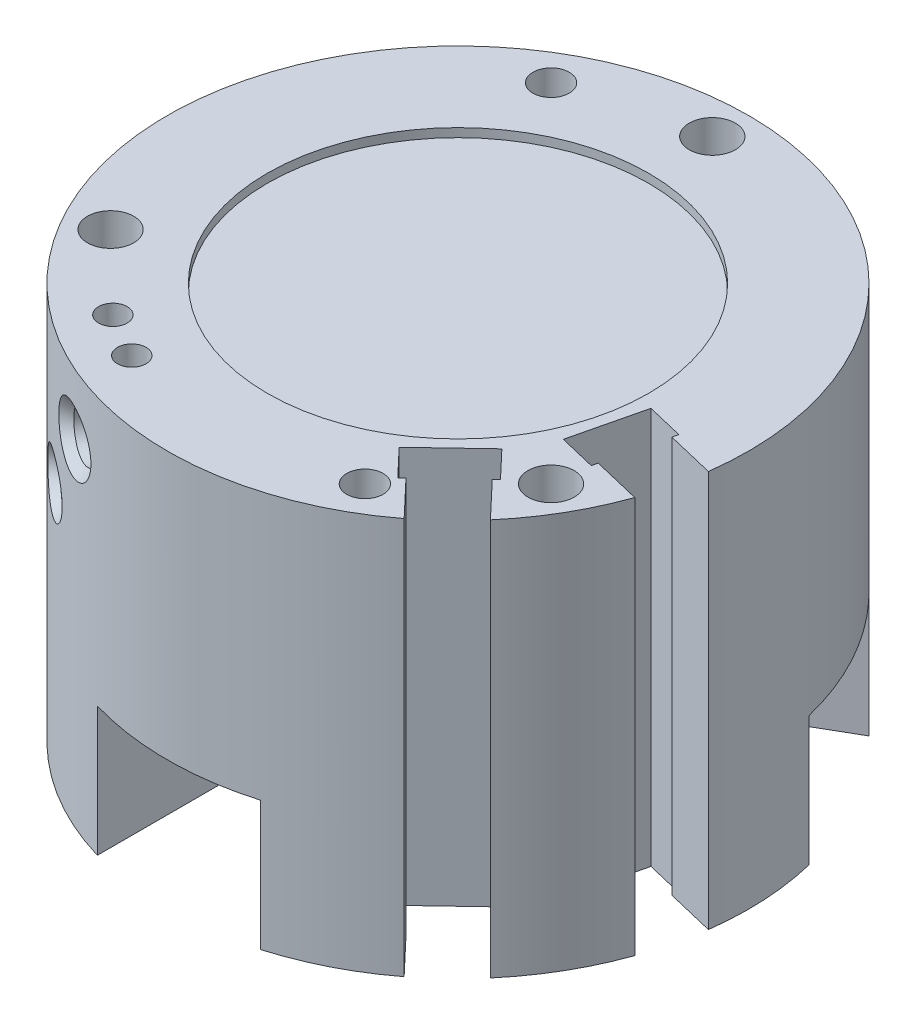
ISO-10303-21;
HEADER;
FILE_DESCRIPTION(('STEP AP214'),'2;1');
FILE_NAME('part.step','',(''),(''),'','','');
FILE_SCHEMA(('AUTOMOTIVE_DESIGN { 1 0 10303 214 1 1 1 1 }'));
ENDSEC;
DATA;
#1=APPLICATION_CONTEXT('core data for automotive mechanical design processes');
#2=APPLICATION_PROTOCOL_DEFINITION('international standard','automotive_design',2000,#1);
#3=PRODUCT_CONTEXT('',#1,'mechanical');
#4=PRODUCT('Part','Part','',(#3));
#5=PRODUCT_RELATED_PRODUCT_CATEGORY('part','',(#4));
#6=PRODUCT_DEFINITION_FORMATION('','',#4);
#7=PRODUCT_DEFINITION_CONTEXT('part definition',#1,'design');
#8=PRODUCT_DEFINITION('design','',#6,#7);
#9=PRODUCT_DEFINITION_SHAPE('','',#8);
#10=(LENGTH_UNIT() NAMED_UNIT(*) SI_UNIT(.MILLI.,.METRE.));
#11=(NAMED_UNIT(*) PLANE_ANGLE_UNIT() SI_UNIT($,.RADIAN.));
#12=(NAMED_UNIT(*) SI_UNIT($,.STERADIAN.) SOLID_ANGLE_UNIT());
#13=UNCERTAINTY_MEASURE_WITH_UNIT(LENGTH_MEASURE(1.E-05),#10,'distance_accuracy_value','');
#14=(GEOMETRIC_REPRESENTATION_CONTEXT(3) GLOBAL_UNCERTAINTY_ASSIGNED_CONTEXT((#13)) GLOBAL_UNIT_ASSIGNED_CONTEXT((#10,
#11,#12)) REPRESENTATION_CONTEXT('',''));
#15=CARTESIAN_POINT('',(0.,0.,0.));
#16=DIRECTION('',(0.,0.,1.));
#17=DIRECTION('',(1.,0.,0.));
#18=AXIS2_PLACEMENT_3D('',#15,#16,#17);
#19=CARTESIAN_POINT('',(0.,-17.3355,0.));
#20=DIRECTION('',(0.,1.,0.));
#21=DIRECTION('',(0.,0.,1.));
#22=AXIS2_PLACEMENT_3D('',#19,#20,#21);
#23=PLANE('',#22);
#24=CARTESIAN_POINT('',(0.,-17.3355,0.));
#25=DIRECTION('',(0.,1.,0.));
#26=DIRECTION('',(0.,0.,1.));
#27=AXIS2_PLACEMENT_3D('',#24,#25,#26);
#28=CIRCLE('',#27,25.4);
#29=CARTESIAN_POINT('',(7.13739999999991,-17.3355,24.3765773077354));
#30=VERTEX_POINT('',#29);
#31=CARTESIAN_POINT('',(15.4529839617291,-17.3355,20.1585040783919));
#32=VERTEX_POINT('',#31);
#33=EDGE_CURVE('E472',#30,#32,#28,.T.);
#34=ORIENTED_EDGE('',*,*,#33,.F.);
#35=DIRECTION('',(0.,0.,1.));
#36=VECTOR('',#35,1.);
#37=CARTESIAN_POINT('',(7.13739999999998,-17.3355,4.12077981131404));
#38=LINE('',#37,#36);
#39=CARTESIAN_POINT('',(7.13739999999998,-17.3355,4.12077981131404));
#40=VERTEX_POINT('',#39);
#41=EDGE_CURVE('E251',#40,#30,#38,.T.);
#42=ORIENTED_EDGE('',*,*,#41,.F.);
#43=DIRECTION('',(-0.866025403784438,0.,0.500000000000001));
#44=VECTOR('',#43,1.);
#45=CARTESIAN_POINT('',(7.13739999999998,-17.3355,4.12077981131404));
#46=LINE('',#45,#44);
#47=CARTESIAN_POINT('',(24.6794352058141,-17.3355,-6.00711893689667));
#48=VERTEX_POINT('',#47);
#49=EDGE_CURVE('E253',#48,#40,#46,.T.);
#50=ORIENTED_EDGE('',*,*,#49,.F.);
#51=CARTESIAN_POINT('',(25.1842686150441,-17.3355,3.303424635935));
#52=VERTEX_POINT('',#51);
#53=EDGE_CURVE('E481',#52,#48,#28,.T.);
#54=ORIENTED_EDGE('',*,*,#53,.F.);
#55=DIRECTION('',(-0.972369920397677,0.,-0.233445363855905));
#56=VECTOR('',#55,1.);
#57=CARTESIAN_POINT('',(20.985575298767,-17.3355,2.29540755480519));
#58=LINE('',#57,#56);
#59=CARTESIAN_POINT('',(20.985575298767,-17.3355,2.29540755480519));
#60=VERTEX_POINT('',#59);
#61=EDGE_CURVE('E308',#52,#60,#58,.T.);
#62=ORIENTED_EDGE('',*,*,#61,.T.);
#63=DIRECTION('',(0.233445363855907,0.,-0.972369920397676));
#64=VECTOR('',#63,1.);
#65=CARTESIAN_POINT('',(21.1041655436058,-17.3355,1.80144363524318));
#66=LINE('',#65,#64);
#67=CARTESIAN_POINT('',(21.1041655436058,-17.3355,1.80144363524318));
#68=VERTEX_POINT('',#67);
#69=EDGE_CURVE('E311',#60,#68,#66,.T.);
#70=ORIENTED_EDGE('',*,*,#69,.T.);
#71=DIRECTION('',(-0.972369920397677,0.,-0.233445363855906));
#72=VECTOR('',#71,1.);
#73=CARTESIAN_POINT('',(17.8934000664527,-17.3355,1.03060704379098));
#74=LINE('',#73,#72);
#75=CARTESIAN_POINT('',(17.8934000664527,-17.3355,1.03060704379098));
#76=VERTEX_POINT('',#75);
#77=EDGE_CURVE('E314',#68,#76,#74,.T.);
#78=ORIENTED_EDGE('',*,*,#77,.T.);
#79=DIRECTION('',(-0.233445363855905,0.,0.972369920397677));
#80=VECTOR('',#79,1.);
#81=CARTESIAN_POINT('',(16.4110220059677,-17.3355,7.20515603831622));
#82=LINE('',#81,#80);
#83=CARTESIAN_POINT('',(16.4110220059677,-17.3355,7.20515603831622));
#84=VERTEX_POINT('',#83);
#85=EDGE_CURVE('E317',#76,#84,#82,.T.);
#86=ORIENTED_EDGE('',*,*,#85,.T.);
#87=DIRECTION('',(0.972369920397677,0.,0.233445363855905));
#88=VECTOR('',#87,1.);
#89=CARTESIAN_POINT('',(19.6217874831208,-17.3355,7.97599262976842));
#90=LINE('',#89,#88);
#91=CARTESIAN_POINT('',(19.6217874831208,-17.3355,7.97599262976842));
#92=VERTEX_POINT('',#91);
#93=EDGE_CURVE('E300',#84,#92,#90,.T.);
#94=ORIENTED_EDGE('',*,*,#93,.T.);
#95=DIRECTION('',(0.233445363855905,0.,-0.972369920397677));
#96=VECTOR('',#95,1.);
#97=CARTESIAN_POINT('',(19.7403777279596,-17.3355,7.4820287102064));
#98=LINE('',#97,#96);
#99=CARTESIAN_POINT('',(19.7403777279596,-17.3355,7.4820287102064));
#100=VERTEX_POINT('',#99);
#101=EDGE_CURVE('E303',#92,#100,#98,.T.);
#102=ORIENTED_EDGE('',*,*,#101,.T.);
#103=DIRECTION('',(0.972369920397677,0.,0.233445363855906));
#104=VECTOR('',#103,1.);
#105=CARTESIAN_POINT('',(23.9390710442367,-17.3355,8.49004579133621));
#106=LINE('',#105,#104);
#107=CARTESIAN_POINT('',(23.9390710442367,-17.3355,8.49004579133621));
#108=VERTEX_POINT('',#107);
#109=EDGE_CURVE('E65',#100,#108,#106,.T.);
#110=ORIENTED_EDGE('',*,*,#109,.T.);
#111=CARTESIAN_POINT('',(19.3221308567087,-17.3355,16.4868207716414));
#112=VERTEX_POINT('',#111);
#113=EDGE_CURVE('E478',#112,#108,#28,.T.);
#114=ORIENTED_EDGE('',*,*,#113,.F.);
#115=DIRECTION('',(-0.688354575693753,0.,-0.725374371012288));
#116=VECTOR('',#115,1.);
#117=CARTESIAN_POINT('',(16.349815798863,-17.3355,13.3546542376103));
#118=LINE('',#117,#116);
#119=CARTESIAN_POINT('',(16.349815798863,-17.3355,13.3546542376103));
#120=VERTEX_POINT('',#119);
#121=EDGE_CURVE('E366',#112,#120,#118,.T.);
#122=ORIENTED_EDGE('',*,*,#121,.T.);
#123=DIRECTION('',(0.72537437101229,0.,-0.688354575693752));
#124=VECTOR('',#123,1.);
#125=CARTESIAN_POINT('',(16.7183059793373,-17.3355,13.0049701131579));
#126=LINE('',#125,#124);
#127=CARTESIAN_POINT('',(16.7183059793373,-17.3355,13.0049701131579));
#128=VERTEX_POINT('',#127);
#129=EDGE_CURVE('E369',#120,#128,#126,.T.);
#130=ORIENTED_EDGE('',*,*,#129,.T.);
#131=DIRECTION('',(-0.688354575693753,0.,-0.725374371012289));
#132=VECTOR('',#131,1.);
#133=CARTESIAN_POINT('',(14.4453591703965,-17.3355,10.6097839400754));
#134=LINE('',#133,#132);
#135=CARTESIAN_POINT('',(14.4453591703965,-17.3355,10.6097839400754));
#136=VERTEX_POINT('',#135);
#137=EDGE_CURVE('E372',#128,#136,#134,.T.);
#138=ORIENTED_EDGE('',*,*,#137,.T.);
#139=DIRECTION('',(-0.725374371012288,0.,0.688354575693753));
#140=VECTOR('',#139,1.);
#141=CARTESIAN_POINT('',(9.83923191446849,-17.3355,14.9808354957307));
#142=LINE('',#141,#140);
#143=CARTESIAN_POINT('',(9.83923191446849,-17.3355,14.9808354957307));
#144=VERTEX_POINT('',#143);
#145=EDGE_CURVE('E375',#136,#144,#142,.T.);
#146=ORIENTED_EDGE('',*,*,#145,.T.);
#147=DIRECTION('',(0.688354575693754,0.,0.725374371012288));
#148=VECTOR('',#147,1.);
#149=CARTESIAN_POINT('',(12.1121787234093,-17.3355,17.3760216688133));
#150=LINE('',#149,#148);
#151=CARTESIAN_POINT('',(12.1121787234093,-17.3355,17.3760216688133));
#152=VERTEX_POINT('',#151);
#153=EDGE_CURVE('E356',#144,#152,#150,.T.);
#154=ORIENTED_EDGE('',*,*,#153,.T.);
#155=DIRECTION('',(0.725374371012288,0.,-0.688354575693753));
#156=VECTOR('',#155,1.);
#157=CARTESIAN_POINT('',(12.4806689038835,-17.3355,17.0263375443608));
#158=LINE('',#157,#156);
#159=CARTESIAN_POINT('',(12.4806689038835,-17.3355,17.0263375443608));
#160=VERTEX_POINT('',#159);
#161=EDGE_CURVE('E359',#152,#160,#158,.T.);
#162=ORIENTED_EDGE('',*,*,#161,.T.);
#163=DIRECTION('',(0.688354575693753,0.,0.725374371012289));
#164=VECTOR('',#163,1.);
#165=CARTESIAN_POINT('',(15.4529839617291,-17.3355,20.1585040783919));
#166=LINE('',#165,#164);
#167=EDGE_CURVE('E363',#160,#32,#166,.T.);
#168=ORIENTED_EDGE('',*,*,#167,.T.);
#169=EDGE_LOOP('',(#34,#42,#50,#54,#62,#70,#78,#86,#94,#102,#110,#114,#122,#130,#138,#146,#154,
#162,#168));
#170=FACE_BOUND('',#169,.T.);
#171=ADVANCED_FACE('F37',(#170),#23,.F.);
#172=CARTESIAN_POINT('',(17.5420352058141,-17.3355,-18.3694583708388));
#173=VERTEX_POINT('',#172);
#174=CARTESIAN_POINT('',(-17.5420352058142,-17.3355,-18.3694583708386));
#175=VERTEX_POINT('',#174);
#176=EDGE_CURVE('E631',#173,#175,#28,.T.);
#177=ORIENTED_EDGE('',*,*,#176,.F.);
#178=DIRECTION('',(0.866025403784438,0.,-0.500000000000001));
#179=VECTOR('',#178,1.);
#180=CARTESIAN_POINT('',(0.,-17.3355,-8.24155962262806));
#181=LINE('',#180,#179);
#182=CARTESIAN_POINT('',(0.,-17.3355,-8.24155962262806));
#183=VERTEX_POINT('',#182);
#184=EDGE_CURVE('E278',#183,#173,#181,.T.);
#185=ORIENTED_EDGE('',*,*,#184,.F.);
#186=DIRECTION('',(0.866025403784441,0.,0.499999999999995));
#187=VECTOR('',#186,1.);
#188=CARTESIAN_POINT('',(0.,-17.3355,-8.24155962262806));
#189=LINE('',#188,#187);
#190=EDGE_CURVE('E275',#175,#183,#189,.T.);
#191=ORIENTED_EDGE('',*,*,#190,.F.);
#192=EDGE_LOOP('',(#177,#185,#191));
#193=FACE_BOUND('',#192,.T.);
#194=ADVANCED_FACE('F615',(#193),#23,.F.);
#195=CARTESIAN_POINT('',(0.,17.3355,0.));
#196=DIRECTION('',(0.,-1.,0.));
#197=DIRECTION('',(0.,0.,-1.));
#198=AXIS2_PLACEMENT_3D('',#195,#196,#197);
#199=CYLINDRICAL_SURFACE('',#198,25.4);
#200=CARTESIAN_POINT('',(-24.6794352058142,-17.3355,-6.0071189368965));
#201=VERTEX_POINT('',#200);
#202=CARTESIAN_POINT('',(-7.13740000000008,-17.3355,24.3765773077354));
#203=VERTEX_POINT('',#202);
#204=EDGE_CURVE('E629',#201,#203,#28,.T.);
#205=ORIENTED_EDGE('',*,*,#204,.T.);
#206=DIRECTION('',(0.,-1.,0.));
#207=VECTOR('',#206,1.);
#208=CARTESIAN_POINT('',(-7.13740000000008,-6.0325,24.3765773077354));
#209=LINE('',#208,#207);
#210=CARTESIAN_POINT('',(-7.13740000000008,-6.0325,24.3765773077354));
#211=VERTEX_POINT('',#210);
#212=EDGE_CURVE('E282',#211,#203,#209,.T.);
#213=ORIENTED_EDGE('',*,*,#212,.F.);
#214=CARTESIAN_POINT('',(0.,-6.0325,0.));
#215=DIRECTION('',(0.,-1.,0.));
#216=DIRECTION('',(0.,0.,-1.));
#217=AXIS2_PLACEMENT_3D('',#214,#215,#216);
#218=CIRCLE('',#217,25.4);
#219=CARTESIAN_POINT('',(7.13739999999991,-6.0325,24.3765773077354));
#220=VERTEX_POINT('',#219);
#221=EDGE_CURVE('E236',#220,#211,#218,.T.);
#222=ORIENTED_EDGE('',*,*,#221,.F.);
#223=DIRECTION('',(0.,-1.,0.));
#224=VECTOR('',#223,1.);
#225=CARTESIAN_POINT('',(7.13739999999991,-6.0325,24.3765773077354));
#226=LINE('',#225,#224);
#227=EDGE_CURVE('E285',#220,#30,#226,.T.);
#228=ORIENTED_EDGE('',*,*,#227,.T.);
#229=ORIENTED_EDGE('',*,*,#33,.T.);
#230=DIRECTION('',(0.,1.,0.));
#231=VECTOR('',#230,1.);
#232=CARTESIAN_POINT('',(15.4529839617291,-17.3355,20.1585040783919));
#233=LINE('',#232,#231);
#234=CARTESIAN_POINT('',(15.4529839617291,17.3355,20.1585040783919));
#235=VERTEX_POINT('',#234);
#236=EDGE_CURVE('E409',#32,#235,#233,.T.);
#237=ORIENTED_EDGE('',*,*,#236,.T.);
#238=CARTESIAN_POINT('',(0.,17.3355,0.));
#239=DIRECTION('',(0.,1.,0.));
#240=DIRECTION('',(0.,0.,1.));
#241=AXIS2_PLACEMENT_3D('',#238,#239,#240);
#242=CIRCLE('',#241,25.4);
#243=CARTESIAN_POINT('',(25.1842686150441,17.3355,3.303424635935));
#244=VERTEX_POINT('',#243);
#245=EDGE_CURVE('E477',#244,#235,#242,.T.);
#246=ORIENTED_EDGE('',*,*,#245,.F.);
#247=DIRECTION('',(0.,1.,0.));
#248=VECTOR('',#247,1.);
#249=CARTESIAN_POINT('',(25.1842686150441,-17.3355,3.303424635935));
#250=LINE('',#249,#248);
#251=EDGE_CURVE('E348',#52,#244,#250,.T.);
#252=ORIENTED_EDGE('',*,*,#251,.F.);
#253=ORIENTED_EDGE('',*,*,#53,.T.);
#254=DIRECTION('',(0.,-1.,0.));
#255=VECTOR('',#254,1.);
#256=CARTESIAN_POINT('',(24.6794352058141,-6.0325,-6.00711893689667));
#257=LINE('',#256,#255);
#258=CARTESIAN_POINT('',(24.6794352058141,-6.0325,-6.00711893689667));
#259=VERTEX_POINT('',#258);
#260=EDGE_CURVE('E290',#259,#48,#257,.T.);
#261=ORIENTED_EDGE('',*,*,#260,.F.);
#262=CARTESIAN_POINT('',(0.,-6.0325,0.));
#263=DIRECTION('',(0.,-1.,0.));
#264=DIRECTION('',(0.,0.,-1.));
#265=AXIS2_PLACEMENT_3D('',#262,#263,#264);
#266=CIRCLE('',#265,25.4);
#267=CARTESIAN_POINT('',(17.5420352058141,-6.0325,-18.3694583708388));
#268=VERTEX_POINT('',#267);
#269=EDGE_CURVE('E263',#268,#259,#266,.T.);
#270=ORIENTED_EDGE('',*,*,#269,.F.);
#271=DIRECTION('',(0.,-1.,0.));
#272=VECTOR('',#271,1.);
#273=CARTESIAN_POINT('',(17.5420352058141,-6.0325,-18.3694583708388));
#274=LINE('',#273,#272);
#275=EDGE_CURVE('E292',#268,#173,#274,.T.);
#276=ORIENTED_EDGE('',*,*,#275,.T.);
#277=ORIENTED_EDGE('',*,*,#176,.T.);
#278=DIRECTION('',(0.,-1.,0.));
#279=VECTOR('',#278,1.);
#280=CARTESIAN_POINT('',(-17.5420352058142,-6.0325,-18.3694583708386));
#281=LINE('',#280,#279);
#282=CARTESIAN_POINT('',(-17.5420352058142,-6.0325,-18.3694583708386));
#283=VERTEX_POINT('',#282);
#284=EDGE_CURVE('E297',#283,#175,#281,.T.);
#285=ORIENTED_EDGE('',*,*,#284,.F.);
#286=CARTESIAN_POINT('',(0.,-6.0325,0.));
#287=DIRECTION('',(0.,-1.,0.));
#288=DIRECTION('',(0.,0.,-1.));
#289=AXIS2_PLACEMENT_3D('',#286,#287,#288);
#290=CIRCLE('',#289,25.4);
#291=CARTESIAN_POINT('',(-24.6794352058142,-6.0325,-6.0071189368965));
#292=VERTEX_POINT('',#291);
#293=EDGE_CURVE('E245',#292,#283,#290,.T.);
#294=ORIENTED_EDGE('',*,*,#293,.F.);
#295=DIRECTION('',(0.,-1.,0.));
#296=VECTOR('',#295,1.);
#297=CARTESIAN_POINT('',(-24.6794352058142,-6.0325,-6.0071189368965));
#298=LINE('',#297,#296);
#299=EDGE_CURVE('E235',#292,#201,#298,.T.);
#300=ORIENTED_EDGE('',*,*,#299,.T.);
#301=EDGE_LOOP('',(#205,#213,#222,#228,#229,#237,#246,#252,#253,#261,#270,#276,#277,#285,#294,#300));
#302=FACE_BOUND('',#301,.T.);
#303=CARTESIAN_POINT('',(-12.45114733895,5.2705,22.1388556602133));
#304=CARTESIAN_POINT('',(-12.4511209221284,5.3121178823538,22.138871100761));
#305=CARTESIAN_POINT('',(-12.4520586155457,5.35373478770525,22.1383550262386));
#306=CARTESIAN_POINT('',(-12.4558249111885,5.43682734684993,22.1362703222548));
#307=CARTESIAN_POINT('',(-12.4586521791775,5.47830307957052,22.1347024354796));
#308=CARTESIAN_POINT('',(-12.4661594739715,5.56102306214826,22.1305250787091));
#309=CARTESIAN_POINT('',(-12.4708390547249,5.60226736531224,22.1279158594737));
#310=CARTESIAN_POINT('',(-12.4820120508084,5.68443563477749,22.1216672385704));
#311=CARTESIAN_POINT('',(-12.4885056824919,5.72535956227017,22.1180277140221));
#312=CARTESIAN_POINT('',(-12.5032683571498,5.80679793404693,22.1097296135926));
#313=CARTESIAN_POINT('',(-12.5115380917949,5.84731221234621,22.1050706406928));
#314=CARTESIAN_POINT('',(-12.5298146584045,5.92784225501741,22.0947447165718));
#315=CARTESIAN_POINT('',(-12.5398225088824,5.96785771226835,22.0890771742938));
#316=CARTESIAN_POINT('',(-12.5615371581,6.04730106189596,22.0767450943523));
#317=CARTESIAN_POINT('',(-12.5732451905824,6.08672850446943,22.0700798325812));
#318=CARTESIAN_POINT('',(-12.5983221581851,6.16490677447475,22.0557632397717));
#319=CARTESIAN_POINT('',(-12.6116924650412,6.20365701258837,22.0481110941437));
#320=CARTESIAN_POINT('',(-12.6400560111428,6.28039181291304,22.0318316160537));
#321=CARTESIAN_POINT('',(-12.6550507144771,6.3183756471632,22.0232034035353));
#322=CARTESIAN_POINT('',(-12.6866251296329,6.39348857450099,22.0049826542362));
#323=CARTESIAN_POINT('',(-12.7032063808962,6.43061679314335,21.9953891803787));
#324=CARTESIAN_POINT('',(-12.7379159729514,6.50392943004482,21.9752487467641));
#325=CARTESIAN_POINT('',(-12.7560459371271,6.54011280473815,21.9647007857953));
#326=CARTESIAN_POINT('',(-12.7938150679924,6.61144671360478,21.942662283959));
#327=CARTESIAN_POINT('',(-12.8134559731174,6.64659599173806,21.9311706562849));
#328=CARTESIAN_POINT('',(-12.8542089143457,6.71577272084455,21.9072555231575));
#329=CARTESIAN_POINT('',(-12.8753228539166,6.7497986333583,21.8948308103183));
#330=CARTESIAN_POINT('',(-12.9189843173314,6.81663967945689,21.8690610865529));
#331=CARTESIAN_POINT('',(-12.941533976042,6.84945288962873,21.855714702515));
#332=CARTESIAN_POINT('',(-12.9880271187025,6.91377982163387,21.8281101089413));
#333=CARTESIAN_POINT('',(-13.0119730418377,6.9452910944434,21.8138502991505));
#334=CARTESIAN_POINT('',(-13.0612269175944,7.0069250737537,21.7844391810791));
#335=CARTESIAN_POINT('',(-13.08653771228,7.03704461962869,21.7692860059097));
#336=CARTESIAN_POINT('',(-13.1384276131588,7.09577224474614,21.7380834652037));
#337=CARTESIAN_POINT('',(-13.165008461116,7.12437812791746,21.7220328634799));
#338=CARTESIAN_POINT('',(-13.2193033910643,7.18000480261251,21.6890599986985));
#339=CARTESIAN_POINT('',(-13.2470181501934,7.20702462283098,21.672137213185));
#340=CARTESIAN_POINT('',(-13.3035043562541,7.25944252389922,21.6374719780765));
#341=CARTESIAN_POINT('',(-13.3322767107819,7.28483915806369,21.6197288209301));
#342=CARTESIAN_POINT('',(-13.3907936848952,7.33397436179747,21.5834628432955));
#343=CARTESIAN_POINT('',(-13.4205392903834,7.35771116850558,21.5649392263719));
#344=CARTESIAN_POINT('',(-13.4809206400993,7.4034900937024,21.5271554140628));
#345=CARTESIAN_POINT('',(-13.5115573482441,7.42553027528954,21.5078944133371));
#346=CARTESIAN_POINT('',(-13.5736382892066,7.46787921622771,21.4686779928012));
#347=CARTESIAN_POINT('',(-13.605083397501,7.4881859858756,21.4487218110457));
#348=CARTESIAN_POINT('',(-13.6686987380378,7.52703123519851,21.408157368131));
#349=CARTESIAN_POINT('',(-13.7008697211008,7.54556776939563,21.3875484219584));
#350=CARTESIAN_POINT('',(-13.7658543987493,7.58083558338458,21.3457206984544));
#351=CARTESIAN_POINT('',(-13.7986687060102,7.59756503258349,21.3245013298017));
#352=CARTESIAN_POINT('',(-13.8648576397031,7.6291816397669,21.2814950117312));
#353=CARTESIAN_POINT('',(-13.8982327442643,7.64406712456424,21.2597075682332));
#354=CARTESIAN_POINT('',(-13.9654608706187,7.67195872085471,21.2156073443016));
#355=CARTESIAN_POINT('',(-13.9993142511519,7.68496332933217,21.1932941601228));
#356=CARTESIAN_POINT('',(-14.0674165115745,7.70905608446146,21.1481847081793));
#357=CARTESIAN_POINT('',(-14.1016656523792,7.72014287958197,21.1253881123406));
#358=CARTESIAN_POINT('',(-14.1704769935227,7.74036291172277,21.0793541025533));
#359=CARTESIAN_POINT('',(-14.2050393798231,7.74949489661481,21.0561164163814));
#360=CARTESIAN_POINT('',(-14.2743947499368,7.76576836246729,21.0092425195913));
#361=CARTESIAN_POINT('',(-14.3091878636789,7.77290860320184,20.9856060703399));
#362=CARTESIAN_POINT('',(-14.3789222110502,7.78516135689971,20.9379769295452));
#363=CARTESIAN_POINT('',(-14.4138635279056,7.79027251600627,20.913984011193));
#364=CARTESIAN_POINT('',(-14.4838117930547,7.79843137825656,20.8656843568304));
#365=CARTESIAN_POINT('',(-14.5188187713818,7.80147744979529,20.8413773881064));
#366=CARTESIAN_POINT('',(-14.5888158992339,7.80546546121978,20.7924916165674));
#367=CARTESIAN_POINT('',(-14.6238059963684,7.8064052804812,20.7679125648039));
#368=CARTESIAN_POINT('',(-14.6936398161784,7.80615960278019,20.7185595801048));
#369=CARTESIAN_POINT('',(-14.7284835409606,7.80497413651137,20.6937856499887));
#370=CARTESIAN_POINT('',(-14.7979120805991,7.80052568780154,20.6441387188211));
#371=CARTESIAN_POINT('',(-14.8324971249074,7.79726484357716,20.6192658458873));
#372=CARTESIAN_POINT('',(-14.9013432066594,7.78869968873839,20.5694824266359));
#373=CARTESIAN_POINT('',(-14.93560448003,7.78339700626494,20.5445719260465));
#374=CARTESIAN_POINT('',(-15.0037380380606,7.77078708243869,20.494774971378));
#375=CARTESIAN_POINT('',(-15.0376105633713,7.76348115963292,20.4698885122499));
#376=CARTESIAN_POINT('',(-15.1049016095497,7.7469020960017,20.4202012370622));
#377=CARTESIAN_POINT('',(-15.1383203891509,7.73763013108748,20.3954003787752));
#378=CARTESIAN_POINT('',(-15.2046389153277,7.71715652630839,20.3459459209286));
#379=CARTESIAN_POINT('',(-15.2375389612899,7.70595604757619,20.3212922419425));
#380=CARTESIAN_POINT('',(-15.3027549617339,7.68166273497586,20.2721937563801));
#381=CARTESIAN_POINT('',(-15.3350712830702,7.66857113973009,20.2477488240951));
#382=CARTESIAN_POINT('',(-15.3990547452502,7.64053285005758,20.199129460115));
#383=CARTESIAN_POINT('',(-15.4307223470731,7.62558753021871,20.174954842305));
#384=CARTESIAN_POINT('',(-15.4933432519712,7.59387898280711,20.1269377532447));
#385=CARTESIAN_POINT('',(-15.524297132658,7.57711729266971,20.103095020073));
#386=CARTESIAN_POINT('',(-15.5854254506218,7.54181317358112,20.0558033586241));
#387=CARTESIAN_POINT('',(-15.6156005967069,7.52327244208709,20.032354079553));
#388=CARTESIAN_POINT('',(-15.6751062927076,7.48444740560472,19.9859110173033));
#389=CARTESIAN_POINT('',(-15.7044376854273,7.46416492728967,19.9629167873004));
#390=CARTESIAN_POINT('',(-15.7621906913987,7.42189361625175,19.9174454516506));
#391=CARTESIAN_POINT('',(-15.7906132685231,7.39990668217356,19.8949678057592));
#392=CARTESIAN_POINT('',(-15.8464835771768,7.35426364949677,19.8505915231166));
#393=CARTESIAN_POINT('',(-15.8739323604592,7.33060943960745,19.8286922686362));
#394=CARTESIAN_POINT('',(-15.927789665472,7.28166944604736,19.7855336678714));
#395=CARTESIAN_POINT('',(-15.9541992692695,7.25638543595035,19.764273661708));
#396=CARTESIAN_POINT('',(-16.005914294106,7.20422234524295,19.7224580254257));
#397=CARTESIAN_POINT('',(-16.0312207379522,7.17734479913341,19.7019017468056));
#398=CARTESIAN_POINT('',(-16.0806602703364,7.12203570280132,19.6615445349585));
#399=CARTESIAN_POINT('',(-16.1047942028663,7.09360530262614,19.6417430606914));
#400=CARTESIAN_POINT('',(-16.1518157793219,7.03524470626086,19.6030160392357));
#401=CARTESIAN_POINT('',(-16.1747051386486,7.00531668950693,19.5840892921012));
#402=CARTESIAN_POINT('',(-16.2192004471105,6.94406247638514,19.5472083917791));
#403=CARTESIAN_POINT('',(-16.2408089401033,6.912739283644,19.5292523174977));
#404=CARTESIAN_POINT('',(-16.2827122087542,6.84878568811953,19.4943374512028));
#405=CARTESIAN_POINT('',(-16.3030092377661,6.81615769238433,19.4773769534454));
#406=CARTESIAN_POINT('',(-16.3422644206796,6.74968094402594,19.4444914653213));
#407=CARTESIAN_POINT('',(-16.3612245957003,6.71583415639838,19.4285649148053));
#408=CARTESIAN_POINT('',(-16.3977794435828,6.64700729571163,19.3977819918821));
#409=CARTESIAN_POINT('',(-16.4153759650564,6.61202885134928,19.3829241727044));
#410=CARTESIAN_POINT('',(-16.4491771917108,6.54102573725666,19.3543143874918));
#411=CARTESIAN_POINT('',(-16.4653836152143,6.50500243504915,19.3405610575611));
#412=CARTESIAN_POINT('',(-16.4963781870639,6.43199667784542,19.3141957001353));
#413=CARTESIAN_POINT('',(-16.5111679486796,6.39501537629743,19.3015823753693));
#414=CARTESIAN_POINT('',(-16.5393027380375,6.32018062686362,19.2775325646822));
#415=CARTESIAN_POINT('',(-16.5526492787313,6.28232814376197,19.2660948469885));
#416=CARTESIAN_POINT('',(-16.5778711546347,6.20583802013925,19.244431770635));
#417=CARTESIAN_POINT('',(-16.5897478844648,6.16720116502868,19.2342052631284));
#418=CARTESIAN_POINT('',(-16.6120036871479,6.08922927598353,19.2150001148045));
#419=CARTESIAN_POINT('',(-16.6223839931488,6.04989484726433,19.2060204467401));
#420=CARTESIAN_POINT('',(-16.6416205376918,5.97061479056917,19.1893444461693));
#421=CARTESIAN_POINT('',(-16.6504777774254,5.9306695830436,19.1816472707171));
#422=CARTESIAN_POINT('',(-16.6666418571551,5.8502549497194,19.1675716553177));
#423=CARTESIAN_POINT('',(-16.673949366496,5.8097857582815,19.1611926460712));
#424=CARTESIAN_POINT('',(-16.6869877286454,5.72841014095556,19.1497886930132));
#425=CARTESIAN_POINT('',(-16.6927187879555,5.68750377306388,19.1447635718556));
#426=CARTESIAN_POINT('',(-16.7025782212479,5.6053407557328,19.1361025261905));
#427=CARTESIAN_POINT('',(-16.7067061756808,5.56408401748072,19.1324669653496));
#428=CARTESIAN_POINT('',(-16.7133331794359,5.48130724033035,19.1266203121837));
#429=CARTESIAN_POINT('',(-16.7158309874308,5.43978702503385,19.1244103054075));
#430=CARTESIAN_POINT('',(-16.7191730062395,5.35656997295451,19.1214487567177));
#431=CARTESIAN_POINT('',(-16.720014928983,5.31487297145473,19.1206992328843));
#432=CARTESIAN_POINT('',(-16.7200157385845,5.23146004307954,19.1206965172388));
#433=CARTESIAN_POINT('',(-16.7191738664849,5.18974411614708,19.121444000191));
#434=CARTESIAN_POINT('',(-16.7158267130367,5.10645488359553,19.1244057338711));
#435=CARTESIAN_POINT('',(-16.7133223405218,5.0648815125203,19.1266191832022));
#436=CARTESIAN_POINT('',(-16.7066801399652,4.9819688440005,19.1324744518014));
#437=CARTESIAN_POINT('',(-16.7025423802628,4.94062953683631,19.1361162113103));
#438=CARTESIAN_POINT('',(-16.6926617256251,4.85827664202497,19.1447910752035));
#439=CARTESIAN_POINT('',(-16.6869182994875,4.81726316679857,19.1498246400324));
#440=CARTESIAN_POINT('',(-16.6738547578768,4.73565345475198,19.1612460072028));
#441=CARTESIAN_POINT('',(-16.6665337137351,4.69505747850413,19.1676346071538));
#442=CARTESIAN_POINT('',(-16.6503430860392,4.61437429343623,19.1817291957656));
#443=CARTESIAN_POINT('',(-16.6414723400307,4.57428749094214,19.18943617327));
#444=CARTESIAN_POINT('',(-16.6222103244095,4.49471419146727,19.2061307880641));
#445=CARTESIAN_POINT('',(-16.6118177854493,4.4552282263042,19.2151194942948));
#446=CARTESIAN_POINT('',(-16.5895400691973,4.37694817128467,19.234340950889));
#447=CARTESIAN_POINT('',(-16.5776536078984,4.3381547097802,19.2445747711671));
#448=CARTESIAN_POINT('',(-16.5524158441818,4.26135126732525,19.2662499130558));
#449=CARTESIAN_POINT('',(-16.5390633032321,4.22334198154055,19.2776922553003));
#450=CARTESIAN_POINT('',(-16.5109211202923,4.14819853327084,19.3017479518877));
#451=CARTESIAN_POINT('',(-16.4961303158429,4.11106510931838,19.3143622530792));
#452=CARTESIAN_POINT('',(-16.4651393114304,4.03776504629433,19.3407253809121));
#453=CARTESIAN_POINT('',(-16.4489380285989,4.00159917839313,19.3544750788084));
#454=CARTESIAN_POINT('',(-16.4151537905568,3.93032593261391,19.3830725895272));
#455=CARTESIAN_POINT('',(-16.3975698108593,3.89521936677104,19.3979212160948));
#456=CARTESIAN_POINT('',(-16.3610478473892,3.82615630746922,19.4286798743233));
#457=CARTESIAN_POINT('',(-16.3421088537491,3.79220070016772,19.4445906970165));
#458=CARTESIAN_POINT('',(-16.3029048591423,3.72553153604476,19.4774380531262));
#459=CARTESIAN_POINT('',(-16.2826387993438,3.69281900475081,19.4943754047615));
#460=CARTESIAN_POINT('',(-16.2408076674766,3.62872629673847,19.5292361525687));
#461=CARTESIAN_POINT('',(-16.2192414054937,3.59734738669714,19.5471604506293));
#462=CARTESIAN_POINT('',(-16.1748409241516,3.5360181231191,19.583970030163));
#463=CARTESIAN_POINT('',(-16.1520052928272,3.50606943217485,19.6028563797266));
#464=CARTESIAN_POINT('',(-16.1050929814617,3.44768744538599,19.6415013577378));
#465=CARTESIAN_POINT('',(-16.0810150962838,3.41925567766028,19.6612608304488));
#466=CARTESIAN_POINT('',(-16.0316821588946,3.36394133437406,19.7015384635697));
#467=CARTESIAN_POINT('',(-16.0064261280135,3.33706008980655,19.7220572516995));
#468=CARTESIAN_POINT('',(-15.9548061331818,3.28488861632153,19.7638027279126));
#469=CARTESIAN_POINT('',(-15.9284410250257,3.25960010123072,19.7850301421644));
#470=CARTESIAN_POINT('',(-15.8746678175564,3.21064991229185,19.8281276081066));
#471=CARTESIAN_POINT('',(-15.8472585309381,3.18699018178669,19.8499983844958));
#472=CARTESIAN_POINT('',(-15.7914628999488,3.14133519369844,19.8943213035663));
#473=CARTESIAN_POINT('',(-15.7630754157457,3.11934198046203,19.9167741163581));
#474=CARTESIAN_POINT('',(-15.705388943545,3.07705734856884,19.9621988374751));
#475=CARTESIAN_POINT('',(-15.6760889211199,3.05676796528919,19.9851713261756));
#476=CARTESIAN_POINT('',(-15.6166429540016,3.01792854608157,20.0315734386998));
#477=CARTESIAN_POINT('',(-15.5864961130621,2.99938045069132,20.055003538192));
#478=CARTESIAN_POINT('',(-15.5254220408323,2.96406121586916,20.1022588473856));
#479=CARTESIAN_POINT('',(-15.4944940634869,2.94729186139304,20.1260844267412));
#480=CARTESIAN_POINT('',(-15.4319232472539,2.9155677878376,20.1740686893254));
#481=CARTESIAN_POINT('',(-15.400279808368,2.90061466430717,20.198227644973));
#482=CARTESIAN_POINT('',(-15.3363436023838,2.87256076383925,20.2468166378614));
#483=CARTESIAN_POINT('',(-15.3040503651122,2.859461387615,20.2712468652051));
#484=CARTESIAN_POINT('',(-15.2388801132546,2.83515270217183,20.3203163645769));
#485=CARTESIAN_POINT('',(-15.2060027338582,2.8239446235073,20.3449557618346));
#486=CARTESIAN_POINT('',(-15.1397297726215,2.80345621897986,20.3943815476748));
#487=CARTESIAN_POINT('',(-15.1063339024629,2.79417701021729,20.4191680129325));
#488=CARTESIAN_POINT('',(-15.0390895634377,2.77758401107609,20.4688258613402));
#489=CARTESIAN_POINT('',(-15.005240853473,2.77027131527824,20.4936972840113));
#490=CARTESIAN_POINT('',(-14.9371564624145,2.75764877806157,20.543462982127));
#491=CARTESIAN_POINT('',(-14.9029205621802,2.7523401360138,20.5683572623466));
#492=CARTESIAN_POINT('',(-14.8341274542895,2.74376352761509,20.618106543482));
#493=CARTESIAN_POINT('',(-14.7995700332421,2.7404970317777,20.6429615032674));
#494=CARTESIAN_POINT('',(-14.7301995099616,2.73604044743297,20.6925702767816));
#495=CARTESIAN_POINT('',(-14.695386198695,2.73485230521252,20.7173239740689));
#496=CARTESIAN_POINT('',(-14.6256106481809,2.73459528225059,20.7666385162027));
#497=CARTESIAN_POINT('',(-14.5906483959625,2.73552659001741,20.7911993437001));
#498=CARTESIAN_POINT('',(-14.5206985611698,2.73948346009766,20.8400554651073));
#499=CARTESIAN_POINT('',(-14.4857110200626,2.74250737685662,20.8643509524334));
#500=CARTESIAN_POINT('',(-14.4157938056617,2.75061239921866,20.9126337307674));
#501=CARTESIAN_POINT('',(-14.3808641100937,2.75569224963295,20.9366212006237));
#502=CARTESIAN_POINT('',(-14.3111458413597,2.76787425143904,20.9842449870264));
#503=CARTESIAN_POINT('',(-14.2763572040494,2.77497534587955,21.0078814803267));
#504=CARTESIAN_POINT('',(-14.2070042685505,2.79116461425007,21.0547604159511));
#505=CARTESIAN_POINT('',(-14.1724398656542,2.80025177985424,21.0780030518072));
#506=CARTESIAN_POINT('',(-14.1036186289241,2.82037825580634,21.1240513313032));
#507=CARTESIAN_POINT('',(-14.0693616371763,2.8314164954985,21.1468572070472));
#508=CARTESIAN_POINT('',(-14.0012384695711,2.85541025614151,21.1919890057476));
#509=CARTESIAN_POINT('',(-13.967372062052,2.86836457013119,21.2143152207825));
#510=CARTESIAN_POINT('',(-13.9001133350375,2.89615569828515,21.2584447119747));
#511=CARTESIAN_POINT('',(-13.8667206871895,2.91099112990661,21.2802483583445));
#512=CARTESIAN_POINT('',(-13.8004927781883,2.94250974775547,21.3232897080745));
#513=CARTESIAN_POINT('',(-13.7676570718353,2.95919136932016,21.3445278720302));
#514=CARTESIAN_POINT('',(-13.7026263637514,2.99436762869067,21.386395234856));
#515=CARTESIAN_POINT('',(-13.6704307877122,3.01286054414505,21.4070249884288));
#516=CARTESIAN_POINT('',(-13.6067636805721,3.05162462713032,21.4476325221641));
#517=CARTESIAN_POINT('',(-13.5752914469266,3.07189396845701,21.4676109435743));
#518=CARTESIAN_POINT('',(-13.5131543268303,3.11417609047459,21.5068727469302));
#519=CARTESIAN_POINT('',(-13.482488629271,3.13618702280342,21.5261568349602));
#520=CARTESIAN_POINT('',(-13.4220479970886,3.18191741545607,21.563987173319));
#521=CARTESIAN_POINT('',(-13.3922721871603,3.20563511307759,21.5825341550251));
#522=CARTESIAN_POINT('',(-13.3336941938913,3.25474408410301,21.6188466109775));
#523=CARTESIAN_POINT('',(-13.3048911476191,3.28013381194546,21.636612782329));
#524=CARTESIAN_POINT('',(-13.2483433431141,3.33255151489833,21.6713234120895));
#525=CARTESIAN_POINT('',(-13.2205978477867,3.35957831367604,21.6882684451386));
#526=CARTESIAN_POINT('',(-13.1662426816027,3.41523559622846,21.7212840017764));
#527=CARTESIAN_POINT('',(-13.1396325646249,3.44386543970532,21.7373548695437));
#528=CARTESIAN_POINT('',(-13.0876869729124,3.50265068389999,21.7685954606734));
#529=CARTESIAN_POINT('',(-13.0623498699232,3.53280403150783,21.7837663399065));
#530=CARTESIAN_POINT('',(-13.0130465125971,3.59450672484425,21.8132106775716));
#531=CARTESIAN_POINT('',(-12.9890773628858,3.62605285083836,21.8274860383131));
#532=CARTESIAN_POINT('',(-12.9425410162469,3.69045109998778,21.8551193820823));
#533=CARTESIAN_POINT('',(-12.9199713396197,3.72330073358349,21.8684789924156));
#534=CARTESIAN_POINT('',(-12.8762721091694,3.7902153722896,21.8942734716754));
#535=CARTESIAN_POINT('',(-12.8551403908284,3.82427842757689,21.9067097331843));
#536=CARTESIAN_POINT('',(-12.814353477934,3.893529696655,21.9306466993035));
#537=CARTESIAN_POINT('',(-12.7946963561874,3.92871635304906,21.9421486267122));
#538=CARTESIAN_POINT('',(-12.7568956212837,4.00012468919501,21.9642069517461));
#539=CARTESIAN_POINT('',(-12.7387502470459,4.03634509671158,21.9747644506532));
#540=CARTESIAN_POINT('',(-12.7040099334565,4.10973091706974,21.9949236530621));
#541=CARTESIAN_POINT('',(-12.6874133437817,4.14689526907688,22.0045263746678));
#542=CARTESIAN_POINT('',(-12.65580761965,4.22207902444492,22.022765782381));
#543=CARTESIAN_POINT('',(-12.6407969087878,4.26009753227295,22.0314034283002));
#544=CARTESIAN_POINT('',(-12.6123999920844,4.33689968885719,22.047702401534));
#545=CARTESIAN_POINT('',(-12.5990122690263,4.37568258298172,22.0553646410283));
#546=CARTESIAN_POINT('',(-12.5738983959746,4.45392362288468,22.0697025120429));
#547=CARTESIAN_POINT('',(-12.562170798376,4.49338114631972,22.0763790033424));
#548=CARTESIAN_POINT('',(-12.5404142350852,4.57288156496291,22.0887350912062));
#549=CARTESIAN_POINT('',(-12.5303839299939,4.61292397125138,22.0944154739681));
#550=CARTESIAN_POINT('',(-12.5120589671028,4.69350426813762,22.1047690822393));
#551=CARTESIAN_POINT('',(-12.5037631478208,4.73404180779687,22.109442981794));
#552=CARTESIAN_POINT('',(-12.4889441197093,4.81552250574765,22.1177733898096));
#553=CARTESIAN_POINT('',(-12.4824200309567,4.85646545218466,22.1214304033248));
#554=CARTESIAN_POINT('',(-12.4711812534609,4.93866700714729,22.127716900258));
#555=CARTESIAN_POINT('',(-12.4664661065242,4.97992553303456,22.1303466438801));
#556=CARTESIAN_POINT('',(-12.458882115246,5.0626686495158,22.1345683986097));
#557=CARTESIAN_POINT('',(-12.4560134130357,5.10415325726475,22.1361603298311));
#558=CARTESIAN_POINT('',(-12.4521580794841,5.18725768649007,22.1382968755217));
#559=CARTESIAN_POINT('',(-12.4511724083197,5.22887756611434,22.1388409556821));
#560=CARTESIAN_POINT('',(-12.45114733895,5.2705,22.1388556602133));
#561=B_SPLINE_CURVE_WITH_KNOTS('',3,(#303,#304,#305,#306,#307,#308,#309,#310,#311,#312,#313,
#314,#315,#316,#317,#318,#319,#320,#321,#322,#323,#324,#325,#326,#327,#328,#329,#330,#331,#332,
#333,#334,#335,#336,#337,#338,#339,#340,#341,#342,#343,#344,#345,#346,#347,#348,#349,#350,#351,
#352,#353,#354,#355,#356,#357,#358,#359,#360,#361,#362,#363,#364,#365,#366,#367,#368,#369,#370,
#371,#372,#373,#374,#375,#376,#377,#378,#379,#380,#381,#382,#383,#384,#385,#386,#387,#388,#389,
#390,#391,#392,#393,#394,#395,#396,#397,#398,#399,#400,#401,#402,#403,#404,#405,#406,#407,#408,
#409,#410,#411,#412,#413,#414,#415,#416,#417,#418,#419,#420,#421,#422,#423,#424,#425,#426,#427,
#428,#429,#430,#431,#432,#433,#434,#435,#436,#437,#438,#439,#440,#441,#442,#443,#444,#445,#446,
#447,#448,#449,#450,#451,#452,#453,#454,#455,#456,#457,#458,#459,#460,#461,#462,#463,#464,#465,
#466,#467,#468,#469,#470,#471,#472,#473,#474,#475,#476,#477,#478,#479,#480,#481,#482,#483,#484,
#485,#486,#487,#488,#489,#490,#491,#492,#493,#494,#495,#496,#497,#498,#499,#500,#501,#502,#503,
#504,#505,#506,#507,#508,#509,#510,#511,#512,#513,#514,#515,#516,#517,#518,#519,#520,#521,#522,
#523,#524,#525,#526,#527,#528,#529,#530,#531,#532,#533,#534,#535,#536,#537,#538,#539,#540,#541,
#542,#543,#544,#545,#546,#547,#548,#549,#550,#551,#552,#553,#554,#555,#556,#557,#558,#559,#560),
.UNSPECIFIED.,.F.,.F.,(4,2,2,2,2,2,2,2,2,2,2,2,2,2,2,2,2,2,2,2,2,2,2,2,2,2,2,2,2,2,2,2,2,2,2,2,
2,2,2,2,2,2,2,2,2,2,2,2,2,2,2,2,2,2,2,2,2,2,2,2,2,2,2,2,2,2,2,2,2,2,2,2,2,2,2,2,2,2,2,2,2,2,2,2,
2,2,2,2,2,2,2,2,2,2,2,2,2,2,2,2,2,2,2,2,2,2,2,2,2,2,2,2,2,2,2,2,2,2,2,2,2,2,2,2,2,2,2,2,4),(0.,
0.124836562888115,0.249585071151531,0.374303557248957,0.499036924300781,0.62381895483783,
0.748674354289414,0.873620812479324,0.998671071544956,1.12383499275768,1.24912161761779,
1.3745412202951,1.50010734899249,1.62583885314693,1.75176189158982,1.87791191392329,
2.00433560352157,2.13093794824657,2.25761703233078,2.38440749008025,2.51133062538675,
2.63839657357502,2.76560646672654,2.89295459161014,3.02043053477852,3.14802131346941,
3.27571349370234,3.40349529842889,3.53135870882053,3.65930156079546,3.78732963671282,
3.91545874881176,4.04371680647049,4.17197301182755,4.3000972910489,4.42811961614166,
4.55605787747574,4.68391983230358,4.81170507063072,4.93940698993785,5.06701477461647,
5.19451537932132,5.32189551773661,5.44914365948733,5.57625203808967,5.70321867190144,
5.83004939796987,5.95675991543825,6.08337783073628,6.20981655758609,6.33599512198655,
6.4619507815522,6.58771174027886,6.71329911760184,6.83872894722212,6.96401419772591,
7.08916680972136,7.2141997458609,7.33912905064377,7.46397591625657,7.58876874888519,
7.71354522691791,7.8383543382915,7.96325837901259,8.0883348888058,8.21346778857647,
8.33853233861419,8.46359165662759,8.58869239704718,8.71386698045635,8.83913586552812,
8.96450984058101,9.08999231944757,9.21558163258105,9.34127330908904,9.46706234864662,
9.59294548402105,9.71892343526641,9.84500315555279,9.97120006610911,10.0975402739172,
10.2240054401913,10.350577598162,10.477283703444,10.6041384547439,10.7311463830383,
10.8583039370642,10.9856015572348,11.1130257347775,11.2405610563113,11.3681922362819,
11.4959061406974,11.6236938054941,11.7515524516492,11.8794874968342,12.0075145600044,
12.135661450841,12.2638197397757,12.3918773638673,12.5198569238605,12.6477696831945,
12.7756176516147,12.9033956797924,13.0310935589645,13.1586981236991,13.2861953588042,
13.4135725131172,13.5408202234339,13.6679346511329,13.7949196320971,13.9217888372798,
14.0485679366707,14.1752967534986,14.3018591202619,14.4281428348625,14.5541959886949,
14.6800549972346,14.8057465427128,14.9312895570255,15.0566972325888,15.1819790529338,
15.3071428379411,15.4321968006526,15.5571516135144,15.6820224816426,15.8068312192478,
15.9316083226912,16.0563950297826,16.1812453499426),.UNSPECIFIED.);
#562=CARTESIAN_POINT('',(-12.45114733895,5.2705,22.1388556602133));
#563=VERTEX_POINT('',#562);
#564=EDGE_CURVE('E476',#563,#563,#561,.F.);
#565=ORIENTED_EDGE('',*,*,#564,.T.);
#566=EDGE_LOOP('',(#565));
#567=FACE_BOUND('',#566,.T.);
#568=CARTESIAN_POINT('',(-7.95418935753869,11.7475,24.1224143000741));
#569=CARTESIAN_POINT('',(-7.95415896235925,11.7928507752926,24.1224250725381));
#570=CARTESIAN_POINT('',(-7.95530267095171,11.8382002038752,24.1220604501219));
#571=CARTESIAN_POINT('',(-7.95989086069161,11.928721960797,24.1205843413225));
#572=CARTESIAN_POINT('',(-7.96333287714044,11.9738944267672,24.1194736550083));
#573=CARTESIAN_POINT('',(-7.9724683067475,12.0639650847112,24.1165100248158));
#574=CARTESIAN_POINT('',(-7.97816069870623,12.1088633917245,24.1146574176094));
#575=CARTESIAN_POINT('',(-7.99174620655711,12.1982903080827,24.110214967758));
#576=CARTESIAN_POINT('',(-7.99963940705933,12.2428189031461,24.1076250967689));
#577=CARTESIAN_POINT('',(-8.0175766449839,12.3314106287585,24.1017129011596));
#578=CARTESIAN_POINT('',(-8.02762158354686,12.3754735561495,24.0983902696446));
#579=CARTESIAN_POINT('',(-8.04981257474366,12.463038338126,24.091017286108));
#580=CARTESIAN_POINT('',(-8.0619601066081,12.5065397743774,24.0869664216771));
#581=CARTESIAN_POINT('',(-8.08830682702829,12.5928859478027,24.0781416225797));
#582=CARTESIAN_POINT('',(-8.10250788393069,12.6357300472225,24.0733670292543));
#583=CARTESIAN_POINT('',(-8.13291237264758,12.720665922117,24.063099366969));
#584=CARTESIAN_POINT('',(-8.14911791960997,12.7627568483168,24.0576055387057));
#585=CARTESIAN_POINT('',(-8.1834822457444,12.8460907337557,24.0459039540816));
#586=CARTESIAN_POINT('',(-8.20164328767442,12.8873326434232,24.0396953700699));
#587=CARTESIAN_POINT('',(-8.23986955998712,12.9688728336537,24.0265687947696));
#588=CARTESIAN_POINT('',(-8.25993714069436,13.009169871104,24.0196499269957));
#589=CARTESIAN_POINT('',(-8.30192748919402,13.088724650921,24.0051072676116));
#590=CARTESIAN_POINT('',(-8.32385266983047,13.1279809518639,23.9974825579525));
#591=CARTESIAN_POINT('',(-8.36950929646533,13.2053585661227,23.9815327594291));
#592=CARTESIAN_POINT('',(-8.39324322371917,13.2434782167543,23.9732067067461));
#593=CARTESIAN_POINT('',(-8.44246820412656,13.3184869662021,23.9558585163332));
#594=CARTESIAN_POINT('',(-8.46796183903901,13.355374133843,23.9468353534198));
#595=CARTESIAN_POINT('',(-8.5206578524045,13.4278220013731,23.9280982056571));
#596=CARTESIAN_POINT('',(-8.54786296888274,13.4633804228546,23.9183831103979));
#597=CARTESIAN_POINT('',(-8.60393055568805,13.5330764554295,23.8982638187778));
#598=CARTESIAN_POINT('',(-8.63279598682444,13.5672113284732,23.8878583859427));
#599=CARTESIAN_POINT('',(-8.6921437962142,13.6339604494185,23.8663735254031));
#600=CARTESIAN_POINT('',(-8.72262946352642,13.666571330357,23.855292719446));
#601=CARTESIAN_POINT('',(-8.78510901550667,13.7301663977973,23.8324321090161));
#602=CARTESIAN_POINT('',(-8.8171052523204,13.7611478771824,23.8206512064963));
#603=CARTESIAN_POINT('',(-8.88245469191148,13.8214304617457,23.7963862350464));
#604=CARTESIAN_POINT('',(-8.91580930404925,13.8507297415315,23.7839014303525));
#605=CARTESIAN_POINT('',(-8.98378941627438,13.9076025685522,23.7582660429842));
#606=CARTESIAN_POINT('',(-9.01841646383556,13.9351738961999,23.7451146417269));
#607=CARTESIAN_POINT('',(-9.08884459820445,13.9885510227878,23.7181698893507));
#608=CARTESIAN_POINT('',(-9.1246472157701,14.0143543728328,23.7043756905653));
#609=CARTESIAN_POINT('',(-9.19733271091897,14.0641540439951,23.6761727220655));
#610=CARTESIAN_POINT('',(-9.2342170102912,14.0881478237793,23.6617631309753));
#611=CARTESIAN_POINT('',(-9.30897138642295,14.1342871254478,23.6323557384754));
#612=CARTESIAN_POINT('',(-9.34684271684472,14.1564301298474,23.6173571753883));
#613=CARTESIAN_POINT('',(-9.42347693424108,14.1988264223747,23.5867984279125));
#614=CARTESIAN_POINT('',(-9.46224087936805,14.2190773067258,23.5712375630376));
#615=CARTESIAN_POINT('',(-9.54056606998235,14.2576478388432,23.5395807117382));
#616=CARTESIAN_POINT('',(-9.58012817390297,14.2759652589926,23.5234841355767));
#617=CARTESIAN_POINT('',(-9.65995544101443,14.3106272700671,23.4907823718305));
#618=CARTESIAN_POINT('',(-9.70022127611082,14.3269698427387,23.4741766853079));
#619=CARTESIAN_POINT('',(-9.78136174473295,14.357640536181,23.4404832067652));
#620=CARTESIAN_POINT('',(-9.82223688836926,14.3719668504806,23.4233949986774));
#621=CARTESIAN_POINT('',(-9.90450168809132,14.398563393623,23.3887629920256));
#622=CARTESIAN_POINT('',(-9.94589172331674,14.4108319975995,23.3712188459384));
#623=CARTESIAN_POINT('',(-10.0290919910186,14.4332715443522,23.335701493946));
#624=CARTESIAN_POINT('',(-10.0709025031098,14.4434409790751,23.317727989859));
#625=CARTESIAN_POINT('',(-10.1548493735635,14.4616405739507,23.28137846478));
#626=CARTESIAN_POINT('',(-10.1969859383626,14.469669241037,23.2630021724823));
#627=CARTESIAN_POINT('',(-10.2814905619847,14.483546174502,23.2258736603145));
#628=CARTESIAN_POINT('',(-10.3238587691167,14.4893928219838,23.2071211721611));
#629=CARTESIAN_POINT('',(-10.4087322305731,14.4988632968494,23.1692667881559));
#630=CARTESIAN_POINT('',(-10.4512375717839,14.5024851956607,23.1501646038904));
#631=CARTESIAN_POINT('',(-10.5362911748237,14.5074693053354,23.1116377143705));
#632=CARTESIAN_POINT('',(-10.5788394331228,14.5088290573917,23.0922126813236));
#633=CARTESIAN_POINT('',(-10.6638243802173,14.509231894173,23.0530929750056));
#634=CARTESIAN_POINT('',(-10.7062610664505,14.508274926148,23.0333982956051));
#635=CARTESIAN_POINT('',(-10.7908774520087,14.5040629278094,22.9938212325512));
#636=CARTESIAN_POINT('',(-10.8330573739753,14.5008103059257,22.9739390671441));
#637=CARTESIAN_POINT('',(-10.9170756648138,14.4920521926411,22.9340436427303));
#638=CARTESIAN_POINT('',(-10.9589142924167,14.4865486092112,22.9140305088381));
#639=CARTESIAN_POINT('',(-11.0421649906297,14.473328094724,22.8739294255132));
#640=CARTESIAN_POINT('',(-11.0835773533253,14.4656128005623,22.8538415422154));
#641=CARTESIAN_POINT('',(-11.1658906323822,14.4480096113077,22.8136472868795));
#642=CARTESIAN_POINT('',(-11.2067918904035,14.4381232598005,22.7935409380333));
#643=CARTESIAN_POINT('',(-11.287998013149,14.4162181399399,22.7533660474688));
#644=CARTESIAN_POINT('',(-11.3283032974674,14.4042009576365,22.7332974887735));
#645=CARTESIAN_POINT('',(-11.4082324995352,14.3780743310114,22.6932544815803));
#646=CARTESIAN_POINT('',(-11.4478569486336,14.363966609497,22.6732799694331));
#647=CARTESIAN_POINT('',(-11.5263394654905,14.3336989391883,22.6334813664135));
#648=CARTESIAN_POINT('',(-11.5651982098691,14.3175409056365,22.6136571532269));
#649=CARTESIAN_POINT('',(-11.6420642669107,14.2832125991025,22.5742154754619));
#650=CARTESIAN_POINT('',(-11.6800724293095,14.2650444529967,22.5545978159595));
#651=CARTESIAN_POINT('',(-11.7551522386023,14.2267358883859,22.5156255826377));
#652=CARTESIAN_POINT('',(-11.7922249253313,14.2065977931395,22.4962707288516));
#653=CARTESIAN_POINT('',(-11.8653486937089,14.1643893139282,22.457880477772));
#654=CARTESIAN_POINT('',(-11.9014010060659,14.1423214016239,22.4388447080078));
#655=CARTESIAN_POINT('',(-11.9723988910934,14.0962933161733,22.4011489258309));
#656=CARTESIAN_POINT('',(-12.0073458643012,14.0723356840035,22.3824884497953));
#657=CARTESIAN_POINT('',(-12.0760481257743,14.0225682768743,22.3455998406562));
#658=CARTESIAN_POINT('',(-12.1098049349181,13.9967610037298,22.3273711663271));
#659=CARTESIAN_POINT('',(-12.1760413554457,13.9433344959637,22.2914016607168));
#660=CARTESIAN_POINT('',(-12.2085225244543,13.9157175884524,22.2736602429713));
#661=CARTESIAN_POINT('',(-12.2721245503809,13.858712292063,22.238724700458));
#662=CARTESIAN_POINT('',(-12.3032468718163,13.8293258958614,22.2215299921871));
#663=CARTESIAN_POINT('',(-12.36403961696,13.7688216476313,22.1877324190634));
#664=CARTESIAN_POINT('',(-12.3937112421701,13.7377052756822,22.1711290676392));
#665=CARTESIAN_POINT('',(-12.451507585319,13.6738229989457,22.1386340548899));
#666=CARTESIAN_POINT('',(-12.479634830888,13.6410599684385,22.1227412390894));
#667=CARTESIAN_POINT('',(-12.5342977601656,13.5740190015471,22.0917642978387));
#668=CARTESIAN_POINT('',(-12.5608372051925,13.5397450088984,22.0766782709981));
#669=CARTESIAN_POINT('',(-12.6122878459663,13.4697783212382,22.04733424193));
#670=CARTESIAN_POINT('',(-12.6372023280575,13.4340887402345,22.0330745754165));
#671=CARTESIAN_POINT('',(-12.6853748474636,13.3613873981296,22.0054174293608));
#672=CARTESIAN_POINT('',(-12.7086357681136,13.3243781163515,21.9920184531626));
#673=CARTESIAN_POINT('',(-12.7534705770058,13.2491335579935,21.9661129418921));
#674=CARTESIAN_POINT('',(-12.7750470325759,13.2109002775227,21.9536050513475));
#675=CARTESIAN_POINT('',(-12.8164828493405,13.1333038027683,21.9295130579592));
#676=CARTESIAN_POINT('',(-12.8363445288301,13.0939422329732,21.9179277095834));
#677=CARTESIAN_POINT('',(-12.8743204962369,13.0141851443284,21.8957118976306));
#678=CARTESIAN_POINT('',(-12.8924369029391,12.9737909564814,21.8850802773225));
#679=CARTESIAN_POINT('',(-12.9268920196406,12.8920645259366,21.8648031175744));
#680=CARTESIAN_POINT('',(-12.9432326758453,12.8507333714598,21.8551564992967));
#681=CARTESIAN_POINT('',(-12.9741059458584,12.7672288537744,21.8368805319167));
#682=CARTESIAN_POINT('',(-12.9886403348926,12.7250563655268,21.8282501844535));
#683=CARTESIAN_POINT('',(-13.0158707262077,12.6399649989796,21.8120379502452));
#684=CARTESIAN_POINT('',(-13.0285683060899,12.5970467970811,21.8044551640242));
#685=CARTESIAN_POINT('',(-13.0520947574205,12.5105598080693,21.7903692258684));
#686=CARTESIAN_POINT('',(-13.0629249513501,12.4669915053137,21.7838653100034));
#687=CARTESIAN_POINT('',(-13.0826863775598,12.3793001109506,21.7719682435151));
#688=CARTESIAN_POINT('',(-13.0916185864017,12.3351773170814,21.7665745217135));
#689=CARTESIAN_POINT('',(-13.1075538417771,12.2464727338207,21.7569289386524));
#690=CARTESIAN_POINT('',(-13.1145573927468,12.2018910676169,21.7526767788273));
#691=CARTESIAN_POINT('',(-13.1266054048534,12.1123645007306,21.7453452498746));
#692=CARTESIAN_POINT('',(-13.1316497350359,12.0674195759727,21.7422659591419));
#693=CARTESIAN_POINT('',(-13.13974899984,11.9772622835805,21.7373113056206));
#694=CARTESIAN_POINT('',(-13.1428029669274,11.9320497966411,21.7354365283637));
#695=CARTESIAN_POINT('',(-13.1468934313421,11.841452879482,21.7329207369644));
#696=CARTESIAN_POINT('',(-13.1479278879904,11.796068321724,21.7322809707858));
#697=CARTESIAN_POINT('',(-13.1479439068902,11.7052772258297,21.7322692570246));
#698=CARTESIAN_POINT('',(-13.1469245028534,11.6598706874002,21.7328979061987));
#699=CARTESIAN_POINT('',(-13.1428554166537,11.5691899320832,21.7353964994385));
#700=CARTESIAN_POINT('',(-13.1398060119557,11.5239156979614,21.7372662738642));
#701=CARTESIAN_POINT('',(-13.1317116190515,11.4336004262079,21.742213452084));
#702=CARTESIAN_POINT('',(-13.1266660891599,11.3885594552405,21.7452911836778));
#703=CARTESIAN_POINT('',(-13.1146117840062,11.2988118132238,21.752621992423));
#704=CARTESIAN_POINT('',(-13.1076019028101,11.2541053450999,21.7568757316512));
#705=CARTESIAN_POINT('',(-13.0916515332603,11.1651276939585,21.7665261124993));
#706=CARTESIAN_POINT('',(-13.0827095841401,11.1208568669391,21.7719236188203));
#707=CARTESIAN_POINT('',(-13.0629273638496,11.0328515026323,21.7838293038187));
#708=CARTESIAN_POINT('',(-13.0520854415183,10.9891174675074,21.7903384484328));
#709=CARTESIAN_POINT('',(-13.0285354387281,10.9022867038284,21.804435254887));
#710=CARTESIAN_POINT('',(-13.0158256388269,10.8591906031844,21.8120239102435));
#711=CARTESIAN_POINT('',(-12.9885719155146,10.77373675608,21.8282476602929));
#712=CARTESIAN_POINT('',(-12.9740262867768,10.7313797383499,21.8368837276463));
#713=CARTESIAN_POINT('',(-12.9431328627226,10.64750513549,21.855170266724));
#714=CARTESIAN_POINT('',(-12.9267834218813,10.6059883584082,21.8648216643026));
#715=CARTESIAN_POINT('',(-12.8923142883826,10.5238953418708,21.8851068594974));
#716=CARTESIAN_POINT('',(-12.8741930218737,10.4833199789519,21.8957415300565));
#717=CARTESIAN_POINT('',(-12.8362121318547,10.4032109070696,21.9179612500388));
#718=CARTESIAN_POINT('',(-12.8163509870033,10.3636781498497,21.9295471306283));
#719=CARTESIAN_POINT('',(-12.7749222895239,10.2857554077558,21.9536373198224));
#720=CARTESIAN_POINT('',(-12.7533532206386,10.2473664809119,21.966142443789));
#721=CARTESIAN_POINT('',(-12.7085405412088,10.1718324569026,21.9920388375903));
#722=CARTESIAN_POINT('',(-12.6852953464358,10.134688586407,22.0054309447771));
#723=CARTESIAN_POINT('',(-12.6371628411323,10.061745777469,22.0330701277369));
#724=CARTESIAN_POINT('',(-12.6122737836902,10.0259483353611,22.0473181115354));
#725=CARTESIAN_POINT('',(-12.5608842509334,9.95579897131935,22.0766335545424));
#726=CARTESIAN_POINT('',(-12.5343817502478,9.92144896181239,22.0917020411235));
#727=CARTESIAN_POINT('',(-12.4798029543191,9.85429643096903,22.1226389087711));
#728=CARTESIAN_POINT('',(-12.4517242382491,9.82149644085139,22.138508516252));
#729=CARTESIAN_POINT('',(-12.3940277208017,9.75756485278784,22.1709556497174));
#730=CARTESIAN_POINT('',(-12.3644080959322,9.72643532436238,22.1875340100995));
#731=CARTESIAN_POINT('',(-12.3037159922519,9.66590646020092,22.2212831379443));
#732=CARTESIAN_POINT('',(-12.272642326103,9.63650858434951,22.2384543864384));
#733=CARTESIAN_POINT('',(-12.2091336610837,9.57948329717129,22.2733451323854));
#734=CARTESIAN_POINT('',(-12.1766972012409,9.55185787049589,22.2910652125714));
#735=CARTESIAN_POINT('',(-12.1105473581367,9.49841641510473,22.3269935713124));
#736=CARTESIAN_POINT('',(-12.07683241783,9.4726027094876,22.345202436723));
#737=CARTESIAN_POINT('',(-12.008211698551,9.42282423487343,22.3820526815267));
#738=CARTESIAN_POINT('',(-11.973304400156,9.39886196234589,22.4006946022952));
#739=CARTESIAN_POINT('',(-11.9023844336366,9.35282595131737,22.4383541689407));
#740=CARTESIAN_POINT('',(-11.8663703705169,9.33075474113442,22.4573722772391));
#741=CARTESIAN_POINT('',(-11.7933223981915,9.28854062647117,22.4957277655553));
#742=CARTESIAN_POINT('',(-11.7562872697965,9.26840016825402,22.5150655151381));
#743=CARTESIAN_POINT('',(-11.6812826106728,9.23008743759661,22.5540037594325));
#744=CARTESIAN_POINT('',(-11.6433120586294,9.21191744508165,22.5736045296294));
#745=CARTESIAN_POINT('',(-11.5665219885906,9.17758561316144,22.6130123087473));
#746=CARTESIAN_POINT('',(-11.5277016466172,9.16142583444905,22.6328195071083));
#747=CARTESIAN_POINT('',(-11.4492974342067,9.13115445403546,22.6725836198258));
#748=CARTESIAN_POINT('',(-11.4097129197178,9.11704467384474,22.6925406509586));
#749=CARTESIAN_POINT('',(-11.3298658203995,9.09091332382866,22.732547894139));
#750=CARTESIAN_POINT('',(-11.2896027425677,9.07889335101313,22.7525981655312));
#751=CARTESIAN_POINT('',(-11.2084840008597,9.0569816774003,22.7927353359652));
#752=CARTESIAN_POINT('',(-11.1676279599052,9.0470914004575,22.8128222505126));
#753=CARTESIAN_POINT('',(-11.0854088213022,9.0294789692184,22.8529761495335));
#754=CARTESIAN_POINT('',(-11.0440454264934,9.02175815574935,22.873043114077));
#755=CARTESIAN_POINT('',(-10.9608971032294,9.00852500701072,22.9131005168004));
#756=CARTESIAN_POINT('',(-10.9191119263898,9.00301406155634,22.9330908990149));
#757=CARTESIAN_POINT('',(-10.835205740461,8.99423864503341,22.9729386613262));
#758=CARTESIAN_POINT('',(-10.7930845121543,8.990975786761,22.9927959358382));
#759=CARTESIAN_POINT('',(-10.7085913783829,8.98674268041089,23.0323205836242));
#760=CARTESIAN_POINT('',(-10.666219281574,8.98577449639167,23.0519877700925));
#761=CARTESIAN_POINT('',(-10.5813608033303,8.98614535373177,23.091054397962));
#762=CARTESIAN_POINT('',(-10.5388744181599,8.98748447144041,23.1104538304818));
#763=CARTESIAN_POINT('',(-10.4539326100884,8.99241066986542,23.1489362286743));
#764=CARTESIAN_POINT('',(-10.4114771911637,8.9959958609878,23.1680194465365));
#765=CARTESIAN_POINT('',(-10.3266921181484,9.00538113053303,23.2058420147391));
#766=CARTESIAN_POINT('',(-10.2843623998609,9.01117975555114,23.2245815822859));
#767=CARTESIAN_POINT('',(-10.1999238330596,9.02495076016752,23.2616899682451));
#768=CARTESIAN_POINT('',(-10.1578148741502,9.03292192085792,23.2800589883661));
#769=CARTESIAN_POINT('',(-10.0739128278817,9.0509992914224,23.3163992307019));
#770=CARTESIAN_POINT('',(-10.0321195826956,9.06110434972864,23.3343706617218));
#771=CARTESIAN_POINT('',(-9.94894400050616,9.0834103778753,23.3698886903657));
#772=CARTESIAN_POINT('',(-9.90756144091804,9.09561013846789,23.3874355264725));
#773=CARTESIAN_POINT('',(-9.82530228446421,9.12206671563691,23.4220772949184));
#774=CARTESIAN_POINT('',(-9.78442537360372,9.13632217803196,23.4391725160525));
#775=CARTESIAN_POINT('',(-9.70327260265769,9.16685134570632,23.4728839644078));
#776=CARTESIAN_POINT('',(-9.66299630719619,9.1831235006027,23.4895005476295));
#777=CARTESIAN_POINT('',(-9.58313988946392,9.21764730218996,23.5222276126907));
#778=CARTESIAN_POINT('',(-9.54355918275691,9.23589718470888,23.5383385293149));
#779=CARTESIAN_POINT('',(-9.46518909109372,9.27433770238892,23.5700271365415));
#780=CARTESIAN_POINT('',(-9.4263989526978,9.2945263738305,23.585605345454));
#781=CARTESIAN_POINT('',(-9.34970518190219,9.33680572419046,23.616201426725));
#782=CARTESIAN_POINT('',(-9.31180062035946,9.35889428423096,23.6312198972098));
#783=CARTESIAN_POINT('',(-9.23697313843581,9.40493459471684,23.6606693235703));
#784=CARTESIAN_POINT('',(-9.20004912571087,9.42888414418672,23.6751009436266));
#785=CARTESIAN_POINT('',(-9.12727806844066,9.4786076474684,23.7033497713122));
#786=CARTESIAN_POINT('',(-9.09142980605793,9.50437941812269,23.717167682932));
#787=CARTESIAN_POINT('',(-9.02090476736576,9.55770809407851,23.7441612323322));
#788=CARTESIAN_POINT('',(-8.98622671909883,9.58526295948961,23.7573375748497));
#789=CARTESIAN_POINT('',(-8.91813941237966,9.64211986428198,23.7830238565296));
#790=CARTESIAN_POINT('',(-8.88472893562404,9.67142015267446,23.7955344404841));
#791=CARTESIAN_POINT('',(-8.81926329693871,9.73172445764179,23.8198513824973));
#792=CARTESIAN_POINT('',(-8.7872071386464,9.76272718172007,23.8316582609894));
#793=CARTESIAN_POINT('',(-8.72460901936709,9.82637931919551,23.8545693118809));
#794=CARTESIAN_POINT('',(-8.69406494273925,9.85902629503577,23.8656744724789));
#795=CARTESIAN_POINT('',(-8.63460619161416,9.92585440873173,23.8872052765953));
#796=CARTESIAN_POINT('',(-8.60568821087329,9.96003215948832,23.8976323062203));
#797=CARTESIAN_POINT('',(-8.54952080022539,10.0298197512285,23.9177921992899));
#798=CARTESIAN_POINT('',(-8.52226840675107,10.0654268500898,23.9275263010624));
#799=CARTESIAN_POINT('',(-8.46948220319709,10.1379764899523,23.946299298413));
#800=CARTESIAN_POINT('',(-8.44394565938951,10.1749167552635,23.9553393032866));
#801=CARTESIAN_POINT('',(-8.39463840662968,10.2500348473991,23.9727193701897));
#802=CARTESIAN_POINT('',(-8.3708651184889,10.2882107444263,23.9810604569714));
#803=CARTESIAN_POINT('',(-8.32513248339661,10.3657027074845,23.9970388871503));
#804=CARTESIAN_POINT('',(-8.30317064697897,10.4050171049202,24.0046771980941));
#805=CARTESIAN_POINT('',(-8.26110888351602,10.4846886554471,24.0192459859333));
#806=CARTESIAN_POINT('',(-8.24100651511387,10.5250443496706,24.0261773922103));
#807=CARTESIAN_POINT('',(-8.20271175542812,10.6067011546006,24.0393283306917));
#808=CARTESIAN_POINT('',(-8.1845169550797,10.6480009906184,24.0455487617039));
#809=CARTESIAN_POINT('',(-8.15008540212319,10.7314487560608,24.0572736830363));
#810=CARTESIAN_POINT('',(-8.13384628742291,10.7735955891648,24.0627790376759));
#811=CARTESIAN_POINT('',(-8.10337416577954,10.8586400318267,24.0730697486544));
#812=CARTESIAN_POINT('',(-8.08913889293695,10.9015367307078,24.0778559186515));
#813=CARTESIAN_POINT('',(-8.06272246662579,10.9879835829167,24.0867042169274));
#814=CARTESIAN_POINT('',(-8.05053923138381,11.0315330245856,24.0907670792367));
#815=CARTESIAN_POINT('',(-8.02827479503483,11.1191880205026,24.0981647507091));
#816=CARTESIAN_POINT('',(-8.01819182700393,11.1632930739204,24.1015001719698));
#817=CARTESIAN_POINT('',(-8.00017573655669,11.2519619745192,24.1074389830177));
#818=CARTESIAN_POINT('',(-7.99224133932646,11.2965255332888,24.110042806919));
#819=CARTESIAN_POINT('',(-7.97856991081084,11.3860140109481,24.1145145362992));
#820=CARTESIAN_POINT('',(-7.97283232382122,11.4309388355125,24.1163826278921));
#821=CARTESIAN_POINT('',(-7.96360221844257,11.5210528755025,24.1193789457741));
#822=CARTESIAN_POINT('',(-7.96011014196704,11.566242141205,24.120507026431));
#823=CARTESIAN_POINT('',(-7.95541693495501,11.6567865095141,24.1220199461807));
#824=CARTESIAN_POINT('',(-7.95421757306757,11.7021417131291,24.1224042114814));
#825=CARTESIAN_POINT('',(-7.95418935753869,11.7475,24.1224143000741));
#826=B_SPLINE_CURVE_WITH_KNOTS('',3,(#568,#569,#570,#571,#572,#573,#574,#575,#576,#577,#578,
#579,#580,#581,#582,#583,#584,#585,#586,#587,#588,#589,#590,#591,#592,#593,#594,#595,#596,#597,
#598,#599,#600,#601,#602,#603,#604,#605,#606,#607,#608,#609,#610,#611,#612,#613,#614,#615,#616,
#617,#618,#619,#620,#621,#622,#623,#624,#625,#626,#627,#628,#629,#630,#631,#632,#633,#634,#635,
#636,#637,#638,#639,#640,#641,#642,#643,#644,#645,#646,#647,#648,#649,#650,#651,#652,#653,#654,
#655,#656,#657,#658,#659,#660,#661,#662,#663,#664,#665,#666,#667,#668,#669,#670,#671,#672,#673,
#674,#675,#676,#677,#678,#679,#680,#681,#682,#683,#684,#685,#686,#687,#688,#689,#690,#691,#692,
#693,#694,#695,#696,#697,#698,#699,#700,#701,#702,#703,#704,#705,#706,#707,#708,#709,#710,#711,
#712,#713,#714,#715,#716,#717,#718,#719,#720,#721,#722,#723,#724,#725,#726,#727,#728,#729,#730,
#731,#732,#733,#734,#735,#736,#737,#738,#739,#740,#741,#742,#743,#744,#745,#746,#747,#748,#749,
#750,#751,#752,#753,#754,#755,#756,#757,#758,#759,#760,#761,#762,#763,#764,#765,#766,#767,#768,
#769,#770,#771,#772,#773,#774,#775,#776,#777,#778,#779,#780,#781,#782,#783,#784,#785,#786,#787,
#788,#789,#790,#791,#792,#793,#794,#795,#796,#797,#798,#799,#800,#801,#802,#803,#804,#805,#806,
#807,#808,#809,#810,#811,#812,#813,#814,#815,#816,#817,#818,#819,#820,#821,#822,#823,#824,#825),
.UNSPECIFIED.,.F.,.F.,(4,2,2,2,2,2,2,2,2,2,2,2,2,2,2,2,2,2,2,2,2,2,2,2,2,2,2,2,2,2,2,2,2,2,2,2,
2,2,2,2,2,2,2,2,2,2,2,2,2,2,2,2,2,2,2,2,2,2,2,2,2,2,2,2,2,2,2,2,2,2,2,2,2,2,2,2,2,2,2,2,2,2,2,2,
2,2,2,2,2,2,2,2,2,2,2,2,2,2,2,2,2,2,2,2,2,2,2,2,2,2,2,2,2,2,2,2,2,2,2,2,2,2,2,2,2,2,2,2,4),(0.,
0.136032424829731,0.271919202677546,0.40774438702,0.543574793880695,0.679462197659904,
0.815445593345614,0.951553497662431,1.08780626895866,1.22421843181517,1.36080099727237,
1.49756377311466,1.63451766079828,1.77167693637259,1.90906151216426,2.04669917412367,
2.18462778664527,2.3227787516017,2.46107689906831,2.59954919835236,2.73820957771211,
2.87706119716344,3.01609871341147,3.15531052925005,3.29468102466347,3.43419277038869,
3.57382872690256,3.71357443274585,3.85342018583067,3.99336321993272,4.13340987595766,
4.27357776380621,4.41389790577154,4.55422124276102,4.69439758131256,4.83445534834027,
4.97440972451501,5.11426491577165,5.25401644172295,5.39365343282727,5.53316093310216,
5.67252220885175,5.81172106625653,5.95074418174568,6.08958344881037,6.22823834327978,
6.36671830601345,6.5050451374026,6.64325539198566,6.78123225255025,6.91886814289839,
7.05621644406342,7.1933190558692,7.33020845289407,7.46690978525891,7.60344301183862,
7.73982505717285,7.87607198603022,8.0122011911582,8.14823359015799,8.28419582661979,
8.42012246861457,8.55605819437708,8.6920599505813,8.8281990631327,8.96440224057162,
9.1005868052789,9.23680835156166,9.37310674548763,9.50950855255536,9.64602949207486,
9.78267690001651,9.91945218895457,10.0563532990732,10.1933771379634,10.3305220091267,
10.4677900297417,10.6051895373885,10.7427374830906,10.8804618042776,11.0184037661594,
11.1565128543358,11.2947367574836,11.4331128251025,11.5716632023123,11.7103972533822,
11.8493139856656,11.9884044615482,12.1276541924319,12.2670455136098,12.4065599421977,
12.5461805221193,12.6858941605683,12.8256939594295,12.9655815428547,13.105569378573,
13.2456830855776,13.3858014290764,13.5258020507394,13.6657109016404,13.8055414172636,
13.9452966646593,14.0849715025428,14.2245547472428,14.3640313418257,14.5033845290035,
14.6425980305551,14.7816582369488,14.9205564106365,15.0592909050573,15.1978693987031,
15.3363111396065,15.4746491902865,15.6127878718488,15.7506346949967,15.8882286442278,
16.0255979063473,16.1627620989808,16.2997345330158,16.4365245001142,16.5731395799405,
16.70958796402,16.8458807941,16.9820345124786,17.1180732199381,17.2540310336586,17.389954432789,
17.5259045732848,17.6619595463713),.UNSPECIFIED.);
#827=CARTESIAN_POINT('',(-7.95418935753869,11.7475,24.1224143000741));
#828=VERTEX_POINT('',#827);
#829=EDGE_CURVE('E522',#828,#828,#826,.F.);
#830=ORIENTED_EDGE('',*,*,#829,.T.);
#831=EDGE_LOOP('',(#830));
#832=FACE_BOUND('',#831,.T.);
#833=ADVANCED_FACE('F622',(#302,#567,#832),#199,.T.);
#834=ORIENTED_EDGE('',*,*,#113,.T.);
#835=DIRECTION('',(0.,1.,0.));
#836=VECTOR('',#835,1.);
#837=CARTESIAN_POINT('',(23.9390710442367,-17.3355,8.49004579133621));
#838=LINE('',#837,#836);
#839=CARTESIAN_POINT('',(23.9390710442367,17.3355,8.49004579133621));
#840=VERTEX_POINT('',#839);
#841=EDGE_CURVE('E350',#108,#840,#838,.T.);
#842=ORIENTED_EDGE('',*,*,#841,.T.);
#843=CARTESIAN_POINT('',(19.3221308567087,17.3355,16.4868207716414));
#844=VERTEX_POINT('',#843);
#845=EDGE_CURVE('E473',#844,#840,#242,.T.);
#846=ORIENTED_EDGE('',*,*,#845,.F.);
#847=DIRECTION('',(0.,1.,0.));
#848=VECTOR('',#847,1.);
#849=CARTESIAN_POINT('',(19.3221308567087,-17.3355,16.4868207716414));
#850=LINE('',#849,#848);
#851=EDGE_CURVE('E407',#112,#844,#850,.T.);
#852=ORIENTED_EDGE('',*,*,#851,.F.);
#853=EDGE_LOOP('',(#834,#842,#846,#852));
#854=FACE_BOUND('',#853,.T.);
#855=ADVANCED_FACE('F541',(#854),#199,.T.);
#856=CARTESIAN_POINT('',(0.,17.3355,0.));
#857=DIRECTION('',(0.,1.,0.));
#858=DIRECTION('',(0.,0.,1.));
#859=AXIS2_PLACEMENT_3D('',#856,#857,#858);
#860=PLANE('',#859);
#861=DIRECTION('',(-0.972369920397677,0.,-0.233445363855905));
#862=VECTOR('',#861,1.);
#863=CARTESIAN_POINT('',(20.985575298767,17.3355,2.29540755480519));
#864=LINE('',#863,#862);
#865=CARTESIAN_POINT('',(20.985575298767,17.3355,2.29540755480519));
#866=VERTEX_POINT('',#865);
#867=EDGE_CURVE('E328',#244,#866,#864,.T.);
#868=ORIENTED_EDGE('',*,*,#867,.F.);
#869=ORIENTED_EDGE('',*,*,#245,.T.);
#870=DIRECTION('',(0.688354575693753,0.,0.725374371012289));
#871=VECTOR('',#870,1.);
#872=CARTESIAN_POINT('',(15.4529839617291,17.3355,20.1585040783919));
#873=LINE('',#872,#871);
#874=CARTESIAN_POINT('',(12.4806689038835,17.3355,17.0263375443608));
#875=VERTEX_POINT('',#874);
#876=EDGE_CURVE('E384',#875,#235,#873,.T.);
#877=ORIENTED_EDGE('',*,*,#876,.F.);
#878=DIRECTION('',(0.725374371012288,0.,-0.688354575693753));
#879=VECTOR('',#878,1.);
#880=CARTESIAN_POINT('',(12.4806689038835,17.3355,17.0263375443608));
#881=LINE('',#880,#879);
#882=CARTESIAN_POINT('',(12.1121787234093,17.3355,17.3760216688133));
#883=VERTEX_POINT('',#882);
#884=EDGE_CURVE('E381',#883,#875,#881,.T.);
#885=ORIENTED_EDGE('',*,*,#884,.F.);
#886=DIRECTION('',(0.688354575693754,0.,0.725374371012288));
#887=VECTOR('',#886,1.);
#888=CARTESIAN_POINT('',(12.1121787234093,17.3355,17.3760216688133));
#889=LINE('',#888,#887);
#890=CARTESIAN_POINT('',(9.83923191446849,17.3355,14.9808354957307));
#891=VERTEX_POINT('',#890);
#892=EDGE_CURVE('E341',#891,#883,#889,.T.);
#893=ORIENTED_EDGE('',*,*,#892,.F.);
#894=DIRECTION('',(-0.725374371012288,0.,0.688354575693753));
#895=VECTOR('',#894,1.);
#896=CARTESIAN_POINT('',(9.83923191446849,17.3355,14.9808354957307));
#897=LINE('',#896,#895);
#898=CARTESIAN_POINT('',(14.4453591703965,17.3355,10.6097839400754));
#899=VERTEX_POINT('',#898);
#900=EDGE_CURVE('E360',#899,#891,#897,.T.);
#901=ORIENTED_EDGE('',*,*,#900,.F.);
#902=DIRECTION('',(-0.688354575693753,0.,-0.725374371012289));
#903=VECTOR('',#902,1.);
#904=CARTESIAN_POINT('',(14.4453591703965,17.3355,10.6097839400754));
#905=LINE('',#904,#903);
#906=CARTESIAN_POINT('',(16.7183059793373,17.3355,13.0049701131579));
#907=VERTEX_POINT('',#906);
#908=EDGE_CURVE('E393',#907,#899,#905,.T.);
#909=ORIENTED_EDGE('',*,*,#908,.F.);
#910=DIRECTION('',(0.72537437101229,0.,-0.688354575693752));
#911=VECTOR('',#910,1.);
#912=CARTESIAN_POINT('',(16.7183059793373,17.3355,13.0049701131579));
#913=LINE('',#912,#911);
#914=CARTESIAN_POINT('',(16.349815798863,17.3355,13.3546542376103));
#915=VERTEX_POINT('',#914);
#916=EDGE_CURVE('E390',#915,#907,#913,.T.);
#917=ORIENTED_EDGE('',*,*,#916,.F.);
#918=DIRECTION('',(-0.688354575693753,0.,-0.725374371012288));
#919=VECTOR('',#918,1.);
#920=CARTESIAN_POINT('',(16.349815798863,17.3355,13.3546542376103));
#921=LINE('',#920,#919);
#922=EDGE_CURVE('E387',#844,#915,#921,.T.);
#923=ORIENTED_EDGE('',*,*,#922,.F.);
#924=ORIENTED_EDGE('',*,*,#845,.T.);
#925=DIRECTION('',(0.972369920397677,0.,0.233445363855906));
#926=VECTOR('',#925,1.);
#927=CARTESIAN_POINT('',(23.9390710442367,17.3355,8.49004579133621));
#928=LINE('',#927,#926);
#929=CARTESIAN_POINT('',(19.7403777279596,17.3355,7.4820287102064));
#930=VERTEX_POINT('',#929);
#931=EDGE_CURVE('E326',#930,#840,#928,.T.);
#932=ORIENTED_EDGE('',*,*,#931,.F.);
#933=DIRECTION('',(0.233445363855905,0.,-0.972369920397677));
#934=VECTOR('',#933,1.);
#935=CARTESIAN_POINT('',(19.7403777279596,17.3355,7.4820287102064));
#936=LINE('',#935,#934);
#937=CARTESIAN_POINT('',(19.6217874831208,17.3355,7.97599262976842));
#938=VERTEX_POINT('',#937);
#939=EDGE_CURVE('E323',#938,#930,#936,.T.);
#940=ORIENTED_EDGE('',*,*,#939,.F.);
#941=DIRECTION('',(0.972369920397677,0.,0.233445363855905));
#942=VECTOR('',#941,1.);
#943=CARTESIAN_POINT('',(19.6217874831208,17.3355,7.97599262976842));
#944=LINE('',#943,#942);
#945=CARTESIAN_POINT('',(16.4110220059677,17.3355,7.20515603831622));
#946=VERTEX_POINT('',#945);
#947=EDGE_CURVE('E284',#946,#938,#944,.T.);
#948=ORIENTED_EDGE('',*,*,#947,.F.);
#949=DIRECTION('',(-0.233445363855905,0.,0.972369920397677));
#950=VECTOR('',#949,1.);
#951=CARTESIAN_POINT('',(16.4110220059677,17.3355,7.20515603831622));
#952=LINE('',#951,#950);
#953=CARTESIAN_POINT('',(17.8934000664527,17.3355,1.03060704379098));
#954=VERTEX_POINT('',#953);
#955=EDGE_CURVE('E304',#954,#946,#952,.T.);
#956=ORIENTED_EDGE('',*,*,#955,.F.);
#957=DIRECTION('',(-0.972369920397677,0.,-0.233445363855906));
#958=VECTOR('',#957,1.);
#959=CARTESIAN_POINT('',(17.8934000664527,17.3355,1.03060704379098));
#960=LINE('',#959,#958);
#961=CARTESIAN_POINT('',(21.1041655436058,17.3355,1.80144363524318));
#962=VERTEX_POINT('',#961);
#963=EDGE_CURVE('E334',#962,#954,#960,.T.);
#964=ORIENTED_EDGE('',*,*,#963,.F.);
#965=DIRECTION('',(0.233445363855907,0.,-0.972369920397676));
#966=VECTOR('',#965,1.);
#967=CARTESIAN_POINT('',(21.1041655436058,17.3355,1.80144363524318));
#968=LINE('',#967,#966);
#969=EDGE_CURVE('E331',#866,#962,#968,.T.);
#970=ORIENTED_EDGE('',*,*,#969,.F.);
#971=EDGE_LOOP('',(#868,#869,#877,#885,#893,#901,#909,#917,#923,#924,#932,#940,#948,#956,#964,#970));
#972=FACE_BOUND('',#971,.T.);
#973=CARTESIAN_POINT('',(0.,17.3355,0.));
#974=DIRECTION('',(0.,1.,0.));
#975=DIRECTION('',(0.,0.,1.));
#976=AXIS2_PLACEMENT_3D('',#973,#974,#975);
#977=CIRCLE('',#976,16.6624);
#978=CARTESIAN_POINT('',(0.,17.3355,16.6624));
#979=VERTEX_POINT('',#978);
#980=EDGE_CURVE('E427',#979,#979,#977,.T.);
#981=ORIENTED_EDGE('',*,*,#980,.F.);
#982=EDGE_LOOP('',(#981));
#983=FACE_BOUND('',#982,.T.);
#984=CARTESIAN_POINT('',(-8.78144412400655,17.3355,19.7234464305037));
#985=DIRECTION('',(0.,1.,0.));
#986=DIRECTION('',(0.,0.,1.));
#987=AXIS2_PLACEMENT_3D('',#984,#985,#986);
#988=CIRCLE('',#987,1.25);
#989=CARTESIAN_POINT('',(-8.78144412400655,17.3355,20.9734464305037));
#990=VERTEX_POINT('',#989);
#991=EDGE_CURVE('E433',#990,#990,#988,.T.);
#992=ORIENTED_EDGE('',*,*,#991,.F.);
#993=EDGE_LOOP('',(#992));
#994=FACE_BOUND('',#993,.T.);
#995=CARTESIAN_POINT('',(-12.6902835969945,17.3355,17.4666769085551));
#996=DIRECTION('',(0.,1.,0.));
#997=DIRECTION('',(0.,0.,1.));
#998=AXIS2_PLACEMENT_3D('',#995,#996,#997);
#999=CIRCLE('',#998,1.25);
#1000=CARTESIAN_POINT('',(-12.6902835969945,17.3355,18.7166769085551));
#1001=VERTEX_POINT('',#1000);
#1002=EDGE_CURVE('E439',#1001,#1001,#999,.T.);
#1003=ORIENTED_EDGE('',*,*,#1002,.F.);
#1004=EDGE_LOOP('',(#1003));
#1005=FACE_BOUND('',#1004,.T.);
#1006=CARTESIAN_POINT('',(11.1124999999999,17.3355,19.2474145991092));
#1007=DIRECTION('',(0.,1.,0.));
#1008=DIRECTION('',(0.,0.,-1.));
#1009=AXIS2_PLACEMENT_3D('',#1006,#1007,#1008);
#1010=CIRCLE('',#1009,1.5875);
#1011=CARTESIAN_POINT('',(11.1124999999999,17.3355,17.6599145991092));
#1012=VERTEX_POINT('',#1011);
#1013=EDGE_CURVE('E442',#1012,#1012,#1010,.T.);
#1014=ORIENTED_EDGE('',*,*,#1013,.F.);
#1015=EDGE_LOOP('',(#1014));
#1016=FACE_BOUND('',#1015,.T.);
#1017=CARTESIAN_POINT('',(-11.1125,17.3355,-19.2474145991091));
#1018=DIRECTION('',(0.,1.,0.));
#1019=DIRECTION('',(0.,0.,1.));
#1020=AXIS2_PLACEMENT_3D('',#1017,#1018,#1019);
#1021=CIRCLE('',#1020,1.5875);
#1022=CARTESIAN_POINT('',(-11.1125,17.3355,-17.6599145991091));
#1023=VERTEX_POINT('',#1022);
#1024=EDGE_CURVE('E446',#1023,#1023,#1021,.T.);
#1025=ORIENTED_EDGE('',*,*,#1024,.F.);
#1026=EDGE_LOOP('',(#1025));
#1027=FACE_BOUND('',#1026,.T.);
#1028=CARTESIAN_POINT('',(-19.2474145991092,17.3355,11.1124999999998));
#1029=DIRECTION('',(0.,1.,0.));
#1030=DIRECTION('',(0.,0.,1.));
#1031=AXIS2_PLACEMENT_3D('',#1028,#1029,#1030);
#1032=CIRCLE('',#1031,2.0193);
#1033=CARTESIAN_POINT('',(-19.2474145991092,17.3355,13.1317999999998));
#1034=VERTEX_POINT('',#1033);
#1035=EDGE_CURVE('E457',#1034,#1034,#1032,.T.);
#1036=ORIENTED_EDGE('',*,*,#1035,.F.);
#1037=EDGE_LOOP('',(#1036));
#1038=FACE_BOUND('',#1037,.T.);
#1039=CARTESIAN_POINT('',(19.2474145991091,17.3355,11.1125000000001));
#1040=DIRECTION('',(0.,1.,0.));
#1041=DIRECTION('',(0.,0.,1.));
#1042=AXIS2_PLACEMENT_3D('',#1039,#1040,#1041);
#1043=CIRCLE('',#1042,2.01929999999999);
#1044=CARTESIAN_POINT('',(19.2474145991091,17.3355,13.1318000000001));
#1045=VERTEX_POINT('',#1044);
#1046=EDGE_CURVE('E463',#1045,#1045,#1043,.T.);
#1047=ORIENTED_EDGE('',*,*,#1046,.F.);
#1048=EDGE_LOOP('',(#1047));
#1049=FACE_BOUND('',#1048,.T.);
#1050=CARTESIAN_POINT('',(0.,17.3355,-22.225));
#1051=DIRECTION('',(0.,1.,0.));
#1052=DIRECTION('',(0.,0.,1.));
#1053=AXIS2_PLACEMENT_3D('',#1050,#1051,#1052);
#1054=CIRCLE('',#1053,2.0193);
#1055=CARTESIAN_POINT('',(0.,17.3355,-20.2057));
#1056=VERTEX_POINT('',#1055);
#1057=EDGE_CURVE('E469',#1056,#1056,#1054,.T.);
#1058=ORIENTED_EDGE('',*,*,#1057,.F.);
#1059=EDGE_LOOP('',(#1058));
#1060=FACE_BOUND('',#1059,.T.);
#1061=ADVANCED_FACE('F586',(#972,#983,#994,#1005,#1016,#1027,#1038,#1049,#1060),#860,.T.);
#1062=DIRECTION('',(-0.866025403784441,0.,-0.499999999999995));
#1063=VECTOR('',#1062,1.);
#1064=CARTESIAN_POINT('',(-7.13740000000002,-17.3355,4.12077981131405));
#1065=LINE('',#1064,#1063);
#1066=CARTESIAN_POINT('',(-7.13740000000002,-17.3355,4.12077981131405));
#1067=VERTEX_POINT('',#1066);
#1068=EDGE_CURVE('E273',#1067,#201,#1065,.T.);
#1069=ORIENTED_EDGE('',*,*,#1068,.F.);
#1070=DIRECTION('',(0.,0.,-1.));
#1071=VECTOR('',#1070,1.);
#1072=CARTESIAN_POINT('',(-7.13740000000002,-17.3355,4.12077981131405));
#1073=LINE('',#1072,#1071);
#1074=EDGE_CURVE('E57',#203,#1067,#1073,.T.);
#1075=ORIENTED_EDGE('',*,*,#1074,.F.);
#1076=ORIENTED_EDGE('',*,*,#204,.F.);
#1077=EDGE_LOOP('',(#1069,#1075,#1076));
#1078=FACE_BOUND('',#1077,.T.);
#1079=ADVANCED_FACE('F589',(#1078),#23,.F.);
#1080=CARTESIAN_POINT('',(0.,17.3355,-22.225));
#1081=DIRECTION('',(0.,1.,0.));
#1082=DIRECTION('',(0.,0.,1.));
#1083=AXIS2_PLACEMENT_3D('',#1080,#1081,#1082);
#1084=CYLINDRICAL_SURFACE('',#1083,2.0193);
#1085=CARTESIAN_POINT('',(0.,3.7211,-22.225));
#1086=DIRECTION('',(0.,1.,0.));
#1087=DIRECTION('',(0.,0.,1.));
#1088=AXIS2_PLACEMENT_3D('',#1085,#1086,#1087);
#1089=CIRCLE('',#1088,2.01929999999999);
#1090=CARTESIAN_POINT('',(0.,3.7211,-20.2057));
#1091=VERTEX_POINT('',#1090);
#1092=EDGE_CURVE('E466',#1091,#1091,#1089,.T.);
#1093=ORIENTED_EDGE('',*,*,#1092,.F.);
#1094=EDGE_LOOP('',(#1093));
#1095=FACE_BOUND('',#1094,.T.);
#1096=ORIENTED_EDGE('',*,*,#1057,.T.);
#1097=EDGE_LOOP('',(#1096));
#1098=FACE_BOUND('',#1097,.T.);
#1099=ADVANCED_FACE('F602',(#1095,#1098),#1084,.F.);
#1100=CARTESIAN_POINT('',(0.,3.7211,-22.225));
#1101=DIRECTION('',(0.,1.,0.));
#1102=DIRECTION('',(0.,0.,1.));
#1103=AXIS2_PLACEMENT_3D('',#1100,#1101,#1102);
#1104=CONICAL_SURFACE('',#1103,2.01929999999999,1.02974425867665);
#1105=CARTESIAN_POINT('',(0.,2.50778215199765,-22.225));
#1106=VERTEX_POINT('',#1105);
#1107=VERTEX_LOOP('',#1106);
#1108=FACE_BOUND('',#1107,.T.);
#1109=ORIENTED_EDGE('',*,*,#1092,.T.);
#1110=EDGE_LOOP('',(#1109));
#1111=FACE_BOUND('',#1110,.T.);
#1112=ADVANCED_FACE('F604',(#1108,#1111),#1104,.F.);
#1113=CARTESIAN_POINT('',(19.2474145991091,17.3355,11.1125000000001));
#1114=DIRECTION('',(0.,1.,0.));
#1115=DIRECTION('',(0.,0.,1.));
#1116=AXIS2_PLACEMENT_3D('',#1113,#1114,#1115);
#1117=CYLINDRICAL_SURFACE('',#1116,2.01929999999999);
#1118=CARTESIAN_POINT('',(19.2474145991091,3.7211,11.1125000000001));
#1119=DIRECTION('',(0.,1.,0.));
#1120=DIRECTION('',(0.,0.,1.));
#1121=AXIS2_PLACEMENT_3D('',#1118,#1119,#1120);
#1122=CIRCLE('',#1121,2.01929999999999);
#1123=CARTESIAN_POINT('',(19.2474145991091,3.7211,13.1318000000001));
#1124=VERTEX_POINT('',#1123);
#1125=EDGE_CURVE('E460',#1124,#1124,#1122,.T.);
#1126=ORIENTED_EDGE('',*,*,#1125,.F.);
#1127=EDGE_LOOP('',(#1126));
#1128=FACE_BOUND('',#1127,.T.);
#1129=ORIENTED_EDGE('',*,*,#1046,.T.);
#1130=EDGE_LOOP('',(#1129));
#1131=FACE_BOUND('',#1130,.T.);
#1132=ADVANCED_FACE('F611',(#1128,#1131),#1117,.F.);
#1133=CARTESIAN_POINT('',(19.2474145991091,3.7211,11.1125000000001));
#1134=DIRECTION('',(0.,1.,0.));
#1135=DIRECTION('',(0.,0.,1.));
#1136=AXIS2_PLACEMENT_3D('',#1133,#1134,#1135);
#1137=CONICAL_SURFACE('',#1136,2.01929999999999,1.02974425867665);
#1138=CARTESIAN_POINT('',(19.2474145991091,2.50778215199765,11.1125000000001));
#1139=VERTEX_POINT('',#1138);
#1140=VERTEX_LOOP('',#1139);
#1141=FACE_BOUND('',#1140,.T.);
#1142=ORIENTED_EDGE('',*,*,#1125,.T.);
#1143=EDGE_LOOP('',(#1142));
#1144=FACE_BOUND('',#1143,.T.);
#1145=ADVANCED_FACE('F838',(#1141,#1144),#1137,.F.);
#1146=CARTESIAN_POINT('',(-19.2474145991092,17.3355,11.1124999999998));
#1147=DIRECTION('',(0.,1.,0.));
#1148=DIRECTION('',(0.,0.,1.));
#1149=AXIS2_PLACEMENT_3D('',#1146,#1147,#1148);
#1150=CYLINDRICAL_SURFACE('',#1149,2.0193);
#1151=CARTESIAN_POINT('',(-19.2474145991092,3.7211,11.1124999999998));
#1152=DIRECTION('',(0.,1.,0.));
#1153=DIRECTION('',(0.,0.,1.));
#1154=AXIS2_PLACEMENT_3D('',#1151,#1152,#1153);
#1155=CIRCLE('',#1154,2.01929999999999);
#1156=CARTESIAN_POINT('',(-19.2474145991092,3.7211,13.1317999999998));
#1157=VERTEX_POINT('',#1156);
#1158=EDGE_CURVE('E452',#1157,#1157,#1155,.T.);
#1159=ORIENTED_EDGE('',*,*,#1158,.F.);
#1160=EDGE_LOOP('',(#1159));
#1161=FACE_BOUND('',#1160,.T.);
#1162=ORIENTED_EDGE('',*,*,#1035,.T.);
#1163=EDGE_LOOP('',(#1162));
#1164=FACE_BOUND('',#1163,.T.);
#1165=ADVANCED_FACE('F830',(#1161,#1164),#1150,.F.);
#1166=CARTESIAN_POINT('',(-19.2474145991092,3.7211,11.1124999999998));
#1167=DIRECTION('',(0.,1.,0.));
#1168=DIRECTION('',(0.,0.,1.));
#1169=AXIS2_PLACEMENT_3D('',#1166,#1167,#1168);
#1170=CONICAL_SURFACE('',#1169,2.01929999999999,1.02974425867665);
#1171=CARTESIAN_POINT('',(-19.2474145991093,2.50778215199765,11.1124999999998));
#1172=VERTEX_POINT('',#1171);
#1173=VERTEX_LOOP('',#1172);
#1174=FACE_BOUND('',#1173,.T.);
#1175=ORIENTED_EDGE('',*,*,#1158,.T.);
#1176=EDGE_LOOP('',(#1175));
#1177=FACE_BOUND('',#1176,.T.);
#1178=ADVANCED_FACE('F822',(#1174,#1177),#1170,.F.);
#1179=CARTESIAN_POINT('',(-11.1125,14.1605,-19.2474145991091));
#1180=DIRECTION('',(0.,1.,0.));
#1181=DIRECTION('',(0.,0.,1.));
#1182=AXIS2_PLACEMENT_3D('',#1179,#1180,#1181);
#1183=CYLINDRICAL_SURFACE('',#1182,1.5875);
#1184=CARTESIAN_POINT('',(-11.1125,14.1605,-19.2474145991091));
#1185=DIRECTION('',(0.,1.,0.));
#1186=DIRECTION('',(0.,0.,1.));
#1187=AXIS2_PLACEMENT_3D('',#1184,#1185,#1186);
#1188=CIRCLE('',#1187,1.5875);
#1189=CARTESIAN_POINT('',(-11.1125,14.1605,-17.6599145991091));
#1190=VERTEX_POINT('',#1189);
#1191=EDGE_CURVE('E449',#1190,#1190,#1188,.T.);
#1192=ORIENTED_EDGE('',*,*,#1191,.F.);
#1193=EDGE_LOOP('',(#1192));
#1194=FACE_BOUND('',#1193,.T.);
#1195=ORIENTED_EDGE('',*,*,#1024,.T.);
#1196=EDGE_LOOP('',(#1195));
#1197=FACE_BOUND('',#1196,.T.);
#1198=ADVANCED_FACE('F814',(#1194,#1197),#1183,.F.);
#1199=CARTESIAN_POINT('',(-11.1125,14.1605,-19.2474145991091));
#1200=DIRECTION('',(0.,1.,0.));
#1201=DIRECTION('',(0.,0.,1.));
#1202=AXIS2_PLACEMENT_3D('',#1199,#1200,#1201);
#1203=PLANE('',#1202);
#1204=ORIENTED_EDGE('',*,*,#1191,.T.);
#1205=EDGE_LOOP('',(#1204));
#1206=FACE_BOUND('',#1205,.T.);
#1207=ADVANCED_FACE('F806',(#1206),#1203,.T.);
#1208=CARTESIAN_POINT('',(11.1124999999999,14.1605,19.2474145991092));
#1209=DIRECTION('',(0.,1.,0.));
#1210=DIRECTION('',(0.,0.,1.));
#1211=AXIS2_PLACEMENT_3D('',#1208,#1209,#1210);
#1212=CYLINDRICAL_SURFACE('',#1211,1.5875);
#1213=CARTESIAN_POINT('',(11.1124999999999,14.1605,19.2474145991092));
#1214=DIRECTION('',(0.,1.,0.));
#1215=DIRECTION('',(0.,0.,-1.));
#1216=AXIS2_PLACEMENT_3D('',#1213,#1214,#1215);
#1217=CIRCLE('',#1216,1.5875);
#1218=CARTESIAN_POINT('',(11.1124999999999,14.1605,17.6599145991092));
#1219=VERTEX_POINT('',#1218);
#1220=EDGE_CURVE('E443',#1219,#1219,#1217,.T.);
#1221=ORIENTED_EDGE('',*,*,#1220,.F.);
#1222=EDGE_LOOP('',(#1221));
#1223=FACE_BOUND('',#1222,.T.);
#1224=ORIENTED_EDGE('',*,*,#1013,.T.);
#1225=EDGE_LOOP('',(#1224));
#1226=FACE_BOUND('',#1225,.T.);
#1227=ADVANCED_FACE('F799',(#1223,#1226),#1212,.F.);
#1228=CARTESIAN_POINT('',(11.1124999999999,14.1605,19.2474145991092));
#1229=DIRECTION('',(0.,1.,0.));
#1230=DIRECTION('',(0.,0.,-1.));
#1231=AXIS2_PLACEMENT_3D('',#1228,#1229,#1230);
#1232=PLANE('',#1231);
#1233=ORIENTED_EDGE('',*,*,#1220,.T.);
#1234=EDGE_LOOP('',(#1233));
#1235=FACE_BOUND('',#1234,.T.);
#1236=ADVANCED_FACE('F582',(#1235),#1232,.T.);
#1237=CARTESIAN_POINT('',(-12.6902835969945,17.3355,17.4666769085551));
#1238=DIRECTION('',(0.,1.,0.));
#1239=DIRECTION('',(0.,0.,1.));
#1240=AXIS2_PLACEMENT_3D('',#1237,#1238,#1239);
#1241=CYLINDRICAL_SURFACE('',#1240,1.25);
#1242=CARTESIAN_POINT('',(-12.6902835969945,7.19064257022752,18.7166769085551));
#1243=CARTESIAN_POINT('',(-12.7517092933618,7.20795632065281,18.7166751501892));
#1244=CARTESIAN_POINT('',(-12.8136197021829,7.223690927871,18.7121421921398));
#1245=CARTESIAN_POINT('',(-12.9370491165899,7.25072573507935,18.6936648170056));
#1246=CARTESIAN_POINT('',(-12.9985680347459,7.26202497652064,18.6797183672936));
#1247=CARTESIAN_POINT('',(-13.1197533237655,7.27920005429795,18.6423001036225));
#1248=CARTESIAN_POINT('',(-13.1794109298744,7.28505314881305,18.6187889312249));
#1249=CARTESIAN_POINT('',(-13.2946245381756,7.29066101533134,18.5627479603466));
#1250=CARTESIAN_POINT('',(-13.3501822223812,7.29041830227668,18.5302218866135));
#1251=CARTESIAN_POINT('',(-13.452302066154,7.28406356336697,18.4593822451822));
#1252=CARTESIAN_POINT('',(-13.4992005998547,7.27829635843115,18.4215195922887));
#1253=CARTESIAN_POINT('',(-13.5866346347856,7.26190523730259,18.3399646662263));
#1254=CARTESIAN_POINT('',(-13.6271686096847,7.2512801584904,18.2962709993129));
#1255=CARTESIAN_POINT('',(-13.702306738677,7.22563789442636,18.2028926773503));
#1256=CARTESIAN_POINT('',(-13.7366874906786,7.21049448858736,18.1530640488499));
#1257=CARTESIAN_POINT('',(-13.7975685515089,7.17711502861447,18.0497874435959));
#1258=CARTESIAN_POINT('',(-13.824066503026,7.15887805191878,17.9963383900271));
#1259=CARTESIAN_POINT('',(-13.8720674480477,7.11800589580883,17.8794662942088));
#1260=CARTESIAN_POINT('',(-13.8924278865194,7.09510871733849,17.815665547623));
#1261=CARTESIAN_POINT('',(-13.9227595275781,7.04890370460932,17.6856886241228));
#1262=CARTESIAN_POINT('',(-13.9327142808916,7.02559527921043,17.6195088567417));
#1263=CARTESIAN_POINT('',(-13.9424411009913,6.97833022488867,17.4784181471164));
#1264=CARTESIAN_POINT('',(-13.940978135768,6.95458233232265,17.4033449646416));
#1265=CARTESIAN_POINT('',(-13.9242137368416,6.91289028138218,17.2531688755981));
#1266=CARTESIAN_POINT('',(-13.9089484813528,6.89493111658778,17.1780665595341));
#1267=CARTESIAN_POINT('',(-13.8704463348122,6.8721065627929,17.0509570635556));
#1268=CARTESIAN_POINT('',(-13.8505978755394,6.86499047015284,16.9983252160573));
#1269=CARTESIAN_POINT('',(-13.8037624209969,6.8566441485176,16.8958630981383));
#1270=CARTESIAN_POINT('',(-13.7767824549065,6.85540814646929,16.8460301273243));
#1271=CARTESIAN_POINT('',(-13.7164403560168,6.8590038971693,16.7506538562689));
#1272=CARTESIAN_POINT('',(-13.6830787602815,6.86383513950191,16.7051101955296));
#1273=CARTESIAN_POINT('',(-13.6110404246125,6.87885641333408,16.6194183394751));
#1274=CARTESIAN_POINT('',(-13.5723588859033,6.88905130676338,16.5792750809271));
#1275=CARTESIAN_POINT('',(-13.4894820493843,6.91392318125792,16.5038566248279));
#1276=CARTESIAN_POINT('',(-13.4451507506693,6.92873210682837,16.4687762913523));
#1277=CARTESIAN_POINT('',(-13.352916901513,6.96117284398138,16.4052833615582));
#1278=CARTESIAN_POINT('',(-13.3050128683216,6.97880583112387,16.3768735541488));
#1279=CARTESIAN_POINT('',(-13.1961519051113,7.0192347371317,16.3216670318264));
#1280=CARTESIAN_POINT('',(-13.1345343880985,7.04234737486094,16.2963991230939));
#1281=CARTESIAN_POINT('',(-13.0079712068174,7.08840929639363,16.2558940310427));
#1282=CARTESIAN_POINT('',(-12.9430222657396,7.111358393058,16.2406669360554));
#1283=CARTESIAN_POINT('',(-12.8032065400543,7.15761586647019,16.2195615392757));
#1284=CARTESIAN_POINT('',(-12.7280543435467,7.18066581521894,16.2149498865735));
#1285=CARTESIAN_POINT('',(-12.5767447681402,7.22153696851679,16.2195523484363));
#1286=CARTESIAN_POINT('',(-12.5005884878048,7.2393634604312,16.2287524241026));
#1287=CARTESIAN_POINT('',(-12.3573410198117,7.2662046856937,16.2598299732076));
#1288=CARTESIAN_POINT('',(-12.2900940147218,7.27591281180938,16.280373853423));
#1289=CARTESIAN_POINT('',(-12.1594929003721,7.28815641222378,16.3327912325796));
#1290=CARTESIAN_POINT('',(-12.0961348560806,7.29069925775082,16.3646530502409));
#1291=CARTESIAN_POINT('',(-11.9838488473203,7.28848303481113,16.4336205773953));
#1292=CARTESIAN_POINT('',(-11.9341217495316,7.28464828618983,16.4694690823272));
#1293=CARTESIAN_POINT('',(-11.8408296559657,7.27173917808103,16.5476389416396));
#1294=CARTESIAN_POINT('',(-11.7972650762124,7.26266446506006,16.5899607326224));
#1295=CARTESIAN_POINT('',(-11.7171578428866,7.24004034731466,16.6798109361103));
#1296=CARTESIAN_POINT('',(-11.6806254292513,7.22648449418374,16.7273467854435));
#1297=CARTESIAN_POINT('',(-11.6151152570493,7.19595298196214,16.826333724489));
#1298=CARTESIAN_POINT('',(-11.5861392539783,7.17897652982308,16.8777857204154));
#1299=CARTESIAN_POINT('',(-11.5328486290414,7.14055985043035,16.9900585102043));
#1300=CARTESIAN_POINT('',(-11.5095384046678,7.11882760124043,17.0512552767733));
#1301=CARTESIAN_POINT('',(-11.4727468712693,7.0742912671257,17.1762346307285));
#1302=CARTESIAN_POINT('',(-11.4592796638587,7.0514856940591,17.2400207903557));
#1303=CARTESIAN_POINT('',(-11.4412992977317,7.00389699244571,17.3775342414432));
#1304=CARTESIAN_POINT('',(-11.4381543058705,6.97923481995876,17.4514882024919));
#1305=CARTESIAN_POINT('',(-11.4452095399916,6.93431826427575,17.6000836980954));
#1306=CARTESIAN_POINT('',(-11.4553857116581,6.9140560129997,17.6747237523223));
#1307=CARTESIAN_POINT('',(-11.4852057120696,6.885719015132,17.8035154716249));
#1308=CARTESIAN_POINT('',(-11.5017348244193,6.87584925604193,17.8579912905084));
#1309=CARTESIAN_POINT('',(-11.5423934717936,6.86181573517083,17.9647742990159));
#1310=CARTESIAN_POINT('',(-11.5665128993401,6.85764442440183,18.0170842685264));
#1311=CARTESIAN_POINT('',(-11.6218740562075,6.85563349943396,18.1180789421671));
#1312=CARTESIAN_POINT('',(-11.6531316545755,6.85780812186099,18.1667552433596));
#1313=CARTESIAN_POINT('',(-11.7217089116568,6.86817554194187,18.2589325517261));
#1314=CARTESIAN_POINT('',(-11.759033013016,6.87637276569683,18.3024297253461));
#1315=CARTESIAN_POINT('',(-11.8378904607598,6.89746012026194,18.3826705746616));
#1316=CARTESIAN_POINT('',(-11.8793473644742,6.91027348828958,18.419510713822));
#1317=CARTESIAN_POINT('',(-11.966011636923,6.93920947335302,18.4869461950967));
#1318=CARTESIAN_POINT('',(-12.0112216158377,6.95533440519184,18.5175371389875));
#1319=CARTESIAN_POINT('',(-12.113418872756,6.99271236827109,18.5774715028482));
#1320=CARTESIAN_POINT('',(-12.1710264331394,7.01436028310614,18.6055091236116));
#1321=CARTESIAN_POINT('',(-12.2895816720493,7.05829877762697,18.6524253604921));
#1322=CARTESIAN_POINT('',(-12.3505276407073,7.08058902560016,18.6713086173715));
#1323=CARTESIAN_POINT('',(-12.45789552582,7.11805415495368,18.6957579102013));
#1324=CARTESIAN_POINT('',(-12.5037225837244,7.13350548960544,18.7035550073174));
#1325=CARTESIAN_POINT('',(-12.596365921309,7.16316162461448,18.7140153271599));
#1326=CARTESIAN_POINT('',(-12.6431822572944,7.1773663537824,18.7166782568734));
#1327=CARTESIAN_POINT('',(-12.6902835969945,7.19064257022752,18.7166769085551));
#1328=B_SPLINE_CURVE_WITH_KNOTS('',3,(#1242,#1243,#1244,#1245,#1246,#1247,#1248,#1249,#1250,
#1251,#1252,#1253,#1254,#1255,#1256,#1257,#1258,#1259,#1260,#1261,#1262,#1263,#1264,#1265,#1266,
#1267,#1268,#1269,#1270,#1271,#1272,#1273,#1274,#1275,#1276,#1277,#1278,#1279,#1280,#1281,#1282,
#1283,#1284,#1285,#1286,#1287,#1288,#1289,#1290,#1291,#1292,#1293,#1294,#1295,#1296,#1297,#1298,
#1299,#1300,#1301,#1302,#1303,#1304,#1305,#1306,#1307,#1308,#1309,#1310,#1311,#1312,#1313,#1314,
#1315,#1316,#1317,#1318,#1319,#1320,#1321,#1322,#1323,#1324,#1325,#1326,#1327),.UNSPECIFIED.,
.T.,.F.,(4,2,2,2,2,2,2,2,2,2,2,2,2,2,2,2,2,2,2,2,2,2,2,2,2,2,2,2,2,2,2,2,2,2,2,2,2,2,2,2,2,2,4),
(0.,0.191309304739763,0.382659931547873,0.574806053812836,0.766872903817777,0.94768314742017,
1.12853668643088,1.31501005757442,1.50153913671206,1.71302351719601,1.92484170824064,
2.15986543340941,2.39427490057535,2.56362458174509,2.73280796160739,2.90197710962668,
3.07129986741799,3.24599488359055,3.42076280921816,3.63141347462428,3.84227546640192,
4.07722497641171,4.31193583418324,4.52359882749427,4.73504399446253,4.91842612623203,
5.10182063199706,5.28548020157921,5.46918240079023,5.67536557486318,5.88184356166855,
6.1147740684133,6.34728454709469,6.51989115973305,6.69226889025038,6.86503363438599,
7.03792547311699,7.20806577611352,7.37832541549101,7.58046085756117,7.78249372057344,
7.92918168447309,8.07587801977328),.UNSPECIFIED.);
#1329=CARTESIAN_POINT('',(-12.6902835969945,7.19064257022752,18.7166769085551));
#1330=VERTEX_POINT('',#1329);
#1331=EDGE_CURVE('E421',#1330,#1330,#1328,.T.);
#1332=ORIENTED_EDGE('',*,*,#1331,.T.);
#1333=EDGE_LOOP('',(#1332));
#1334=FACE_BOUND('',#1333,.T.);
#1335=ORIENTED_EDGE('',*,*,#1002,.T.);
#1336=EDGE_LOOP('',(#1335));
#1337=FACE_BOUND('',#1336,.T.);
#1338=ADVANCED_FACE('F491',(#1334,#1337),#1241,.F.);
#1339=CARTESIAN_POINT('',(-8.78144412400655,17.3355,19.7234464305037));
#1340=DIRECTION('',(0.,1.,0.));
#1341=DIRECTION('',(0.,0.,1.));
#1342=AXIS2_PLACEMENT_3D('',#1339,#1340,#1341);
#1343=CYLINDRICAL_SURFACE('',#1342,1.25);
#1344=CARTESIAN_POINT('',(-8.78144412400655,13.6676425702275,20.9734464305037));
#1345=CARTESIAN_POINT('',(-8.84286982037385,13.6849563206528,20.9734446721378));
#1346=CARTESIAN_POINT('',(-8.90478022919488,13.700690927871,20.9689117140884));
#1347=CARTESIAN_POINT('',(-9.02820964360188,13.7277257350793,20.9504343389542));
#1348=CARTESIAN_POINT('',(-9.08972856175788,13.7390249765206,20.9364878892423));
#1349=CARTESIAN_POINT('',(-9.21091385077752,13.756200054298,20.8990696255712));
#1350=CARTESIAN_POINT('',(-9.27057145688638,13.7620531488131,20.8755584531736));
#1351=CARTESIAN_POINT('',(-9.38578506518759,13.7676610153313,20.8195174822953));
#1352=CARTESIAN_POINT('',(-9.44134274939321,13.7674183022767,20.7869914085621));
#1353=CARTESIAN_POINT('',(-9.54346259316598,13.761063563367,20.7161517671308));
#1354=CARTESIAN_POINT('',(-9.59036112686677,13.7552963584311,20.6782891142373));
#1355=CARTESIAN_POINT('',(-9.67779516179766,13.7389052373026,20.5967341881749));
#1356=CARTESIAN_POINT('',(-9.71832913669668,13.7282801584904,20.5530405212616));
#1357=CARTESIAN_POINT('',(-9.79346726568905,13.7026378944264,20.459662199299));
#1358=CARTESIAN_POINT('',(-9.82784801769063,13.6874944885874,20.4098335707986));
#1359=CARTESIAN_POINT('',(-9.88872907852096,13.6541150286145,20.3065569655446));
#1360=CARTESIAN_POINT('',(-9.91522703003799,13.6358780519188,20.2531079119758));
#1361=CARTESIAN_POINT('',(-9.9632279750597,13.5950058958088,20.1362358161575));
#1362=CARTESIAN_POINT('',(-9.98358841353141,13.5721087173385,20.0724350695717));
#1363=CARTESIAN_POINT('',(-10.0139200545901,13.5259037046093,19.9424581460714));
#1364=CARTESIAN_POINT('',(-10.0238748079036,13.5025952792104,19.8762783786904));
#1365=CARTESIAN_POINT('',(-10.0336016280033,13.4553302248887,19.7351876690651));
#1366=CARTESIAN_POINT('',(-10.03213866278,13.4315823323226,19.6601144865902));
#1367=CARTESIAN_POINT('',(-10.0153742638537,13.3898902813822,19.5099383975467));
#1368=CARTESIAN_POINT('',(-10.0001090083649,13.3719311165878,19.4348360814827));
#1369=CARTESIAN_POINT('',(-9.96160686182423,13.3491065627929,19.3077265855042));
#1370=CARTESIAN_POINT('',(-9.94175840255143,13.3419904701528,19.255094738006));
#1371=CARTESIAN_POINT('',(-9.89492294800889,13.3336441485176,19.152632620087));
#1372=CARTESIAN_POINT('',(-9.86794298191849,13.3324081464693,19.1027996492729));
#1373=CARTESIAN_POINT('',(-9.80760088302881,13.3360038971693,19.0074233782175));
#1374=CARTESIAN_POINT('',(-9.77423928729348,13.3408351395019,18.9618797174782));
#1375=CARTESIAN_POINT('',(-9.7022009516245,13.3558564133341,18.8761878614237));
#1376=CARTESIAN_POINT('',(-9.66351941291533,13.3660513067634,18.8360446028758));
#1377=CARTESIAN_POINT('',(-9.58064257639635,13.3909231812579,18.7606261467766));
#1378=CARTESIAN_POINT('',(-9.53631127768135,13.4057321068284,18.7255458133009));
#1379=CARTESIAN_POINT('',(-9.44407742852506,13.4381728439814,18.6620528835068));
#1380=CARTESIAN_POINT('',(-9.39617339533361,13.4558058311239,18.6336430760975));
#1381=CARTESIAN_POINT('',(-9.28731243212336,13.4962347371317,18.5784365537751));
#1382=CARTESIAN_POINT('',(-9.22569491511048,13.5193473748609,18.5531686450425));
#1383=CARTESIAN_POINT('',(-9.09913173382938,13.5654092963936,18.5126635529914));
#1384=CARTESIAN_POINT('',(-9.03418279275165,13.588358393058,18.4974364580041));
#1385=CARTESIAN_POINT('',(-8.89436706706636,13.6346158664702,18.4763310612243));
#1386=CARTESIAN_POINT('',(-8.81921487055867,13.6576658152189,18.4717194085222));
#1387=CARTESIAN_POINT('',(-8.66790529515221,13.6985369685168,18.476321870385));
#1388=CARTESIAN_POINT('',(-8.59174901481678,13.7163634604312,18.4855219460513));
#1389=CARTESIAN_POINT('',(-8.44850154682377,13.7432046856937,18.5165994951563));
#1390=CARTESIAN_POINT('',(-8.38125454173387,13.7529128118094,18.5371433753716));
#1391=CARTESIAN_POINT('',(-8.25065342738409,13.7651564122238,18.5895607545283));
#1392=CARTESIAN_POINT('',(-8.18729538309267,13.7676992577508,18.6214225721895));
#1393=CARTESIAN_POINT('',(-8.07500937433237,13.7654830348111,18.6903900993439));
#1394=CARTESIAN_POINT('',(-8.02528227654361,13.7616482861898,18.7262386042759));
#1395=CARTESIAN_POINT('',(-7.9319901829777,13.748739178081,18.8044084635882));
#1396=CARTESIAN_POINT('',(-7.88842560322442,13.7396644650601,18.846730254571));
#1397=CARTESIAN_POINT('',(-7.8083183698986,13.7170403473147,18.9365804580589));
#1398=CARTESIAN_POINT('',(-7.77178595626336,13.7034844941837,18.9841163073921));
#1399=CARTESIAN_POINT('',(-7.70627578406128,13.6729529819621,19.0831032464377));
#1400=CARTESIAN_POINT('',(-7.67729978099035,13.6559765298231,19.1345552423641));
#1401=CARTESIAN_POINT('',(-7.6240091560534,13.6175598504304,19.246828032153));
#1402=CARTESIAN_POINT('',(-7.60069893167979,13.5958276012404,19.3080247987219));
#1403=CARTESIAN_POINT('',(-7.56390739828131,13.5512912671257,19.4330041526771));
#1404=CARTESIAN_POINT('',(-7.55044019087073,13.5284856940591,19.4967903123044));
#1405=CARTESIAN_POINT('',(-7.5324598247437,13.4808969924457,19.6343037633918));
#1406=CARTESIAN_POINT('',(-7.52931483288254,13.4562348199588,19.7082577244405));
#1407=CARTESIAN_POINT('',(-7.53637006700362,13.4113182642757,19.8568532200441));
#1408=CARTESIAN_POINT('',(-7.54654623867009,13.3910560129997,19.9314932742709));
#1409=CARTESIAN_POINT('',(-7.57636623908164,13.362719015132,20.0602849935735));
#1410=CARTESIAN_POINT('',(-7.59289535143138,13.3528492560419,20.114760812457));
#1411=CARTESIAN_POINT('',(-7.6335539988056,13.3388157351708,20.2215438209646));
#1412=CARTESIAN_POINT('',(-7.65767342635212,13.3346444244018,20.273853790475));
#1413=CARTESIAN_POINT('',(-7.71303458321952,13.332633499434,20.3748484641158));
#1414=CARTESIAN_POINT('',(-7.74429218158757,13.334808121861,20.4235247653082));
#1415=CARTESIAN_POINT('',(-7.81286943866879,13.3451755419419,20.5157020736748));
#1416=CARTESIAN_POINT('',(-7.85019354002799,13.3533727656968,20.5591992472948));
#1417=CARTESIAN_POINT('',(-7.92905098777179,13.3744601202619,20.6394400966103));
#1418=CARTESIAN_POINT('',(-7.97050789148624,13.3872734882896,20.6762802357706));
#1419=CARTESIAN_POINT('',(-8.05717216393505,13.416209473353,20.7437157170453));
#1420=CARTESIAN_POINT('',(-8.10238214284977,13.4323344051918,20.7743066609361));
#1421=CARTESIAN_POINT('',(-8.20457939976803,13.4697123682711,20.8342410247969));
#1422=CARTESIAN_POINT('',(-8.26218696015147,13.4913602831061,20.8622786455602));
#1423=CARTESIAN_POINT('',(-8.38074219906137,13.535298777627,20.9091948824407));
#1424=CARTESIAN_POINT('',(-8.44168816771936,13.5575890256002,20.9280781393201));
#1425=CARTESIAN_POINT('',(-8.54905605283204,13.5950541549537,20.9525274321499));
#1426=CARTESIAN_POINT('',(-8.5948831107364,13.6105054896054,20.9603245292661));
#1427=CARTESIAN_POINT('',(-8.68752644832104,13.6401616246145,20.9707848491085));
#1428=CARTESIAN_POINT('',(-8.7343427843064,13.6543663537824,20.973447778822));
#1429=CARTESIAN_POINT('',(-8.78144412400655,13.6676425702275,20.9734464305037));
#1430=B_SPLINE_CURVE_WITH_KNOTS('',3,(#1344,#1345,#1346,#1347,#1348,#1349,#1350,#1351,#1352,
#1353,#1354,#1355,#1356,#1357,#1358,#1359,#1360,#1361,#1362,#1363,#1364,#1365,#1366,#1367,#1368,
#1369,#1370,#1371,#1372,#1373,#1374,#1375,#1376,#1377,#1378,#1379,#1380,#1381,#1382,#1383,#1384,
#1385,#1386,#1387,#1388,#1389,#1390,#1391,#1392,#1393,#1394,#1395,#1396,#1397,#1398,#1399,#1400,
#1401,#1402,#1403,#1404,#1405,#1406,#1407,#1408,#1409,#1410,#1411,#1412,#1413,#1414,#1415,#1416,
#1417,#1418,#1419,#1420,#1421,#1422,#1423,#1424,#1425,#1426,#1427,#1428,#1429),.UNSPECIFIED.,
.T.,.F.,(4,2,2,2,2,2,2,2,2,2,2,2,2,2,2,2,2,2,2,2,2,2,2,2,2,2,2,2,2,2,2,2,2,2,2,2,2,2,2,2,2,2,4),
(0.,0.191309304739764,0.382659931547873,0.574806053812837,0.766872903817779,0.94768314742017,
1.12853668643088,1.31501005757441,1.50153913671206,1.71302351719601,1.92484170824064,
2.15986543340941,2.39427490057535,2.5636245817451,2.73280796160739,2.90197710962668,
3.07129986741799,3.24599488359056,3.42076280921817,3.63141347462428,3.84227546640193,
4.07722497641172,4.31193583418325,4.52359882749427,4.73504399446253,4.91842612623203,
5.10182063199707,5.28548020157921,5.46918240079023,5.67536557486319,5.88184356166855,
6.1147740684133,6.3472845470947,6.51989115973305,6.69226889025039,6.86503363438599,
7.03792547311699,7.20806577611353,7.37832541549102,7.58046085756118,7.78249372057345,
7.92918168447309,8.07587801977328),.UNSPECIFIED.);
#1431=CARTESIAN_POINT('',(-8.78144412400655,13.6676425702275,20.9734464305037));
#1432=VERTEX_POINT('',#1431);
#1433=EDGE_CURVE('E417',#1432,#1432,#1430,.T.);
#1434=ORIENTED_EDGE('',*,*,#1433,.T.);
#1435=EDGE_LOOP('',(#1434));
#1436=FACE_BOUND('',#1435,.T.);
#1437=ORIENTED_EDGE('',*,*,#991,.T.);
#1438=EDGE_LOOP('',(#1437));
#1439=FACE_BOUND('',#1438,.T.);
#1440=ADVANCED_FACE('F581',(#1436,#1439),#1343,.F.);
#1441=CARTESIAN_POINT('',(0.,16.5735,0.));
#1442=DIRECTION('',(0.,1.,0.));
#1443=DIRECTION('',(0.,0.,1.));
#1444=AXIS2_PLACEMENT_3D('',#1441,#1442,#1443);
#1445=CYLINDRICAL_SURFACE('',#1444,16.6624);
#1446=CARTESIAN_POINT('',(0.,16.5735,0.));
#1447=DIRECTION('',(0.,1.,0.));
#1448=DIRECTION('',(0.,0.,1.));
#1449=AXIS2_PLACEMENT_3D('',#1446,#1447,#1448);
#1450=CIRCLE('',#1449,16.6624);
#1451=CARTESIAN_POINT('',(0.,16.5735,16.6624));
#1452=VERTEX_POINT('',#1451);
#1453=EDGE_CURVE('E423',#1452,#1452,#1450,.T.);
#1454=CARTESIAN_POINT('',(0.,16.5735,16.6624));
#1455=CARTESIAN_POINT('',(0.,16.5814375,16.6624));
#1456=CARTESIAN_POINT('',(0.,16.589375,16.6624));
#1457=CARTESIAN_POINT('',(0.,16.60525,16.6624));
#1458=CARTESIAN_POINT('',(0.,16.6131875,16.6624));
#1459=CARTESIAN_POINT('',(0.,16.6290625,16.6624));
#1460=CARTESIAN_POINT('',(0.,16.637,16.6624));
#1461=CARTESIAN_POINT('',(0.,16.652875,16.6624));
#1462=CARTESIAN_POINT('',(0.,16.6608125,16.6624));
#1463=CARTESIAN_POINT('',(0.,16.6766875,16.6624));
#1464=CARTESIAN_POINT('',(0.,16.684625,16.6624));
#1465=CARTESIAN_POINT('',(0.,16.7005,16.6624));
#1466=CARTESIAN_POINT('',(0.,16.7084375,16.6624));
#1467=CARTESIAN_POINT('',(0.,16.7243125,16.6624));
#1468=CARTESIAN_POINT('',(0.,16.73225,16.6624));
#1469=CARTESIAN_POINT('',(0.,16.748125,16.6624));
#1470=CARTESIAN_POINT('',(0.,16.7560625,16.6624));
#1471=CARTESIAN_POINT('',(0.,16.7719375,16.6624));
#1472=CARTESIAN_POINT('',(0.,16.779875,16.6624));
#1473=CARTESIAN_POINT('',(0.,16.79575,16.6624));
#1474=CARTESIAN_POINT('',(0.,16.8036875,16.6624));
#1475=CARTESIAN_POINT('',(0.,16.8195625,16.6624));
#1476=CARTESIAN_POINT('',(0.,16.8275,16.6624));
#1477=CARTESIAN_POINT('',(0.,16.843375,16.6624));
#1478=CARTESIAN_POINT('',(0.,16.8513125,16.6624));
#1479=CARTESIAN_POINT('',(0.,16.8671875,16.6624));
#1480=CARTESIAN_POINT('',(0.,16.875125,16.6624));
#1481=CARTESIAN_POINT('',(0.,16.891,16.6624));
#1482=CARTESIAN_POINT('',(0.,16.8989375,16.6624));
#1483=CARTESIAN_POINT('',(0.,16.9148125,16.6624));
#1484=CARTESIAN_POINT('',(0.,16.92275,16.6624));
#1485=CARTESIAN_POINT('',(0.,16.938625,16.6624));
#1486=CARTESIAN_POINT('',(0.,16.9465625,16.6624));
#1487=CARTESIAN_POINT('',(0.,16.9624375,16.6624));
#1488=CARTESIAN_POINT('',(0.,16.970375,16.6624));
#1489=CARTESIAN_POINT('',(0.,16.98625,16.6624));
#1490=CARTESIAN_POINT('',(0.,16.9941875,16.6624));
#1491=CARTESIAN_POINT('',(0.,17.0100625,16.6624));
#1492=CARTESIAN_POINT('',(0.,17.018,16.6624));
#1493=CARTESIAN_POINT('',(0.,17.033875,16.6624));
#1494=CARTESIAN_POINT('',(0.,17.0418125,16.6624));
#1495=CARTESIAN_POINT('',(0.,17.0576875,16.6624));
#1496=CARTESIAN_POINT('',(0.,17.065625,16.6624));
#1497=CARTESIAN_POINT('',(0.,17.0815,16.6624));
#1498=CARTESIAN_POINT('',(0.,17.0894375,16.6624));
#1499=CARTESIAN_POINT('',(0.,17.1053125,16.6624));
#1500=CARTESIAN_POINT('',(0.,17.11325,16.6624));
#1501=CARTESIAN_POINT('',(0.,17.129125,16.6624));
#1502=CARTESIAN_POINT('',(0.,17.1370625,16.6624));
#1503=CARTESIAN_POINT('',(0.,17.1529375,16.6624));
#1504=CARTESIAN_POINT('',(0.,17.160875,16.6624));
#1505=CARTESIAN_POINT('',(0.,17.17675,16.6624));
#1506=CARTESIAN_POINT('',(0.,17.1846875,16.6624));
#1507=CARTESIAN_POINT('',(0.,17.2005625,16.6624));
#1508=CARTESIAN_POINT('',(0.,17.2085,16.6624));
#1509=CARTESIAN_POINT('',(0.,17.224375,16.6624));
#1510=CARTESIAN_POINT('',(0.,17.2323125,16.6624));
#1511=CARTESIAN_POINT('',(0.,17.2481875,16.6624));
#1512=CARTESIAN_POINT('',(0.,17.256125,16.6624));
#1513=CARTESIAN_POINT('',(0.,17.272,16.6624));
#1514=CARTESIAN_POINT('',(0.,17.2799375,16.6624));
#1515=CARTESIAN_POINT('',(0.,17.2958125,16.6624));
#1516=CARTESIAN_POINT('',(0.,17.30375,16.6624));
#1517=CARTESIAN_POINT('',(0.,17.319625,16.6624));
#1518=CARTESIAN_POINT('',(0.,17.3275625,16.6624));
#1519=CARTESIAN_POINT('',(0.,17.3355,16.6624));
#1520=B_SPLINE_CURVE_WITH_KNOTS('',3,(#1454,#1455,#1456,#1457,#1458,#1459,#1460,#1461,#1462,
#1463,#1464,#1465,#1466,#1467,#1468,#1469,#1470,#1471,#1472,#1473,#1474,#1475,#1476,#1477,#1478,
#1479,#1480,#1481,#1482,#1483,#1484,#1485,#1486,#1487,#1488,#1489,#1490,#1491,#1492,#1493,#1494,
#1495,#1496,#1497,#1498,#1499,#1500,#1501,#1502,#1503,#1504,#1505,#1506,#1507,#1508,#1509,#1510,
#1511,#1512,#1513,#1514,#1515,#1516,#1517,#1518,#1519),.UNSPECIFIED.,.F.,.F.,(4,2,2,2,2,2,2,2,2,
2,2,2,2,2,2,2,2,2,2,2,2,2,2,2,2,2,2,2,2,2,2,2,4),(0.,0.0238125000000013,0.0476250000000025,
0.0714375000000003,0.0952500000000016,0.119062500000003,0.142875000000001,0.166687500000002,
0.190500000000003,0.214312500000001,0.238125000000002,0.2619375,0.285750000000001,
0.309562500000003,0.333375,0.357187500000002,0.381000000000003,0.404812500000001,
0.428625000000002,0.4524375,0.476250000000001,0.500062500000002,0.523875,0.547687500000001,
0.571500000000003,0.5953125,0.619125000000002,0.642937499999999,0.666750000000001,
0.690562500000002,0.714375,0.738187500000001,0.762000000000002),.UNSPECIFIED.);
#1521=EDGE_CURVE('BSEAM745',#1452,#979,#1520,.T.);
#1522=ORIENTED_EDGE('',*,*,#1453,.F.);
#1523=ORIENTED_EDGE('',*,*,#980,.T.);
#1524=ORIENTED_EDGE('',*,*,#1521,.T.);
#1525=ORIENTED_EDGE('',*,*,#1521,.F.);
#1526=EDGE_LOOP('',(#1522,#1524,#1523,#1525));
#1527=FACE_BOUND('',#1526,.T.);
#1528=ADVANCED_FACE('F745',(#1527),#1445,.F.);
#1529=CARTESIAN_POINT('',(0.,16.5735,0.));
#1530=DIRECTION('',(0.,1.,0.));
#1531=DIRECTION('',(0.,0.,1.));
#1532=AXIS2_PLACEMENT_3D('',#1529,#1530,#1531);
#1533=PLANE('',#1532);
#1534=ORIENTED_EDGE('',*,*,#1453,.T.);
#1535=EDGE_LOOP('',(#1534));
#1536=FACE_BOUND('',#1535,.T.);
#1537=ADVANCED_FACE('F501',(#1536),#1533,.T.);
#1538=CARTESIAN_POINT('',(-14.654419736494,5.2705,20.8686604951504));
#1539=DIRECTION('',(-0.500000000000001,0.,0.866025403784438));
#1540=DIRECTION('',(0.866025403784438,0.,0.500000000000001));
#1541=AXIS2_PLACEMENT_3D('',#1538,#1539,#1540);
#1542=CYLINDRICAL_SURFACE('',#1541,2.01929999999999);
#1543=CARTESIAN_POINT('',(-12.5768867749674,5.2705,21.3088678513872));
#1544=CARTESIAN_POINT('',(-12.5772058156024,4.73996809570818,21.3086803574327));
#1545=CARTESIAN_POINT('',(-12.7687482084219,4.21406148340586,21.2043768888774));
#1546=CARTESIAN_POINT('',(-13.4123123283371,3.46461099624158,20.8136721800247));
#1547=CARTESIAN_POINT('',(-13.8533330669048,3.24955670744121,20.5241493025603));
#1548=CARTESIAN_POINT('',(-14.7074262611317,3.25286626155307,19.8902173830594));
#1549=CARTESIAN_POINT('',(-15.1126534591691,3.47027914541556,19.5517599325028));
#1550=CARTESIAN_POINT('',(-15.679036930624,4.21415150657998,19.0441875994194));
#1551=CARTESIAN_POINT('',(-15.8409366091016,4.74086770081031,18.885116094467));
#1552=CARTESIAN_POINT('',(-15.8409078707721,5.80439405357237,18.8851746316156));
#1553=CARTESIAN_POINT('',(-15.6795893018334,6.32710555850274,19.0437583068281));
#1554=CARTESIAN_POINT('',(-15.1117401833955,7.07093713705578,19.552511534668));
#1555=CARTESIAN_POINT('',(-14.7064627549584,7.28818375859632,19.8909517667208));
#1556=CARTESIAN_POINT('',(-13.8515793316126,7.29140321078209,20.5254316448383));
#1557=CARTESIAN_POINT('',(-13.4110448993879,7.07492005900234,20.8144778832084));
#1558=CARTESIAN_POINT('',(-12.7681925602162,6.32628140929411,21.2046821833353));
#1559=CARTESIAN_POINT('',(-12.5765677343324,5.80103190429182,21.3090553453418));
#1560=CARTESIAN_POINT('',(-12.5768867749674,5.2705,21.3088678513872));
#1561=B_SPLINE_CURVE_WITH_KNOTS('',3,(#1543,#1544,#1545,#1546,#1547,#1548,#1549,#1550,#1551,
#1552,#1553,#1554,#1555,#1556,#1557,#1558,#1559,#1560),.UNSPECIFIED.,.T.,.F.,(4,2,2,2,2,2,2,2,
4),(0.000575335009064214,0.00256268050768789,0.00455002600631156,0.00653737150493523,
0.0085247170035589,0.0105120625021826,0.0124994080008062,0.0144867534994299,0.0164740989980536),.UNSPECIFIED.);
#1562=CARTESIAN_POINT('',(-12.5768867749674,5.2705,21.3088678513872));
#1563=VERTEX_POINT('',#1562);
#1564=EDGE_CURVE('E11',#1563,#1563,#1561,.F.);
#1565=ORIENTED_EDGE('',*,*,#1564,.T.);
#1566=EDGE_LOOP('',(#1565));
#1567=FACE_BOUND('',#1566,.T.);
#1568=CARTESIAN_POINT('',(-12.6902835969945,3.35035742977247,18.7166769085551));
#1569=CARTESIAN_POINT('',(-12.6164126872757,3.37118512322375,18.7166728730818));
#1570=CARTESIAN_POINT('',(-12.5431139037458,3.39433447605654,18.7101155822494));
#1571=CARTESIAN_POINT('',(-12.3992935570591,3.44290553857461,18.6845420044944));
#1572=CARTESIAN_POINT('',(-12.3287836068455,3.46833554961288,18.6654784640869));
#1573=CARTESIAN_POINT('',(-12.1920425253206,3.51874414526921,18.6153943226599));
#1574=CARTESIAN_POINT('',(-12.1258073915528,3.54372313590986,18.5843851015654));
#1575=CARTESIAN_POINT('',(-11.9989411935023,3.59018796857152,18.5106624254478));
#1576=CARTESIAN_POINT('',(-11.9382978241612,3.61168156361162,18.467975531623));
#1577=CARTESIAN_POINT('',(-11.8378191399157,3.64350792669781,18.3826810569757));
#1578=CARTESIAN_POINT('',(-11.7964475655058,3.65527712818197,18.3424241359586));
#1579=CARTESIAN_POINT('',(-11.7191935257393,3.67327790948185,18.2558773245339));
#1580=CARTESIAN_POINT('',(-11.6833040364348,3.67951662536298,18.2095952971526));
#1581=CARTESIAN_POINT('',(-11.6181003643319,3.68552078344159,18.1119523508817));
#1582=CARTESIAN_POINT('',(-11.5888114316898,3.68526177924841,18.0605729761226));
#1583=CARTESIAN_POINT('',(-11.5379166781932,3.67825137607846,17.9545430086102));
#1584=CARTESIAN_POINT('',(-11.516315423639,3.67149612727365,17.8998904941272));
#1585=CARTESIAN_POINT('',(-11.4819918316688,3.65298425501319,17.7916483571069));
#1586=CARTESIAN_POINT('',(-11.4688982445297,3.64147898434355,17.7381304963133));
#1587=CARTESIAN_POINT('',(-11.4498972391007,3.61484229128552,17.6307460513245));
#1588=CARTESIAN_POINT('',(-11.4439924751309,3.5997095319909,17.5768793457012));
#1589=CARTESIAN_POINT('',(-11.4387265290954,3.56445788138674,17.4605666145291));
#1590=CARTESIAN_POINT('',(-11.4406220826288,3.54392833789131,17.3981893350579));
#1591=CARTESIAN_POINT('',(-11.4535448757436,3.5017267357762,17.2747535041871));
#1592=CARTESIAN_POINT('',(-11.4645808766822,3.48005359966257,17.213696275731));
#1593=CARTESIAN_POINT('',(-11.4983755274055,3.43350965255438,17.0830436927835));
#1594=CARTESIAN_POINT('',(-11.5228605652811,3.40875026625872,17.0138453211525));
#1595=CARTESIAN_POINT('',(-11.5841327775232,3.36260070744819,16.8798633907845));
#1596=CARTESIAN_POINT('',(-11.6209185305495,3.34121014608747,16.815079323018));
#1597=CARTESIAN_POINT('',(-11.7050664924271,3.30473297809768,16.6939507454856));
#1598=CARTESIAN_POINT('',(-11.752055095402,3.28946750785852,16.6374033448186));
#1599=CARTESIAN_POINT('',(-11.8561449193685,3.26612912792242,16.5327957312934));
#1600=CARTESIAN_POINT('',(-11.9132310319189,3.25804557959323,16.4847230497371));
#1601=CARTESIAN_POINT('',(-12.0264105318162,3.25068974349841,16.4056303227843));
#1602=CARTESIAN_POINT('',(-12.0814116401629,3.25029499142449,16.3731414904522));
#1603=CARTESIAN_POINT('',(-12.1954878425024,3.25550949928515,16.317018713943));
#1604=CARTESIAN_POINT('',(-12.2545623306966,3.26111786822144,16.2933834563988));
#1605=CARTESIAN_POINT('',(-12.3716203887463,3.27733207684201,16.256503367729));
#1606=CARTESIAN_POINT('',(-12.4294914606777,3.28765260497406,16.2427676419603));
#1607=CARTESIAN_POINT('',(-12.5457286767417,3.31232893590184,16.2236662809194));
#1608=CARTESIAN_POINT('',(-12.6040948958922,3.32668536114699,16.2183019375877));
#1609=CARTESIAN_POINT('',(-12.725352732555,3.35981680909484,16.215569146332));
#1610=CARTESIAN_POINT('',(-12.7881833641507,3.37887182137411,16.2189569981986));
#1611=CARTESIAN_POINT('',(-12.9120059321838,3.4190829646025,16.2349126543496));
#1612=CARTESIAN_POINT('',(-12.9729960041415,3.44024113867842,16.2474894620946));
#1613=CARTESIAN_POINT('',(-13.1009230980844,3.48618066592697,16.283918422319));
#1614=CARTESIAN_POINT('',(-13.167444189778,3.51104340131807,16.3091384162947));
#1615=CARTESIAN_POINT('',(-13.2958313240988,3.5588229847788,16.370830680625));
#1616=CARTESIAN_POINT('',(-13.3576990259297,3.58174052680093,16.4072989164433));
#1617=CARTESIAN_POINT('',(-13.4646798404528,3.6188765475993,16.4836662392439));
#1618=CARTESIAN_POINT('',(-13.5107984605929,3.63391877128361,16.5217489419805));
#1619=CARTESIAN_POINT('',(-13.5977656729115,3.65882733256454,16.6049431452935));
#1620=CARTESIAN_POINT('',(-13.6386220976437,3.6687014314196,16.6500439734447));
#1621=CARTESIAN_POINT('',(-13.713954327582,3.68182265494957,16.7466967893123));
#1622=CARTESIAN_POINT('',(-13.7483863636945,3.68502573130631,16.7982892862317));
#1623=CARTESIAN_POINT('',(-13.8091816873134,3.68408688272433,16.9059724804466));
#1624=CARTESIAN_POINT('',(-13.8355443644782,3.67994440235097,16.9620635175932));
#1625=CARTESIAN_POINT('',(-13.8773179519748,3.66580075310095,17.0710492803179));
#1626=CARTESIAN_POINT('',(-13.8935501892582,3.65641495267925,17.1237168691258));
#1627=CARTESIAN_POINT('',(-13.9188545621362,3.63346238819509,17.2298386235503));
#1628=CARTESIAN_POINT('',(-13.9279234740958,3.61989374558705,17.2832931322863));
#1629=CARTESIAN_POINT('',(-13.9397880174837,3.58804978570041,17.3967655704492));
#1630=CARTESIAN_POINT('',(-13.9416619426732,3.56939878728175,17.4567719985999));
#1631=CARTESIAN_POINT('',(-13.9369329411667,3.53030650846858,17.5758676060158));
#1632=CARTESIAN_POINT('',(-13.9303234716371,3.50986385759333,17.6349560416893));
#1633=CARTESIAN_POINT('',(-13.906672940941,3.4646643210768,17.7632592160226));
#1634=CARTESIAN_POINT('',(-13.887806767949,3.43986387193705,17.8321301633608));
#1635=CARTESIAN_POINT('',(-13.8382951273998,3.39244691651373,17.9663635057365));
#1636=CARTESIAN_POINT('',(-13.8076445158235,3.36983136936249,18.0317243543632));
#1637=CARTESIAN_POINT('',(-13.7340827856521,3.32869309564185,18.1583666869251));
#1638=CARTESIAN_POINT('',(-13.6909623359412,3.31025074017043,18.2195543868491));
#1639=CARTESIAN_POINT('',(-13.5934524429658,3.28018130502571,18.3340970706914));
#1640=CARTESIAN_POINT('',(-13.5390814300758,3.2685431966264,18.3874646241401));
#1641=CARTESIAN_POINT('',(-13.4292533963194,3.25465764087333,18.4769793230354));
#1642=CARTESIAN_POINT('',(-13.3750479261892,3.25131102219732,18.5144957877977));
#1643=CARTESIAN_POINT('',(-13.2613760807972,3.25109464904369,18.5805295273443));
#1644=CARTESIAN_POINT('',(-13.2019097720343,3.25422481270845,18.6090469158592));
#1645=CARTESIAN_POINT('',(-13.0850661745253,3.26608689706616,18.6542108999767));
#1646=CARTESIAN_POINT('',(-13.0279439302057,3.2743177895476,18.6716630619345));
#1647=CARTESIAN_POINT('',(-12.9126577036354,3.29520061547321,18.6981557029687));
#1648=CARTESIAN_POINT('',(-12.8544952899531,3.30784635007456,18.7072079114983));
#1649=CARTESIAN_POINT('',(-12.7609960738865,3.33098694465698,18.7151850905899));
#1650=CARTESIAN_POINT('',(-12.7255745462,3.34040724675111,18.7166788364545));
#1651=CARTESIAN_POINT('',(-12.6902835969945,3.35035742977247,18.7166769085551));
#1652=B_SPLINE_CURVE_WITH_KNOTS('',3,(#1568,#1569,#1570,#1571,#1572,#1573,#1574,#1575,#1576,
#1577,#1578,#1579,#1580,#1581,#1582,#1583,#1584,#1585,#1586,#1587,#1588,#1589,#1590,#1591,#1592,
#1593,#1594,#1595,#1596,#1597,#1598,#1599,#1600,#1601,#1602,#1603,#1604,#1605,#1606,#1607,#1608,
#1609,#1610,#1611,#1612,#1613,#1614,#1615,#1616,#1617,#1618,#1619,#1620,#1621,#1622,#1623,#1624,
#1625,#1626,#1627,#1628,#1629,#1630,#1631,#1632,#1633,#1634,#1635,#1636,#1637,#1638,#1639,#1640,
#1641,#1642,#1643,#1644,#1645,#1646,#1647,#1648,#1649,#1650,#1651),.UNSPECIFIED.,.T.,.F.,(4,2,2,
2,2,2,2,2,2,2,2,2,2,2,2,2,2,2,2,2,2,2,2,2,2,2,2,2,2,2,2,2,2,2,2,2,2,2,2,2,2,4),(0.,
0.23013725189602,0.46114909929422,0.691941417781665,0.922213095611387,1.09823381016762,
1.27402707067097,1.45048181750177,1.62704120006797,1.79525951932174,1.96353993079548,
2.15990893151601,2.35646637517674,2.58774476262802,2.81899643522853,3.04289295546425,
3.26645726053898,3.4570920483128,3.64769854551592,3.82804311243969,4.00841550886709,
4.20488485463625,4.40154696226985,4.62665663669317,4.85168566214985,5.03597544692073,
5.21998767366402,5.40521111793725,5.59044856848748,5.7574929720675,5.9246125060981,
6.11254062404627,6.30061376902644,6.52637817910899,6.75224124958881,6.98214097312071,
7.2116670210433,7.40858647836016,7.60550344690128,7.78560982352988,7.96546432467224,
8.07540966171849),.UNSPECIFIED.);
#1653=CARTESIAN_POINT('',(-12.6902835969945,3.35035742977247,18.7166769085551));
#1654=VERTEX_POINT('',#1653);
#1655=EDGE_CURVE('E430',#1654,#1654,#1652,.T.);
#1656=ORIENTED_EDGE('',*,*,#1655,.F.);
#1657=EDGE_LOOP('',(#1656));
#1658=FACE_BOUND('',#1657,.T.);
#1659=CARTESIAN_POINT('',(-10.641219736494,5.2705,13.917594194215));
#1660=DIRECTION('',(-0.500000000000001,0.,0.866025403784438));
#1661=DIRECTION('',(0.866025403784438,0.,0.500000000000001));
#1662=AXIS2_PLACEMENT_3D('',#1659,#1660,#1661);
#1663=CIRCLE('',#1662,2.0193);
#1664=CARTESIAN_POINT('',(-8.89245463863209,5.2705,14.927244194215));
#1665=VERTEX_POINT('',#1664);
#1666=EDGE_CURVE('E418',#1665,#1665,#1663,.T.);
#1667=ORIENTED_EDGE('',*,*,#1666,.F.);
#1668=EDGE_LOOP('',(#1667));
#1669=FACE_BOUND('',#1668,.T.);
#1670=ORIENTED_EDGE('',*,*,#1331,.F.);
#1671=EDGE_LOOP('',(#1670));
#1672=FACE_BOUND('',#1671,.T.);
#1673=ADVANCED_FACE('F495',(#1567,#1658,#1669,#1672),#1542,.F.);
#1674=CARTESIAN_POINT('',(-10.641219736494,5.2705,13.917594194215));
#1675=DIRECTION('',(-0.500000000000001,0.,0.866025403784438));
#1676=DIRECTION('',(0.866025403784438,0.,0.500000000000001));
#1677=AXIS2_PLACEMENT_3D('',#1674,#1675,#1676);
#1678=CONICAL_SURFACE('',#1677,2.0193,1.02974425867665);
#1679=CARTESIAN_POINT('',(-10.0345608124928,5.2705,12.8668301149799));
#1680=VERTEX_POINT('',#1679);
#1681=VERTEX_LOOP('',#1680);
#1682=FACE_BOUND('',#1681,.T.);
#1683=ORIENTED_EDGE('',*,*,#1666,.T.);
#1684=EDGE_LOOP('',(#1683));
#1685=FACE_BOUND('',#1684,.T.);
#1686=ADVANCED_FACE('F500',(#1682,#1685),#1678,.F.);
#1687=CARTESIAN_POINT('',(-12.6902835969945,-4.214622,17.4666769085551));
#1688=DIRECTION('',(0.,1.,0.));
#1689=DIRECTION('',(0.,0.,1.));
#1690=AXIS2_PLACEMENT_3D('',#1687,#1688,#1689);
#1691=CONICAL_SURFACE('',#1690,1.25,1.02974425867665);
#1692=CARTESIAN_POINT('',(-12.6902835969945,-4.96569777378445,17.4666769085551));
#1693=VERTEX_POINT('',#1692);
#1694=VERTEX_LOOP('',#1693);
#1695=FACE_BOUND('',#1694,.T.);
#1696=CARTESIAN_POINT('',(-12.6902835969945,-4.214622,17.4666769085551));
#1697=DIRECTION('',(0.,1.,0.));
#1698=DIRECTION('',(0.,0.,1.));
#1699=AXIS2_PLACEMENT_3D('',#1696,#1697,#1698);
#1700=CIRCLE('',#1699,1.25);
#1701=CARTESIAN_POINT('',(-12.6902835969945,-4.214622,18.7166769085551));
#1702=VERTEX_POINT('',#1701);
#1703=EDGE_CURVE('E436',#1702,#1702,#1700,.T.);
#1704=ORIENTED_EDGE('',*,*,#1703,.T.);
#1705=EDGE_LOOP('',(#1704));
#1706=FACE_BOUND('',#1705,.T.);
#1707=ADVANCED_FACE('F747',(#1695,#1706),#1691,.F.);
#1708=ORIENTED_EDGE('',*,*,#1655,.T.);
#1709=EDGE_LOOP('',(#1708));
#1710=FACE_BOUND('',#1709,.T.);
#1711=ORIENTED_EDGE('',*,*,#1703,.F.);
#1712=EDGE_LOOP('',(#1711));
#1713=FACE_BOUND('',#1712,.T.);
#1714=ADVANCED_FACE('F583',(#1710,#1713),#1241,.F.);
#1715=CARTESIAN_POINT('',(-10.745580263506,11.7475,23.125430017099));
#1716=DIRECTION('',(-0.500000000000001,0.,0.866025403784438));
#1717=DIRECTION('',(0.866025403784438,0.,0.500000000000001));
#1718=AXIS2_PLACEMENT_3D('',#1715,#1716,#1717);
#1719=CYLINDRICAL_SURFACE('',#1718,2.01929999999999);
#1720=CARTESIAN_POINT('',(-8.35964628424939,11.7475,23.0314711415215));
#1721=CARTESIAN_POINT('',(-8.35999032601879,11.2165189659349,23.0313730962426));
#1722=CARTESIAN_POINT('',(-8.581617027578,10.6919618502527,22.978470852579));
#1723=CARTESIAN_POINT('',(-9.31657462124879,9.94700945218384,22.7600128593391));
#1724=CARTESIAN_POINT('',(-9.81801561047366,9.73044612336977,22.5881591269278));
#1725=CARTESIAN_POINT('',(-10.7996473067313,9.72597453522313,22.1755937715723));
#1726=CARTESIAN_POINT('',(-11.2706339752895,9.94172260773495,21.9383556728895));
#1727=CARTESIAN_POINT('',(-11.9271235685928,10.6898981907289,21.5723308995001));
#1728=CARTESIAN_POINT('',(-12.1128934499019,11.2184695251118,21.4548286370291));
#1729=CARTESIAN_POINT('',(-12.1126848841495,12.2811860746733,21.4549873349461));
#1730=CARTESIAN_POINT('',(-11.927577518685,12.805497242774,21.5721439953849));
#1731=CARTESIAN_POINT('',(-11.2698107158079,13.5533018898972,21.9387474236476));
#1732=CARTESIAN_POINT('',(-10.7986587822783,13.7691829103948,22.1760464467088));
#1733=CARTESIAN_POINT('',(-9.81544990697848,13.764382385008,22.5892004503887));
#1734=CARTESIAN_POINT('',(-9.31435787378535,13.5460986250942,22.7607265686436));
#1735=CARTESIAN_POINT('',(-8.58084050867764,12.8018874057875,22.978652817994));
#1736=CARTESIAN_POINT('',(-8.35930224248,12.2784810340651,23.0315691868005));
#1737=CARTESIAN_POINT('',(-8.35964628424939,11.7475,23.0314711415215));
#1738=B_SPLINE_CURVE_WITH_KNOTS('',3,(#1720,#1721,#1722,#1723,#1724,#1725,#1726,#1727,#1728,
#1729,#1730,#1731,#1732,#1733,#1734,#1735,#1736,#1737),.UNSPECIFIED.,.T.,.F.,(4,2,2,2,2,2,2,2,
4),(0.000595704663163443,0.00275985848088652,0.00492401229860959,0.00708816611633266,
0.00925231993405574,0.0114164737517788,0.0135806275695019,0.015744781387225,0.017908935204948),.UNSPECIFIED.);
#1739=CARTESIAN_POINT('',(-8.35964628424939,11.7475,23.0314711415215));
#1740=VERTEX_POINT('',#1739);
#1741=EDGE_CURVE('E50',#1740,#1740,#1738,.F.);
#1742=ORIENTED_EDGE('',*,*,#1741,.T.);
#1743=EDGE_LOOP('',(#1742));
#1744=FACE_BOUND('',#1743,.T.);
#1745=CARTESIAN_POINT('',(-8.78144412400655,9.82735742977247,20.9734464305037));
#1746=CARTESIAN_POINT('',(-8.70757321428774,9.84818512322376,20.9734423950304));
#1747=CARTESIAN_POINT('',(-8.63427443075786,9.87133447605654,20.966885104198));
#1748=CARTESIAN_POINT('',(-8.49045408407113,9.91990553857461,20.9413115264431));
#1749=CARTESIAN_POINT('',(-8.41994413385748,9.94533554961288,20.9222479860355));
#1750=CARTESIAN_POINT('',(-8.28320305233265,9.99574414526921,20.8721638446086));
#1751=CARTESIAN_POINT('',(-8.21696791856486,10.0207231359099,20.8411546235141));
#1752=CARTESIAN_POINT('',(-8.09010172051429,10.0671879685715,20.7674319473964));
#1753=CARTESIAN_POINT('',(-8.0294583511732,10.0886815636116,20.7247450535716));
#1754=CARTESIAN_POINT('',(-7.92897966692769,10.1205079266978,20.6394505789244));
#1755=CARTESIAN_POINT('',(-7.88760809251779,10.132277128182,20.5991936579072));
#1756=CARTESIAN_POINT('',(-7.81035405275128,10.1502779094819,20.5126468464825));
#1757=CARTESIAN_POINT('',(-7.7744645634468,10.156516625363,20.4663648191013));
#1758=CARTESIAN_POINT('',(-7.70926089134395,10.1625207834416,20.3687218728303));
#1759=CARTESIAN_POINT('',(-7.67997195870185,10.1622617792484,20.3173424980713));
#1760=CARTESIAN_POINT('',(-7.62907720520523,10.1552513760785,20.2113125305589));
#1761=CARTESIAN_POINT('',(-7.60747595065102,10.1484961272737,20.1566600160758));
#1762=CARTESIAN_POINT('',(-7.57315235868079,10.1299842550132,20.0484178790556));
#1763=CARTESIAN_POINT('',(-7.56005877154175,10.1184789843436,19.994900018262));
#1764=CARTESIAN_POINT('',(-7.54105776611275,10.0918422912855,19.8875155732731));
#1765=CARTESIAN_POINT('',(-7.53515300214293,10.0767095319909,19.8336488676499));
#1766=CARTESIAN_POINT('',(-7.52988705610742,10.0414578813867,19.7173361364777));
#1767=CARTESIAN_POINT('',(-7.53178260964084,10.0209283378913,19.6549588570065));
#1768=CARTESIAN_POINT('',(-7.5447054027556,9.9787267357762,19.5315230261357));
#1769=CARTESIAN_POINT('',(-7.55574140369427,9.95705359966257,19.4704657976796));
#1770=CARTESIAN_POINT('',(-7.58953605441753,9.91050965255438,19.3398132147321));
#1771=CARTESIAN_POINT('',(-7.61402109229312,9.88575026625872,19.2706148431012));
#1772=CARTESIAN_POINT('',(-7.67529330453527,9.8396007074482,19.1366329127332));
#1773=CARTESIAN_POINT('',(-7.71207905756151,9.81821014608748,19.0718488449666));
#1774=CARTESIAN_POINT('',(-7.79622701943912,9.78173297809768,18.9507202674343));
#1775=CARTESIAN_POINT('',(-7.84321562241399,9.76646750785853,18.8941728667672));
#1776=CARTESIAN_POINT('',(-7.94730544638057,9.74312912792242,18.7895652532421));
#1777=CARTESIAN_POINT('',(-8.00439155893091,9.73504557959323,18.7414925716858));
#1778=CARTESIAN_POINT('',(-8.11757105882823,9.72768974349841,18.6623998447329));
#1779=CARTESIAN_POINT('',(-8.17257216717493,9.7272949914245,18.6299110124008));
#1780=CARTESIAN_POINT('',(-8.28664836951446,9.73250949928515,18.5737882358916));
#1781=CARTESIAN_POINT('',(-8.34572285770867,9.73811786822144,18.5501529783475));
#1782=CARTESIAN_POINT('',(-8.46278091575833,9.75433207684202,18.5132728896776));
#1783=CARTESIAN_POINT('',(-8.52065198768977,9.76465260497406,18.4995371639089));
#1784=CARTESIAN_POINT('',(-8.63688920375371,9.78932893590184,18.480435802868));
#1785=CARTESIAN_POINT('',(-8.6952554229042,9.80368536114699,18.4750714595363));
#1786=CARTESIAN_POINT('',(-8.81651325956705,9.83681680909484,18.4723386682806));
#1787=CARTESIAN_POINT('',(-8.87934389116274,9.85587182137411,18.4757265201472));
#1788=CARTESIAN_POINT('',(-9.00316645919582,9.8960829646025,18.4916821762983));
#1789=CARTESIAN_POINT('',(-9.06415653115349,9.91724113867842,18.5042589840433));
#1790=CARTESIAN_POINT('',(-9.19208362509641,9.96318066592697,18.5406879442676));
#1791=CARTESIAN_POINT('',(-9.25860471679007,9.98804340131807,18.5659079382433));
#1792=CARTESIAN_POINT('',(-9.38699185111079,10.0358229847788,18.6276002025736));
#1793=CARTESIAN_POINT('',(-9.44885955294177,10.0587405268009,18.664068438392));
#1794=CARTESIAN_POINT('',(-9.55584036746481,10.0958765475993,18.7404357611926));
#1795=CARTESIAN_POINT('',(-9.60195898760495,10.1109187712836,18.7785184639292));
#1796=CARTESIAN_POINT('',(-9.68892619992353,10.1358273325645,18.8617126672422));
#1797=CARTESIAN_POINT('',(-9.72978262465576,10.1457014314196,18.9068134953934));
#1798=CARTESIAN_POINT('',(-9.80511485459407,10.1588226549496,19.0034663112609));
#1799=CARTESIAN_POINT('',(-9.83954689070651,10.1620257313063,19.0550588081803));
#1800=CARTESIAN_POINT('',(-9.90034221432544,10.1610868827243,19.1627420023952));
#1801=CARTESIAN_POINT('',(-9.92670489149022,10.156944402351,19.2188330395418));
#1802=CARTESIAN_POINT('',(-9.96847847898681,10.1428007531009,19.3278188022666));
#1803=CARTESIAN_POINT('',(-9.98471071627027,10.1334149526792,19.3804863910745));
#1804=CARTESIAN_POINT('',(-10.0100150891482,10.1104623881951,19.486608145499));
#1805=CARTESIAN_POINT('',(-10.0190840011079,10.0968937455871,19.540062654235));
#1806=CARTESIAN_POINT('',(-10.0309485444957,10.0650497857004,19.6535350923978));
#1807=CARTESIAN_POINT('',(-10.0328224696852,10.0463987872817,19.7135415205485));
#1808=CARTESIAN_POINT('',(-10.0280934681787,10.0073065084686,19.8326371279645));
#1809=CARTESIAN_POINT('',(-10.0214839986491,9.98686385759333,19.891725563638));
#1810=CARTESIAN_POINT('',(-9.99783346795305,9.9416643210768,20.0200287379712));
#1811=CARTESIAN_POINT('',(-9.97896729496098,9.91686387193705,20.0888996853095));
#1812=CARTESIAN_POINT('',(-9.92945565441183,9.86944691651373,20.2231330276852));
#1813=CARTESIAN_POINT('',(-9.89880504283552,9.84683136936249,20.2884938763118));
#1814=CARTESIAN_POINT('',(-9.82524331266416,9.80569309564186,20.4151362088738));
#1815=CARTESIAN_POINT('',(-9.78212286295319,9.78725074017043,20.4763239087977));
#1816=CARTESIAN_POINT('',(-9.68461296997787,9.75718130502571,20.59086659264));
#1817=CARTESIAN_POINT('',(-9.63024195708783,9.74554319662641,20.6442341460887));
#1818=CARTESIAN_POINT('',(-9.52041392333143,9.73165764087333,20.7337488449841));
#1819=CARTESIAN_POINT('',(-9.46620845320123,9.72831102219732,20.7712653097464));
#1820=CARTESIAN_POINT('',(-9.35253660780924,9.72809464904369,20.8372990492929));
#1821=CARTESIAN_POINT('',(-9.29307029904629,9.73122481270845,20.8658164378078));
#1822=CARTESIAN_POINT('',(-9.17622670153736,9.74308689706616,20.9109804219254));
#1823=CARTESIAN_POINT('',(-9.11910445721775,9.7513177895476,20.9284325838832));
#1824=CARTESIAN_POINT('',(-9.00381823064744,9.77220061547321,20.9549252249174));
#1825=CARTESIAN_POINT('',(-8.94565581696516,9.78484635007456,20.963977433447));
#1826=CARTESIAN_POINT('',(-8.85215660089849,9.80798694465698,20.9719546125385));
#1827=CARTESIAN_POINT('',(-8.81673507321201,9.81740724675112,20.9734483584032));
#1828=CARTESIAN_POINT('',(-8.78144412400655,9.82735742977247,20.9734464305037));
#1829=B_SPLINE_CURVE_WITH_KNOTS('',3,(#1745,#1746,#1747,#1748,#1749,#1750,#1751,#1752,#1753,
#1754,#1755,#1756,#1757,#1758,#1759,#1760,#1761,#1762,#1763,#1764,#1765,#1766,#1767,#1768,#1769,
#1770,#1771,#1772,#1773,#1774,#1775,#1776,#1777,#1778,#1779,#1780,#1781,#1782,#1783,#1784,#1785,
#1786,#1787,#1788,#1789,#1790,#1791,#1792,#1793,#1794,#1795,#1796,#1797,#1798,#1799,#1800,#1801,
#1802,#1803,#1804,#1805,#1806,#1807,#1808,#1809,#1810,#1811,#1812,#1813,#1814,#1815,#1816,#1817,
#1818,#1819,#1820,#1821,#1822,#1823,#1824,#1825,#1826,#1827,#1828),.UNSPECIFIED.,.T.,.F.,(4,2,2,
2,2,2,2,2,2,2,2,2,2,2,2,2,2,2,2,2,2,2,2,2,2,2,2,2,2,2,2,2,2,2,2,2,2,2,2,2,2,4),(0.,
0.23013725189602,0.461149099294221,0.691941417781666,0.92221309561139,1.09823381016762,
1.27402707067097,1.45048181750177,1.62704120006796,1.79525951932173,1.96353993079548,
2.159908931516,2.35646637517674,2.58774476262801,2.81899643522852,3.04289295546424,
3.26645726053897,3.4570920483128,3.64769854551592,3.82804311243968,4.00841550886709,
4.20488485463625,4.40154696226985,4.62665663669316,4.85168566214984,5.03597544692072,
5.21998767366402,5.40521111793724,5.59044856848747,5.75749297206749,5.92461250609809,
6.11254062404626,6.30061376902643,6.52637817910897,6.75224124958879,6.9821409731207,
7.21166702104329,7.40858647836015,7.60550344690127,7.78560982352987,7.96546432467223,
8.07540966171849),.UNSPECIFIED.);
#1830=CARTESIAN_POINT('',(-8.78144412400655,9.82735742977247,20.9734464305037));
#1831=VERTEX_POINT('',#1830);
#1832=EDGE_CURVE('E422',#1831,#1831,#1829,.T.);
#1833=ORIENTED_EDGE('',*,*,#1832,.F.);
#1834=EDGE_LOOP('',(#1833));
#1835=FACE_BOUND('',#1834,.T.);
#1836=CARTESIAN_POINT('',(-6.73238026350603,11.7475,16.1743637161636));
#1837=DIRECTION('',(-0.500000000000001,0.,0.866025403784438));
#1838=DIRECTION('',(0.866025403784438,0.,0.500000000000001));
#1839=AXIS2_PLACEMENT_3D('',#1836,#1837,#1838);
#1840=CIRCLE('',#1839,2.0193);
#1841=CARTESIAN_POINT('',(-4.98361516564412,11.7475,17.1840137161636));
#1842=VERTEX_POINT('',#1841);
#1843=EDGE_CURVE('E400',#1842,#1842,#1840,.T.);
#1844=ORIENTED_EDGE('',*,*,#1843,.F.);
#1845=EDGE_LOOP('',(#1844));
#1846=FACE_BOUND('',#1845,.T.);
#1847=ORIENTED_EDGE('',*,*,#1433,.F.);
#1848=EDGE_LOOP('',(#1847));
#1849=FACE_BOUND('',#1848,.T.);
#1850=ADVANCED_FACE('F726',(#1744,#1835,#1846,#1849),#1719,.F.);
#1851=CARTESIAN_POINT('',(-6.73238026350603,11.7475,16.1743637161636));
#1852=DIRECTION('',(-0.500000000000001,0.,0.866025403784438));
#1853=DIRECTION('',(0.866025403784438,0.,0.500000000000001));
#1854=AXIS2_PLACEMENT_3D('',#1851,#1852,#1853);
#1855=CONICAL_SURFACE('',#1854,2.0193,1.02974425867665);
#1856=CARTESIAN_POINT('',(-6.12572133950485,11.7475,15.1235996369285));
#1857=VERTEX_POINT('',#1856);
#1858=VERTEX_LOOP('',#1857);
#1859=FACE_BOUND('',#1858,.T.);
#1860=ORIENTED_EDGE('',*,*,#1843,.T.);
#1861=EDGE_LOOP('',(#1860));
#1862=FACE_BOUND('',#1861,.T.);
#1863=ADVANCED_FACE('F723',(#1859,#1862),#1855,.F.);
#1864=CARTESIAN_POINT('',(-8.78144412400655,-4.214622,19.7234464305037));
#1865=DIRECTION('',(0.,1.,0.));
#1866=DIRECTION('',(0.,0.,1.));
#1867=AXIS2_PLACEMENT_3D('',#1864,#1865,#1866);
#1868=CONICAL_SURFACE('',#1867,1.25,1.02974425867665);
#1869=CARTESIAN_POINT('',(-8.78144412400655,-4.96569777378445,19.7234464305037));
#1870=VERTEX_POINT('',#1869);
#1871=VERTEX_LOOP('',#1870);
#1872=FACE_BOUND('',#1871,.T.);
#1873=CARTESIAN_POINT('',(-8.78144412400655,-4.214622,19.7234464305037));
#1874=DIRECTION('',(0.,1.,0.));
#1875=DIRECTION('',(0.,0.,1.));
#1876=AXIS2_PLACEMENT_3D('',#1873,#1874,#1875);
#1877=CIRCLE('',#1876,1.25);
#1878=CARTESIAN_POINT('',(-8.78144412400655,-4.214622,20.9734464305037));
#1879=VERTEX_POINT('',#1878);
#1880=EDGE_CURVE('E426',#1879,#1879,#1877,.T.);
#1881=ORIENTED_EDGE('',*,*,#1880,.T.);
#1882=EDGE_LOOP('',(#1881));
#1883=FACE_BOUND('',#1882,.T.);
#1884=ADVANCED_FACE('F725',(#1872,#1883),#1868,.F.);
#1885=ORIENTED_EDGE('',*,*,#1832,.T.);
#1886=EDGE_LOOP('',(#1885));
#1887=FACE_BOUND('',#1886,.T.);
#1888=ORIENTED_EDGE('',*,*,#1880,.F.);
#1889=EDGE_LOOP('',(#1888));
#1890=FACE_BOUND('',#1889,.T.);
#1891=ADVANCED_FACE('F539',(#1887,#1890),#1343,.F.);
#1892=CARTESIAN_POINT('',(-7.95418935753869,11.7475,24.1224143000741));
#1893=CARTESIAN_POINT('',(-7.95465783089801,11.0213416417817,24.1222475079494));
#1894=CARTESIAN_POINT('',(-8.25475899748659,10.3039672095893,24.0263465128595));
#1895=CARTESIAN_POINT('',(-9.25701202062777,9.28518519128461,23.6598975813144));
#1896=CARTESIAN_POINT('',(-9.94456369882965,8.98901754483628,23.3842116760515));
#1897=CARTESIAN_POINT('',(-11.3030177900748,8.98290229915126,22.758829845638));
#1898=CARTESIAN_POINT('',(-11.9612515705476,9.27795506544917,22.4145515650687));
#1899=CARTESIAN_POINT('',(-12.8845353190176,10.3011449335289,21.8948929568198));
#1900=CARTESIAN_POINT('',(-13.1480860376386,11.0240084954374,21.7321687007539));
#1901=CARTESIAN_POINT('',(-13.1477857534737,12.4773584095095,21.7323815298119));
#1902=CARTESIAN_POINT('',(-12.8851629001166,13.1943958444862,21.8946081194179));
#1903=CARTESIAN_POINT('',(-11.9601047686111,14.2170784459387,22.415127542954));
#1904=CARTESIAN_POINT('',(-11.3016438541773,14.5123130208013,22.7595014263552));
#1905=CARTESIAN_POINT('',(-9.94101899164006,14.5057479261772,23.3858046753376));
#1906=CARTESIAN_POINT('',(-9.2539800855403,14.207227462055,23.6610645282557));
#1907=CARTESIAN_POINT('',(-8.25370807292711,13.1894590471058,24.0266787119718));
#1908=CARTESIAN_POINT('',(-7.95372088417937,12.4736583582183,24.1225810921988));
#1909=CARTESIAN_POINT('',(-7.95418935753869,11.7475,24.1224143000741));
#1910=CARTESIAN_POINT('',(-8.35964628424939,11.7475,23.0314711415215));
#1911=CARTESIAN_POINT('',(-8.35999032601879,11.2165189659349,23.0313730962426));
#1912=CARTESIAN_POINT('',(-8.581617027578,10.6919618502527,22.978470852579));
#1913=CARTESIAN_POINT('',(-9.31657462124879,9.94700945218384,22.7600128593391));
#1914=CARTESIAN_POINT('',(-9.81801561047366,9.73044612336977,22.5881591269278));
#1915=CARTESIAN_POINT('',(-10.7996473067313,9.72597453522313,22.1755937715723));
#1916=CARTESIAN_POINT('',(-11.2706339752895,9.94172260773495,21.9383556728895));
#1917=CARTESIAN_POINT('',(-11.9271235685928,10.6898981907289,21.5723308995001));
#1918=CARTESIAN_POINT('',(-12.1128934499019,11.2184695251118,21.4548286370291));
#1919=CARTESIAN_POINT('',(-12.1126848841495,12.2811860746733,21.4549873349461));
#1920=CARTESIAN_POINT('',(-11.927577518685,12.805497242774,21.5721439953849));
#1921=CARTESIAN_POINT('',(-11.2698107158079,13.5533018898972,21.9387474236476));
#1922=CARTESIAN_POINT('',(-10.7986587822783,13.7691829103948,22.1760464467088));
#1923=CARTESIAN_POINT('',(-9.81544990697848,13.764382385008,22.5892004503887));
#1924=CARTESIAN_POINT('',(-9.31435787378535,13.5460986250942,22.7607265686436));
#1925=CARTESIAN_POINT('',(-8.58084050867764,12.8018874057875,22.978652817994));
#1926=CARTESIAN_POINT('',(-8.35930224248,12.2784810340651,23.0315691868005));
#1927=CARTESIAN_POINT('',(-8.35964628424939,11.7475,23.0314711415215));
#1928=B_SPLINE_SURFACE_WITH_KNOTS('',1,3,((#1892,#1893,#1894,#1895,#1896,#1897,#1898,#1899,
#1900,#1901,#1902,#1903,#1904,#1905,#1906,#1907,#1908,#1909),(#1910,#1911,#1912,#1913,#1914,
#1915,#1916,#1917,#1918,#1919,#1920,#1921,#1922,#1923,#1924,#1925,#1926,#1927)),.UNSPECIFIED.,
.F.,.T.,.F.,(2,2),(4,2,2,2,2,2,2,2,4),(0.,1.),(0.000595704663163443,0.00275985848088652,
0.00492401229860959,0.00708816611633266,0.00925231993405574,0.0114164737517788,
0.0135806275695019,0.015744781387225,0.017908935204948),.UNSPECIFIED.);
#1929=ORIENTED_EDGE('',*,*,#1741,.F.);
#1930=EDGE_LOOP('',(#1929));
#1931=FACE_BOUND('',#1930,.T.);
#1932=ORIENTED_EDGE('',*,*,#829,.F.);
#1933=EDGE_LOOP('',(#1932));
#1934=FACE_BOUND('',#1933,.T.);
#1935=ADVANCED_FACE('F528',(#1931,#1934),#1928,.T.);
#1936=CARTESIAN_POINT('',(-12.45114733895,5.2705,22.1388556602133));
#1937=CARTESIAN_POINT('',(-12.4515589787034,4.60427003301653,22.1386146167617));
#1938=CARTESIAN_POINT('',(-12.6977556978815,3.94384873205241,22.0029230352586));
#1939=CARTESIAN_POINT('',(-13.5295297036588,3.00270602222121,21.5030478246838));
#1940=CARTESIAN_POINT('',(-14.1020035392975,2.73264577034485,21.1367052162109));
#1941=CARTESIAN_POINT('',(-15.2189964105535,2.73680182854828,20.3472550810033));
#1942=CARTESIAN_POINT('',(-15.7532428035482,3.00982392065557,19.9315380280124));
#1943=CARTESIAN_POINT('',(-16.5038786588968,3.94396181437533,19.3128006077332));
#1944=CARTESIAN_POINT('',(-16.7200362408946,4.60540013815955,19.1206642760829));
#1945=CARTESIAN_POINT('',(-16.7199944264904,5.94095167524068,19.1207314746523));
#1946=CARTESIAN_POINT('',(-16.5046032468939,6.59736100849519,19.3122689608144));
#1947=CARTESIAN_POINT('',(-15.7520400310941,7.53144767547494,19.9324627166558));
#1948=CARTESIAN_POINT('',(-15.2177342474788,7.80426098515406,20.3481666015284));
#1949=CARTESIAN_POINT('',(-14.0997120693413,7.80830389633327,21.138305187));
#1950=CARTESIAN_POINT('',(-13.5278874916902,7.53644930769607,21.5040718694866));
#1951=CARTESIAN_POINT('',(-12.6970411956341,6.59632609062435,22.0033196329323));
#1952=CARTESIAN_POINT('',(-12.4507356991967,5.93672996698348,22.1390967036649));
#1953=CARTESIAN_POINT('',(-12.45114733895,5.2705,22.1388556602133));
#1954=CARTESIAN_POINT('',(-12.5768867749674,5.2705,21.3088678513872));
#1955=CARTESIAN_POINT('',(-12.5772058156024,4.73996809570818,21.3086803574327));
#1956=CARTESIAN_POINT('',(-12.7687482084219,4.21406148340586,21.2043768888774));
#1957=CARTESIAN_POINT('',(-13.4123123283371,3.46461099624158,20.8136721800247));
#1958=CARTESIAN_POINT('',(-13.8533330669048,3.24955670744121,20.5241493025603));
#1959=CARTESIAN_POINT('',(-14.7074262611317,3.25286626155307,19.8902173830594));
#1960=CARTESIAN_POINT('',(-15.1126534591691,3.47027914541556,19.5517599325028));
#1961=CARTESIAN_POINT('',(-15.679036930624,4.21415150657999,19.0441875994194));
#1962=CARTESIAN_POINT('',(-15.8409366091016,4.74086770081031,18.885116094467));
#1963=CARTESIAN_POINT('',(-15.8409078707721,5.80439405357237,18.8851746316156));
#1964=CARTESIAN_POINT('',(-15.6795893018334,6.32710555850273,19.0437583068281));
#1965=CARTESIAN_POINT('',(-15.1117401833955,7.07093713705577,19.552511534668));
#1966=CARTESIAN_POINT('',(-14.7064627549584,7.28818375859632,19.8909517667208));
#1967=CARTESIAN_POINT('',(-13.8515793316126,7.29140321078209,20.5254316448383));
#1968=CARTESIAN_POINT('',(-13.4110448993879,7.07492005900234,20.8144778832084));
#1969=CARTESIAN_POINT('',(-12.7681925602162,6.32628140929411,21.2046821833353));
#1970=CARTESIAN_POINT('',(-12.5765677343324,5.80103190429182,21.3090553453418));
#1971=CARTESIAN_POINT('',(-12.5768867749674,5.2705,21.3088678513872));
#1972=B_SPLINE_SURFACE_WITH_KNOTS('',1,3,((#1936,#1937,#1938,#1939,#1940,#1941,#1942,#1943,
#1944,#1945,#1946,#1947,#1948,#1949,#1950,#1951,#1952,#1953),(#1954,#1955,#1956,#1957,#1958,
#1959,#1960,#1961,#1962,#1963,#1964,#1965,#1966,#1967,#1968,#1969,#1970,#1971)),.UNSPECIFIED.,
.F.,.T.,.F.,(2,2),(4,2,2,2,2,2,2,2,4),(0.,1.),(0.000575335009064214,0.00256268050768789,
0.00455002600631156,0.00653737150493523,0.0085247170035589,0.0105120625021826,
0.0124994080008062,0.0144867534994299,0.0164740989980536),.UNSPECIFIED.);
#1973=ORIENTED_EDGE('',*,*,#1564,.F.);
#1974=EDGE_LOOP('',(#1973));
#1975=FACE_BOUND('',#1974,.T.);
#1976=ORIENTED_EDGE('',*,*,#564,.F.);
#1977=EDGE_LOOP('',(#1976));
#1978=FACE_BOUND('',#1977,.T.);
#1979=ADVANCED_FACE('F39',(#1975,#1978),#1972,.T.);
#1980=CARTESIAN_POINT('',(12.1121787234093,-17.3355,17.3760216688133));
#1981=DIRECTION('',(-0.725374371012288,0.,0.688354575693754));
#1982=DIRECTION('',(0.688354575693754,0.,0.725374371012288));
#1983=AXIS2_PLACEMENT_3D('',#1980,#1981,#1982);
#1984=PLANE('',#1983);
#1985=ORIENTED_EDGE('',*,*,#892,.T.);
#1986=DIRECTION('',(0.,1.,0.));
#1987=VECTOR('',#1986,1.);
#1988=CARTESIAN_POINT('',(12.1121787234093,-17.3355,17.3760216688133));
#1989=LINE('',#1988,#1987);
#1990=EDGE_CURVE('E378',#152,#883,#1989,.T.);
#1991=ORIENTED_EDGE('',*,*,#1990,.F.);
#1992=ORIENTED_EDGE('',*,*,#153,.F.);
#1993=DIRECTION('',(0.,1.,0.));
#1994=VECTOR('',#1993,1.);
#1995=CARTESIAN_POINT('',(9.83923191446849,-17.3355,14.9808354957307));
#1996=LINE('',#1995,#1994);
#1997=EDGE_CURVE('E398',#144,#891,#1996,.T.);
#1998=ORIENTED_EDGE('',*,*,#1997,.T.);
#1999=EDGE_LOOP('',(#1985,#1991,#1992,#1998));
#2000=FACE_BOUND('',#1999,.T.);
#2001=ADVANCED_FACE('F700',(#2000),#1984,.F.);
#2002=CARTESIAN_POINT('',(9.83923191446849,-17.3355,14.9808354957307));
#2003=DIRECTION('',(-0.688354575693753,0.,-0.725374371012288));
#2004=DIRECTION('',(-0.725374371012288,0.,0.688354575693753));
#2005=AXIS2_PLACEMENT_3D('',#2002,#2003,#2004);
#2006=PLANE('',#2005);
#2007=ORIENTED_EDGE('',*,*,#900,.T.);
#2008=ORIENTED_EDGE('',*,*,#1997,.F.);
#2009=ORIENTED_EDGE('',*,*,#145,.F.);
#2010=DIRECTION('',(0.,1.,0.));
#2011=VECTOR('',#2010,1.);
#2012=CARTESIAN_POINT('',(14.4453591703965,-17.3355,10.6097839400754));
#2013=LINE('',#2012,#2011);
#2014=EDGE_CURVE('E401',#136,#899,#2013,.T.);
#2015=ORIENTED_EDGE('',*,*,#2014,.T.);
#2016=EDGE_LOOP('',(#2007,#2008,#2009,#2015));
#2017=FACE_BOUND('',#2016,.T.);
#2018=ADVANCED_FACE('F696',(#2017),#2006,.F.);
#2019=CARTESIAN_POINT('',(14.4453591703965,-17.3355,10.6097839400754));
#2020=DIRECTION('',(0.725374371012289,0.,-0.688354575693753));
#2021=DIRECTION('',(-0.688354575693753,0.,-0.725374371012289));
#2022=AXIS2_PLACEMENT_3D('',#2019,#2020,#2021);
#2023=PLANE('',#2022);
#2024=ORIENTED_EDGE('',*,*,#908,.T.);
#2025=ORIENTED_EDGE('',*,*,#2014,.F.);
#2026=ORIENTED_EDGE('',*,*,#137,.F.);
#2027=DIRECTION('',(0.,1.,0.));
#2028=VECTOR('',#2027,1.);
#2029=CARTESIAN_POINT('',(16.7183059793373,-17.3355,13.0049701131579));
#2030=LINE('',#2029,#2028);
#2031=EDGE_CURVE('E403',#128,#907,#2030,.T.);
#2032=ORIENTED_EDGE('',*,*,#2031,.T.);
#2033=EDGE_LOOP('',(#2024,#2025,#2026,#2032));
#2034=FACE_BOUND('',#2033,.T.);
#2035=ADVANCED_FACE('F699',(#2034),#2023,.F.);
#2036=CARTESIAN_POINT('',(16.7183059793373,-17.3355,13.0049701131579));
#2037=DIRECTION('',(0.688354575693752,0.,0.72537437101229));
#2038=DIRECTION('',(0.72537437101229,0.,-0.688354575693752));
#2039=AXIS2_PLACEMENT_3D('',#2036,#2037,#2038);
#2040=PLANE('',#2039);
#2041=ORIENTED_EDGE('',*,*,#916,.T.);
#2042=ORIENTED_EDGE('',*,*,#2031,.F.);
#2043=ORIENTED_EDGE('',*,*,#129,.F.);
#2044=DIRECTION('',(0.,1.,0.));
#2045=VECTOR('',#2044,1.);
#2046=CARTESIAN_POINT('',(16.349815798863,-17.3355,13.3546542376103));
#2047=LINE('',#2046,#2045);
#2048=EDGE_CURVE('E405',#120,#915,#2047,.T.);
#2049=ORIENTED_EDGE('',*,*,#2048,.T.);
#2050=EDGE_LOOP('',(#2041,#2042,#2043,#2049));
#2051=FACE_BOUND('',#2050,.T.);
#2052=ADVANCED_FACE('F704',(#2051),#2040,.F.);
#2053=CARTESIAN_POINT('',(16.349815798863,-17.3355,13.3546542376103));
#2054=DIRECTION('',(0.725374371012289,0.,-0.688354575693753));
#2055=DIRECTION('',(-0.688354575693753,0.,-0.725374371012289));
#2056=AXIS2_PLACEMENT_3D('',#2053,#2054,#2055);
#2057=PLANE('',#2056);
#2058=ORIENTED_EDGE('',*,*,#922,.T.);
#2059=ORIENTED_EDGE('',*,*,#2048,.F.);
#2060=ORIENTED_EDGE('',*,*,#121,.F.);
#2061=ORIENTED_EDGE('',*,*,#851,.T.);
#2062=EDGE_LOOP('',(#2058,#2059,#2060,#2061));
#2063=FACE_BOUND('',#2062,.T.);
#2064=ADVANCED_FACE('F708',(#2063),#2057,.F.);
#2065=CARTESIAN_POINT('',(15.4529839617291,-17.3355,20.1585040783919));
#2066=DIRECTION('',(-0.725374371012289,0.,0.688354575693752));
#2067=DIRECTION('',(0.688354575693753,0.,0.725374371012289));
#2068=AXIS2_PLACEMENT_3D('',#2065,#2066,#2067);
#2069=PLANE('',#2068);
#2070=ORIENTED_EDGE('',*,*,#876,.T.);
#2071=ORIENTED_EDGE('',*,*,#236,.F.);
#2072=ORIENTED_EDGE('',*,*,#167,.F.);
#2073=DIRECTION('',(0.,1.,0.));
#2074=VECTOR('',#2073,1.);
#2075=CARTESIAN_POINT('',(12.4806689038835,-17.3355,17.0263375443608));
#2076=LINE('',#2075,#2074);
#2077=EDGE_CURVE('E412',#160,#875,#2076,.T.);
#2078=ORIENTED_EDGE('',*,*,#2077,.T.);
#2079=EDGE_LOOP('',(#2070,#2071,#2072,#2078));
#2080=FACE_BOUND('',#2079,.T.);
#2081=ADVANCED_FACE('F712',(#2080),#2069,.F.);
#2082=CARTESIAN_POINT('',(12.4806689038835,-17.3355,17.0263375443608));
#2083=DIRECTION('',(0.688354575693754,0.,0.725374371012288));
#2084=DIRECTION('',(0.725374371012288,0.,-0.688354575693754));
#2085=AXIS2_PLACEMENT_3D('',#2082,#2083,#2084);
#2086=PLANE('',#2085);
#2087=ORIENTED_EDGE('',*,*,#884,.T.);
#2088=ORIENTED_EDGE('',*,*,#2077,.F.);
#2089=ORIENTED_EDGE('',*,*,#161,.F.);
#2090=ORIENTED_EDGE('',*,*,#1990,.T.);
#2091=EDGE_LOOP('',(#2087,#2088,#2089,#2090));
#2092=FACE_BOUND('',#2091,.T.);
#2093=ADVANCED_FACE('F694',(#2092),#2086,.F.);
#2094=CARTESIAN_POINT('',(19.6217874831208,-17.3355,7.97599262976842));
#2095=DIRECTION('',(-0.233445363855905,0.,0.972369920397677));
#2096=DIRECTION('',(0.972369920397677,0.,0.233445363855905));
#2097=AXIS2_PLACEMENT_3D('',#2094,#2095,#2096);
#2098=PLANE('',#2097);
#2099=ORIENTED_EDGE('',*,*,#947,.T.);
#2100=DIRECTION('',(0.,1.,0.));
#2101=VECTOR('',#2100,1.);
#2102=CARTESIAN_POINT('',(19.6217874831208,-17.3355,7.97599262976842));
#2103=LINE('',#2102,#2101);
#2104=EDGE_CURVE('E320',#92,#938,#2103,.T.);
#2105=ORIENTED_EDGE('',*,*,#2104,.F.);
#2106=ORIENTED_EDGE('',*,*,#93,.F.);
#2107=DIRECTION('',(0.,1.,0.));
#2108=VECTOR('',#2107,1.);
#2109=CARTESIAN_POINT('',(16.4110220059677,-17.3355,7.20515603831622));
#2110=LINE('',#2109,#2108);
#2111=EDGE_CURVE('E339',#84,#946,#2110,.T.);
#2112=ORIENTED_EDGE('',*,*,#2111,.T.);
#2113=EDGE_LOOP('',(#2099,#2105,#2106,#2112));
#2114=FACE_BOUND('',#2113,.T.);
#2115=ADVANCED_FACE('F673',(#2114),#2098,.F.);
#2116=CARTESIAN_POINT('',(16.4110220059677,-17.3355,7.20515603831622));
#2117=DIRECTION('',(-0.972369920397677,0.,-0.233445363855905));
#2118=DIRECTION('',(-0.233445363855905,0.,0.972369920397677));
#2119=AXIS2_PLACEMENT_3D('',#2116,#2117,#2118);
#2120=PLANE('',#2119);
#2121=ORIENTED_EDGE('',*,*,#955,.T.);
#2122=ORIENTED_EDGE('',*,*,#2111,.F.);
#2123=ORIENTED_EDGE('',*,*,#85,.F.);
#2124=DIRECTION('',(0.,1.,0.));
#2125=VECTOR('',#2124,1.);
#2126=CARTESIAN_POINT('',(17.8934000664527,-17.3355,1.03060704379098));
#2127=LINE('',#2126,#2125);
#2128=EDGE_CURVE('E342',#76,#954,#2127,.T.);
#2129=ORIENTED_EDGE('',*,*,#2128,.T.);
#2130=EDGE_LOOP('',(#2121,#2122,#2123,#2129));
#2131=FACE_BOUND('',#2130,.T.);
#2132=ADVANCED_FACE('F669',(#2131),#2120,.F.);
#2133=CARTESIAN_POINT('',(17.8934000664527,-17.3355,1.03060704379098));
#2134=DIRECTION('',(0.233445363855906,0.,-0.972369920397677));
#2135=DIRECTION('',(-0.972369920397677,0.,-0.233445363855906));
#2136=AXIS2_PLACEMENT_3D('',#2133,#2134,#2135);
#2137=PLANE('',#2136);
#2138=ORIENTED_EDGE('',*,*,#963,.T.);
#2139=ORIENTED_EDGE('',*,*,#2128,.F.);
#2140=ORIENTED_EDGE('',*,*,#77,.F.);
#2141=DIRECTION('',(0.,1.,0.));
#2142=VECTOR('',#2141,1.);
#2143=CARTESIAN_POINT('',(21.1041655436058,-17.3355,1.80144363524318));
#2144=LINE('',#2143,#2142);
#2145=EDGE_CURVE('E344',#68,#962,#2144,.T.);
#2146=ORIENTED_EDGE('',*,*,#2145,.T.);
#2147=EDGE_LOOP('',(#2138,#2139,#2140,#2146));
#2148=FACE_BOUND('',#2147,.T.);
#2149=ADVANCED_FACE('F672',(#2148),#2137,.F.);
#2150=CARTESIAN_POINT('',(21.1041655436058,-17.3355,1.80144363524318));
#2151=DIRECTION('',(0.972369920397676,0.,0.233445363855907));
#2152=DIRECTION('',(0.233445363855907,0.,-0.972369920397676));
#2153=AXIS2_PLACEMENT_3D('',#2150,#2151,#2152);
#2154=PLANE('',#2153);
#2155=ORIENTED_EDGE('',*,*,#969,.T.);
#2156=ORIENTED_EDGE('',*,*,#2145,.F.);
#2157=ORIENTED_EDGE('',*,*,#69,.F.);
#2158=DIRECTION('',(0.,1.,0.));
#2159=VECTOR('',#2158,1.);
#2160=CARTESIAN_POINT('',(20.985575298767,-17.3355,2.29540755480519));
#2161=LINE('',#2160,#2159);
#2162=EDGE_CURVE('E346',#60,#866,#2161,.T.);
#2163=ORIENTED_EDGE('',*,*,#2162,.T.);
#2164=EDGE_LOOP('',(#2155,#2156,#2157,#2163));
#2165=FACE_BOUND('',#2164,.T.);
#2166=ADVANCED_FACE('F677',(#2165),#2154,.F.);
#2167=CARTESIAN_POINT('',(20.985575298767,-17.3355,2.29540755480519));
#2168=DIRECTION('',(0.233445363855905,0.,-0.972369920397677));
#2169=DIRECTION('',(-0.972369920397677,0.,-0.233445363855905));
#2170=AXIS2_PLACEMENT_3D('',#2167,#2168,#2169);
#2171=PLANE('',#2170);
#2172=ORIENTED_EDGE('',*,*,#867,.T.);
#2173=ORIENTED_EDGE('',*,*,#2162,.F.);
#2174=ORIENTED_EDGE('',*,*,#61,.F.);
#2175=ORIENTED_EDGE('',*,*,#251,.T.);
#2176=EDGE_LOOP('',(#2172,#2173,#2174,#2175));
#2177=FACE_BOUND('',#2176,.T.);
#2178=ADVANCED_FACE('F681',(#2177),#2171,.F.);
#2179=CARTESIAN_POINT('',(23.9390710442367,-17.3355,8.49004579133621));
#2180=DIRECTION('',(-0.233445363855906,0.,0.972369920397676));
#2181=DIRECTION('',(0.972369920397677,0.,0.233445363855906));
#2182=AXIS2_PLACEMENT_3D('',#2179,#2180,#2181);
#2183=PLANE('',#2182);
#2184=ORIENTED_EDGE('',*,*,#931,.T.);
#2185=ORIENTED_EDGE('',*,*,#841,.F.);
#2186=ORIENTED_EDGE('',*,*,#109,.F.);
#2187=DIRECTION('',(0.,1.,0.));
#2188=VECTOR('',#2187,1.);
#2189=CARTESIAN_POINT('',(19.7403777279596,-17.3355,7.4820287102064));
#2190=LINE('',#2189,#2188);
#2191=EDGE_CURVE('E353',#100,#930,#2190,.T.);
#2192=ORIENTED_EDGE('',*,*,#2191,.T.);
#2193=EDGE_LOOP('',(#2184,#2185,#2186,#2192));
#2194=FACE_BOUND('',#2193,.T.);
#2195=ADVANCED_FACE('F685',(#2194),#2183,.F.);
#2196=CARTESIAN_POINT('',(19.7403777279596,-17.3355,7.4820287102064));
#2197=DIRECTION('',(0.972369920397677,0.,0.233445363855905));
#2198=DIRECTION('',(0.233445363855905,0.,-0.972369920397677));
#2199=AXIS2_PLACEMENT_3D('',#2196,#2197,#2198);
#2200=PLANE('',#2199);
#2201=ORIENTED_EDGE('',*,*,#939,.T.);
#2202=ORIENTED_EDGE('',*,*,#2191,.F.);
#2203=ORIENTED_EDGE('',*,*,#101,.F.);
#2204=ORIENTED_EDGE('',*,*,#2104,.T.);
#2205=EDGE_LOOP('',(#2201,#2202,#2203,#2204));
#2206=FACE_BOUND('',#2205,.T.);
#2207=ADVANCED_FACE('F668',(#2206),#2200,.F.);
#2208=CARTESIAN_POINT('',(-7.13740000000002,-6.0325,4.12077981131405));
#2209=DIRECTION('',(-1.,0.,0.));
#2210=DIRECTION('',(0.,0.,1.));
#2211=AXIS2_PLACEMENT_3D('',#2208,#2209,#2210);
#2212=PLANE('',#2211);
#2213=ORIENTED_EDGE('',*,*,#1074,.T.);
#2214=DIRECTION('',(0.,-1.,0.));
#2215=VECTOR('',#2214,1.);
#2216=CARTESIAN_POINT('',(-7.13740000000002,-6.0325,4.12077981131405));
#2217=LINE('',#2216,#2215);
#2218=CARTESIAN_POINT('',(-7.13740000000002,-6.0325,4.12077981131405));
#2219=VERTEX_POINT('',#2218);
#2220=EDGE_CURVE('E227',#2219,#1067,#2217,.T.);
#2221=ORIENTED_EDGE('',*,*,#2220,.F.);
#2222=DIRECTION('',(0.,0.,-1.));
#2223=VECTOR('',#2222,1.);
#2224=CARTESIAN_POINT('',(-7.13740000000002,-6.0325,4.12077981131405));
#2225=LINE('',#2224,#2223);
#2226=EDGE_CURVE('E231',#211,#2219,#2225,.T.);
#2227=ORIENTED_EDGE('',*,*,#2226,.F.);
#2228=ORIENTED_EDGE('',*,*,#212,.T.);
#2229=EDGE_LOOP('',(#2213,#2221,#2227,#2228));
#2230=FACE_BOUND('',#2229,.T.);
#2231=ADVANCED_FACE('F229',(#2230),#2212,.F.);
#2232=CARTESIAN_POINT('',(7.13739999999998,-6.0325,4.12077981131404));
#2233=DIRECTION('',(1.,0.,0.));
#2234=DIRECTION('',(0.,0.,-1.));
#2235=AXIS2_PLACEMENT_3D('',#2232,#2233,#2234);
#2236=PLANE('',#2235);
#2237=ORIENTED_EDGE('',*,*,#41,.T.);
#2238=ORIENTED_EDGE('',*,*,#227,.F.);
#2239=DIRECTION('',(0.,0.,1.));
#2240=VECTOR('',#2239,1.);
#2241=CARTESIAN_POINT('',(7.13739999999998,-6.0325,4.12077981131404));
#2242=LINE('',#2241,#2240);
#2243=CARTESIAN_POINT('',(7.13739999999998,-6.0325,4.12077981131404));
#2244=VERTEX_POINT('',#2243);
#2245=EDGE_CURVE('E269',#2244,#220,#2242,.T.);
#2246=ORIENTED_EDGE('',*,*,#2245,.F.);
#2247=DIRECTION('',(0.,-1.,0.));
#2248=VECTOR('',#2247,1.);
#2249=CARTESIAN_POINT('',(7.13739999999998,-6.0325,4.12077981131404));
#2250=LINE('',#2249,#2248);
#2251=EDGE_CURVE('E288',#2244,#40,#2250,.T.);
#2252=ORIENTED_EDGE('',*,*,#2251,.T.);
#2253=EDGE_LOOP('',(#2237,#2238,#2246,#2252));
#2254=FACE_BOUND('',#2253,.T.);
#2255=ADVANCED_FACE('F660',(#2254),#2236,.F.);
#2256=CARTESIAN_POINT('',(7.13739999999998,-6.0325,4.12077981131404));
#2257=DIRECTION('',(0.500000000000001,0.,0.866025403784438));
#2258=DIRECTION('',(0.866025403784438,0.,-0.500000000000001));
#2259=AXIS2_PLACEMENT_3D('',#2256,#2257,#2258);
#2260=PLANE('',#2259);
#2261=ORIENTED_EDGE('',*,*,#49,.T.);
#2262=ORIENTED_EDGE('',*,*,#2251,.F.);
#2263=DIRECTION('',(-0.866025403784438,0.,0.500000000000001));
#2264=VECTOR('',#2263,1.);
#2265=CARTESIAN_POINT('',(7.13739999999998,-6.0325,4.12077981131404));
#2266=LINE('',#2265,#2264);
#2267=EDGE_CURVE('E266',#259,#2244,#2266,.T.);
#2268=ORIENTED_EDGE('',*,*,#2267,.F.);
#2269=ORIENTED_EDGE('',*,*,#260,.T.);
#2270=EDGE_LOOP('',(#2261,#2262,#2268,#2269));
#2271=FACE_BOUND('',#2270,.T.);
#2272=ADVANCED_FACE('F644',(#2271),#2260,.F.);
#2273=CARTESIAN_POINT('',(0.,-6.0325,-8.24155962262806));
#2274=DIRECTION('',(-0.500000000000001,0.,-0.866025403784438));
#2275=DIRECTION('',(-0.866025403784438,0.,0.500000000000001));
#2276=AXIS2_PLACEMENT_3D('',#2273,#2274,#2275);
#2277=PLANE('',#2276);
#2278=ORIENTED_EDGE('',*,*,#184,.T.);
#2279=ORIENTED_EDGE('',*,*,#275,.F.);
#2280=DIRECTION('',(0.866025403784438,0.,-0.500000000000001));
#2281=VECTOR('',#2280,1.);
#2282=CARTESIAN_POINT('',(0.,-6.0325,-8.24155962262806));
#2283=LINE('',#2282,#2281);
#2284=CARTESIAN_POINT('',(0.,-6.0325,-8.24155962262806));
#2285=VERTEX_POINT('',#2284);
#2286=EDGE_CURVE('E260',#2285,#268,#2283,.T.);
#2287=ORIENTED_EDGE('',*,*,#2286,.F.);
#2288=DIRECTION('',(0.,-1.,0.));
#2289=VECTOR('',#2288,1.);
#2290=CARTESIAN_POINT('',(0.,-6.0325,-8.24155962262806));
#2291=LINE('',#2290,#2289);
#2292=EDGE_CURVE('E295',#2285,#183,#2291,.T.);
#2293=ORIENTED_EDGE('',*,*,#2292,.T.);
#2294=EDGE_LOOP('',(#2278,#2279,#2287,#2293));
#2295=FACE_BOUND('',#2294,.T.);
#2296=ADVANCED_FACE('F652',(#2295),#2277,.F.);
#2297=CARTESIAN_POINT('',(0.,-6.0325,-8.24155962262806));
#2298=DIRECTION('',(0.499999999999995,0.,-0.866025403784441));
#2299=DIRECTION('',(-0.866025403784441,0.,-0.499999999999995));
#2300=AXIS2_PLACEMENT_3D('',#2297,#2298,#2299);
#2301=PLANE('',#2300);
#2302=ORIENTED_EDGE('',*,*,#190,.T.);
#2303=ORIENTED_EDGE('',*,*,#2292,.F.);
#2304=DIRECTION('',(0.866025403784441,0.,0.499999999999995));
#2305=VECTOR('',#2304,1.);
#2306=CARTESIAN_POINT('',(0.,-6.0325,-8.24155962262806));
#2307=LINE('',#2306,#2305);
#2308=EDGE_CURVE('E257',#283,#2285,#2307,.T.);
#2309=ORIENTED_EDGE('',*,*,#2308,.F.);
#2310=ORIENTED_EDGE('',*,*,#284,.T.);
#2311=EDGE_LOOP('',(#2302,#2303,#2309,#2310));
#2312=FACE_BOUND('',#2311,.T.);
#2313=ADVANCED_FACE('F651',(#2312),#2301,.F.);
#2314=CARTESIAN_POINT('',(-7.13740000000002,-6.0325,4.12077981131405));
#2315=DIRECTION('',(-0.499999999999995,0.,0.866025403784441));
#2316=DIRECTION('',(0.866025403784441,0.,0.499999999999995));
#2317=AXIS2_PLACEMENT_3D('',#2314,#2315,#2316);
#2318=PLANE('',#2317);
#2319=ORIENTED_EDGE('',*,*,#1068,.T.);
#2320=ORIENTED_EDGE('',*,*,#299,.F.);
#2321=DIRECTION('',(-0.866025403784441,0.,-0.499999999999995));
#2322=VECTOR('',#2321,1.);
#2323=CARTESIAN_POINT('',(-7.13740000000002,-6.0325,4.12077981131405));
#2324=LINE('',#2323,#2322);
#2325=EDGE_CURVE('E239',#2219,#292,#2324,.T.);
#2326=ORIENTED_EDGE('',*,*,#2325,.F.);
#2327=ORIENTED_EDGE('',*,*,#2220,.T.);
#2328=EDGE_LOOP('',(#2319,#2320,#2326,#2327));
#2329=FACE_BOUND('',#2328,.T.);
#2330=ADVANCED_FACE('F240',(#2329),#2318,.F.);
#2331=CARTESIAN_POINT('',(0.,-6.0325,0.));
#2332=DIRECTION('',(0.,-1.,0.));
#2333=DIRECTION('',(0.,0.,-1.));
#2334=AXIS2_PLACEMENT_3D('',#2331,#2332,#2333);
#2335=PLANE('',#2334);
#2336=ORIENTED_EDGE('',*,*,#2226,.T.);
#2337=ORIENTED_EDGE('',*,*,#2325,.T.);
#2338=ORIENTED_EDGE('',*,*,#293,.T.);
#2339=ORIENTED_EDGE('',*,*,#2308,.T.);
#2340=ORIENTED_EDGE('',*,*,#2286,.T.);
#2341=ORIENTED_EDGE('',*,*,#269,.T.);
#2342=ORIENTED_EDGE('',*,*,#2267,.T.);
#2343=ORIENTED_EDGE('',*,*,#2245,.T.);
#2344=ORIENTED_EDGE('',*,*,#221,.T.);
#2345=EDGE_LOOP('',(#2336,#2337,#2338,#2339,#2340,#2341,#2342,#2343,#2344));
#2346=FACE_BOUND('',#2345,.T.);
#2347=ADVANCED_FACE('F247',(#2346),#2335,.T.);
#2348=CLOSED_SHELL('',(#171,#194,#833,#855,#1061,#1079,#1099,#1112,#1132,#1145,#1165,#1178,
#1198,#1207,#1227,#1236,#1338,#1440,#1528,#1537,#1673,#1686,#1707,#1714,#1850,#1863,#1884,#1891,
#1935,#1979,#2001,#2018,#2035,#2052,#2064,#2081,#2093,#2115,#2132,#2149,#2166,#2178,#2195,#2207,
#2231,#2255,#2272,#2296,#2313,#2330,#2347));
#2349=MANIFOLD_SOLID_BREP('B2',#2348);
#2350=ADVANCED_BREP_SHAPE_REPRESENTATION('',(#18,#2349),#14);
#2351=SHAPE_DEFINITION_REPRESENTATION(#9,#2350);
ENDSEC;
END-ISO-10303-21;
